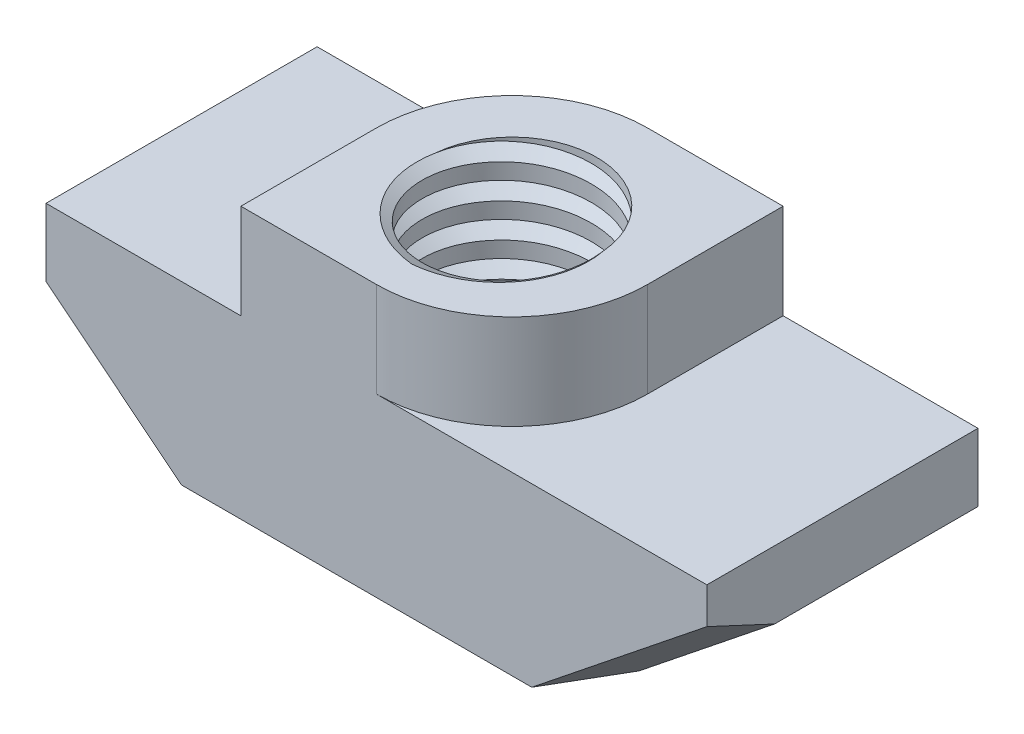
ISO-10303-21;
HEADER;
FILE_DESCRIPTION(('STEP AP214'),'2;1');
FILE_NAME('part.step','',(''),(''),'','','');
FILE_SCHEMA(('AUTOMOTIVE_DESIGN { 1 0 10303 214 1 1 1 1 }'));
ENDSEC;
DATA;
#1=APPLICATION_CONTEXT('core data for automotive mechanical design processes');
#2=APPLICATION_PROTOCOL_DEFINITION('international standard','automotive_design',2000,#1);
#3=PRODUCT_CONTEXT('',#1,'mechanical');
#4=PRODUCT('Part','Part','',(#3));
#5=PRODUCT_RELATED_PRODUCT_CATEGORY('part','',(#4));
#6=PRODUCT_DEFINITION_FORMATION('','',#4);
#7=PRODUCT_DEFINITION_CONTEXT('part definition',#1,'design');
#8=PRODUCT_DEFINITION('design','',#6,#7);
#9=PRODUCT_DEFINITION_SHAPE('','',#8);
#10=(LENGTH_UNIT() NAMED_UNIT(*) SI_UNIT(.MILLI.,.METRE.));
#11=(NAMED_UNIT(*) PLANE_ANGLE_UNIT() SI_UNIT($,.RADIAN.));
#12=(NAMED_UNIT(*) SI_UNIT($,.STERADIAN.) SOLID_ANGLE_UNIT());
#13=UNCERTAINTY_MEASURE_WITH_UNIT(LENGTH_MEASURE(1.E-05),#10,'distance_accuracy_value','');
#14=(GEOMETRIC_REPRESENTATION_CONTEXT(3) GLOBAL_UNCERTAINTY_ASSIGNED_CONTEXT((#13)) GLOBAL_UNIT_ASSIGNED_CONTEXT((#10,
#11,#12)) REPRESENTATION_CONTEXT('',''));
#15=CARTESIAN_POINT('',(0.,0.,0.));
#16=DIRECTION('',(0.,0.,1.));
#17=DIRECTION('',(1.,0.,0.));
#18=AXIS2_PLACEMENT_3D('',#15,#16,#17);
#19=CARTESIAN_POINT('',(-9.75,0.,4.));
#20=DIRECTION('',(0.,1.,0.));
#21=DIRECTION('',(-1.,0.,0.));
#22=AXIS2_PLACEMENT_3D('',#19,#20,#21);
#23=PLANE('',#22);
#24=DIRECTION('',(0.,0.,1.));
#25=VECTOR('',#24,1.);
#26=CARTESIAN_POINT('',(5.75,0.,-4.));
#27=LINE('',#26,#25);
#28=CARTESIAN_POINT('',(5.75,0.,-4.));
#29=VERTEX_POINT('',#28);
#30=CARTESIAN_POINT('',(5.75,0.,1.99999999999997));
#31=VERTEX_POINT('',#30);
#32=EDGE_CURVE('E356',#29,#31,#27,.T.);
#33=ORIENTED_EDGE('',*,*,#32,.T.);
#34=DIRECTION('',(0.50342182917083,0.,-0.864040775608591));
#35=VECTOR('',#34,1.);
#36=CARTESIAN_POINT('',(3.87623674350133,0.,5.21600646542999));
#37=LINE('',#36,#35);
#38=CARTESIAN_POINT('',(4.58472668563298,0.,4.));
#39=VERTEX_POINT('',#38);
#40=EDGE_CURVE('E297',#31,#39,#37,.F.);
#41=ORIENTED_EDGE('',*,*,#40,.T.);
#42=DIRECTION('',(1.,0.,0.));
#43=VECTOR('',#42,1.);
#44=CARTESIAN_POINT('',(-9.75,0.,4.));
#45=LINE('',#44,#43);
#46=CARTESIAN_POINT('',(-5.75,0.,4.));
#47=VERTEX_POINT('',#46);
#48=EDGE_CURVE('E362',#47,#39,#45,.T.);
#49=ORIENTED_EDGE('',*,*,#48,.F.);
#50=DIRECTION('',(0.,0.,1.));
#51=VECTOR('',#50,1.);
#52=CARTESIAN_POINT('',(-5.75,0.,-4.));
#53=LINE('',#52,#51);
#54=CARTESIAN_POINT('',(-5.75,0.,-1.99999999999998));
#55=VERTEX_POINT('',#54);
#56=EDGE_CURVE('E390',#55,#47,#53,.T.);
#57=ORIENTED_EDGE('',*,*,#56,.F.);
#58=DIRECTION('',(-0.50342182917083,0.,0.864040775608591));
#59=VECTOR('',#58,1.);
#60=CARTESIAN_POINT('',(-3.87623674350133,0.,-5.21600646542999));
#61=LINE('',#60,#59);
#62=CARTESIAN_POINT('',(-4.58472668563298,0.,-4.));
#63=VERTEX_POINT('',#62);
#64=EDGE_CURVE('E336',#55,#63,#61,.F.);
#65=ORIENTED_EDGE('',*,*,#64,.T.);
#66=DIRECTION('',(1.,0.,0.));
#67=VECTOR('',#66,1.);
#68=CARTESIAN_POINT('',(-9.75,0.,-4.));
#69=LINE('',#68,#67);
#70=EDGE_CURVE('E557',#63,#29,#69,.T.);
#71=ORIENTED_EDGE('',*,*,#70,.T.);
#72=EDGE_LOOP('',(#33,#41,#49,#57,#65,#71));
#73=FACE_BOUND('',#72,.T.);
#74=CARTESIAN_POINT('',(6.77779229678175E-09,0.,2.95672338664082));
#75=CARTESIAN_POINT('',(-0.0795968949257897,0.,2.94969654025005));
#76=CARTESIAN_POINT('',(-0.158894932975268,0.,2.93929690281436));
#77=CARTESIAN_POINT('',(-0.316328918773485,0.,2.91185932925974));
#78=CARTESIAN_POINT('',(-0.394464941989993,0.,2.89482182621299));
#79=CARTESIAN_POINT('',(-0.548931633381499,0.,2.85423835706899));
#80=CARTESIAN_POINT('',(-0.62526428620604,0.,2.8306999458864));
#81=CARTESIAN_POINT('',(-0.775674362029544,0.,2.77727236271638));
#82=CARTESIAN_POINT('',(-0.849751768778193,0.,2.7473831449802));
#83=CARTESIAN_POINT('',(-0.995110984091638,0.,2.68146809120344));
#84=CARTESIAN_POINT('',(-1.06639320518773,0.,2.64544316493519));
#85=CARTESIAN_POINT('',(-1.20566491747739,0.,2.56750930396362));
#86=CARTESIAN_POINT('',(-1.27365441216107,0.,2.52560037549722));
#87=CARTESIAN_POINT('',(-1.40587928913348,0.,2.43617846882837));
#88=CARTESIAN_POINT('',(-1.47011328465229,0.,2.38866343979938));
#89=CARTESIAN_POINT('',(-1.59435275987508,0.,2.28838141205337));
#90=CARTESIAN_POINT('',(-1.65435769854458,0.,2.23561374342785));
#91=CARTESIAN_POINT('',(-1.76971650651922,0.,2.1251638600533));
#92=CARTESIAN_POINT('',(-1.82506856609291,0.,2.06747975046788));
#93=CARTESIAN_POINT('',(-1.90432401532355,0.,1.97765669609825));
#94=CARTESIAN_POINT('',(-1.9301149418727,0.,1.94716456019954));
#95=CARTESIAN_POINT('',(-1.98029855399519,0.,1.88505028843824));
#96=CARTESIAN_POINT('',(-2.00469127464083,0.,1.85342818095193));
#97=CARTESIAN_POINT('',(-2.0756186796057,0.,1.75699334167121));
#98=CARTESIAN_POINT('',(-2.11996046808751,0.,1.69054684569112));
#99=CARTESIAN_POINT('',(-2.2024005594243,0.,1.55389598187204));
#100=CARTESIAN_POINT('',(-2.24049859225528,0.,1.48369145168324));
#101=CARTESIAN_POINT('',(-2.30839067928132,0.,1.34368459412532));
#102=CARTESIAN_POINT('',(-2.33850437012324,0.,1.27403720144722));
#103=CARTESIAN_POINT('',(-2.39257588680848,0.,1.1323933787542));
#104=CARTESIAN_POINT('',(-2.41653381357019,0.,1.06039698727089));
#105=CARTESIAN_POINT('',(-2.45813072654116,0.,0.914527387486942));
#106=CARTESIAN_POINT('',(-2.47576368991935,0.,0.840652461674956));
#107=CARTESIAN_POINT('',(-2.5045435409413,0.,0.691650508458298));
#108=CARTESIAN_POINT('',(-2.51569050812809,0.,0.616523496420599));
#109=CARTESIAN_POINT('',(-2.53119046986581,0.,0.467770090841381));
#110=CARTESIAN_POINT('',(-2.53573071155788,0.,0.394163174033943));
#111=CARTESIAN_POINT('',(-2.53857900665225,0.,0.246827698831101));
#112=CARTESIAN_POINT('',(-2.53688668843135,0.,0.173099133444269));
#113=CARTESIAN_POINT('',(-2.52733075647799,0.,0.0261146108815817));
#114=CARTESIAN_POINT('',(-2.51947402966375,0.,-0.0471417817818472));
#115=CARTESIAN_POINT('',(-2.49702201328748,0.,-0.192611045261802));
#116=CARTESIAN_POINT('',(-2.48242810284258,0.,-0.264824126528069));
#117=CARTESIAN_POINT('',(-2.44723819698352,0.,-0.40545615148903));
#118=CARTESIAN_POINT('',(-2.42683623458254,0.,-0.473923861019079));
#119=CARTESIAN_POINT('',(-2.38001120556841,0.,-0.608782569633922));
#120=CARTESIAN_POINT('',(-2.35358723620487,0.,-0.675173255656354));
#121=CARTESIAN_POINT('',(-2.29491072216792,0.,-0.805381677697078));
#122=CARTESIAN_POINT('',(-2.26265412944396,0.,-0.869197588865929));
#123=CARTESIAN_POINT('',(-2.19257740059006,0.,-0.993697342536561));
#124=CARTESIAN_POINT('',(-2.1547574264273,0.,-1.05438127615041));
#125=CARTESIAN_POINT('',(-2.0760622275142,0.,-1.16891872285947));
#126=CARTESIAN_POINT('',(-2.03546600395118,0.,-1.22296425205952));
#127=CARTESIAN_POINT('',(-1.94985495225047,0.,-1.32744940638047));
#128=CARTESIAN_POINT('',(-1.9048395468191,0.,-1.37788855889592));
#129=CARTESIAN_POINT('',(-1.81074396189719,0.,-1.4747407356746));
#130=CARTESIAN_POINT('',(-1.76166688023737,0.,-1.52115677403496));
#131=CARTESIAN_POINT('',(-1.65981483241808,0.,-1.60973164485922));
#132=CARTESIAN_POINT('',(-1.60704056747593,0.,-1.65189128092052));
#133=CARTESIAN_POINT('',(-1.49821971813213,0.,-1.73081668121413));
#134=CARTESIAN_POINT('',(-1.44220238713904,0.,-1.76762255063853));
#135=CARTESIAN_POINT('',(-1.32705646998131,0.,-1.83595093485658));
#136=CARTESIAN_POINT('',(-1.26792759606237,0.,-1.8674729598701));
#137=CARTESIAN_POINT('',(-1.08654120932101,0.,-1.95367319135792));
#138=CARTESIAN_POINT('',(-0.960190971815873,0.,-2.00005284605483));
#139=CARTESIAN_POINT('',(-0.71180017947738,0.,-2.06606255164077));
#140=CARTESIAN_POINT('',(-0.590241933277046,0.,-2.08755788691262));
#141=CARTESIAN_POINT('',(-0.345413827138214,0.,-2.10972831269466));
#142=CARTESIAN_POINT('',(-0.222148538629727,0.,-2.11045110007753));
#143=CARTESIAN_POINT('',(-0.066482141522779,0.,-2.09823790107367));
#144=CARTESIAN_POINT('',(-0.033185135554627,0.,-2.09485169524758));
#145=CARTESIAN_POINT('',(-4.79251163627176E-09,0.,-2.09069798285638));
#146=B_SPLINE_CURVE_WITH_KNOTS('',3,(#74,#75,#76,#77,#78,#79,#80,#81,#82,#83,#84,#85,#86,#87,
#88,#89,#90,#91,#92,#93,#94,#95,#96,#97,#98,#99,#100,#101,#102,#103,#104,#105,#106,#107,#108,
#109,#110,#111,#112,#113,#114,#115,#116,#117,#118,#119,#120,#121,#122,#123,#124,#125,#126,#127,
#128,#129,#130,#131,#132,#133,#134,#135,#136,#137,#138,#139,#140,#141,#142,#143,#144,#145),
.UNSPECIFIED.,.F.,.F.,(4,2,2,2,2,2,2,2,2,2,2,2,2,2,2,2,2,2,2,2,2,2,2,2,2,2,2,2,2,2,2,2,2,2,2,4),
(0.,0.239647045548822,0.479278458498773,0.718632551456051,0.957988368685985,1.19730872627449,
1.4366288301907,1.67603675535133,1.91547525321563,2.15500645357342,2.27478424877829,
2.39455903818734,2.63384798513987,2.873147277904,3.10049848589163,3.32784596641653,
3.55540936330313,3.78296996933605,4.00394625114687,4.22493570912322,4.44567862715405,
4.66637637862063,4.88042637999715,5.09450849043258,5.30873975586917,5.52296478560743,
5.72550991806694,5.9280815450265,6.13050007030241,6.33288030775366,6.533656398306,
6.73445108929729,7.13570127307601,7.50439044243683,7.8722329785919,7.97259954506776),.UNSPECIFIED.);
#147=CARTESIAN_POINT('',(6.77788311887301E-09,0.,2.95672338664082));
#148=VERTEX_POINT('',#147);
#149=CARTESIAN_POINT('',(-2.49006152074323,0.,-0.222696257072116));
#150=VERTEX_POINT('',#149);
#151=EDGE_CURVE('E162',#148,#150,#146,.T.);
#152=ORIENTED_EDGE('',*,*,#151,.F.);
#153=CARTESIAN_POINT('',(-4.7925113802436E-09,0.,-2.09069798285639));
#154=CARTESIAN_POINT('',(0.0609031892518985,0.,-2.09831212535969));
#155=CARTESIAN_POINT('',(0.122101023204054,0.,-2.10335326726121));
#156=CARTESIAN_POINT('',(0.244703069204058,0.,-2.10826762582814));
#157=CARTESIAN_POINT('',(0.306107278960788,0.,-2.10814089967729));
#158=CARTESIAN_POINT('',(0.489901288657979,0.,-2.09998312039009));
#159=CARTESIAN_POINT('',(0.612029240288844,0.,-2.08419391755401));
#160=CARTESIAN_POINT('',(0.851939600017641,0.,-2.03228877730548));
#161=CARTESIAN_POINT('',(0.969720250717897,0.,-1.99616471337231));
#162=CARTESIAN_POINT('',(1.14045541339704,0.,-1.92762804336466));
#163=CARTESIAN_POINT('',(1.19638273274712,0.,-1.90238772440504));
#164=CARTESIAN_POINT('',(1.30592341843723,0.,-1.84729377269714));
#165=CARTESIAN_POINT('',(1.35953710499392,0.,-1.81744078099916));
#166=CARTESIAN_POINT('',(1.4640284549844,0.,-1.75337110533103));
#167=CARTESIAN_POINT('',(1.51490833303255,0.,-1.71915803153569));
#168=CARTESIAN_POINT('',(1.61360732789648,0.,-1.64656855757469));
#169=CARTESIAN_POINT('',(1.66142595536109,0.,-1.60819149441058));
#170=CARTESIAN_POINT('',(1.75406914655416,0.,-1.52789202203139));
#171=CARTESIAN_POINT('',(1.7988905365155,0.,-1.48596595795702));
#172=CARTESIAN_POINT('',(1.88517411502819,0.,-1.39880723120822));
#173=CARTESIAN_POINT('',(1.92663643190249,0.,-1.35357469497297));
#174=CARTESIAN_POINT('',(2.05051968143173,0.,-1.20754512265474));
#175=CARTESIAN_POINT('',(2.12670916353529,0.,-1.10133909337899));
#176=CARTESIAN_POINT('',(2.26077087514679,0.,-0.878065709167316));
#177=CARTESIAN_POINT('',(2.31865859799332,0.,-0.761007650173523));
#178=CARTESIAN_POINT('',(2.39157008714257,0.,-0.577468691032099));
#179=CARTESIAN_POINT('',(2.41381273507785,0.,-0.513770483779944));
#180=CARTESIAN_POINT('',(2.4528678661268,0.,-0.384724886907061));
#181=CARTESIAN_POINT('',(2.46968091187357,0.,-0.319377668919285));
#182=CARTESIAN_POINT('',(2.4977799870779,0.,-0.187444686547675));
#183=CARTESIAN_POINT('',(2.50906155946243,0.,-0.120857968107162));
#184=CARTESIAN_POINT('',(2.52173673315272,0.,-0.0204581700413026));
#185=CARTESIAN_POINT('',(2.52525411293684,0.,0.0130995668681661));
#186=CARTESIAN_POINT('',(2.53099785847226,0.,0.0803310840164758));
#187=CARTESIAN_POINT('',(2.53322395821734,0.,0.114004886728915));
#188=CARTESIAN_POINT('',(2.53798895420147,0.,0.216068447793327));
#189=CARTESIAN_POINT('',(2.53849763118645,0.,0.284566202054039));
#190=CARTESIAN_POINT('',(2.53415072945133,0.,0.42138747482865));
#191=CARTESIAN_POINT('',(2.52929374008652,0.,0.489710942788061));
#192=CARTESIAN_POINT('',(2.50670449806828,0.,0.693737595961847));
#193=CARTESIAN_POINT('',(2.48096023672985,0.,0.828633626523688));
#194=CARTESIAN_POINT('',(2.40594608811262,0.,1.10268082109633));
#195=CARTESIAN_POINT('',(2.35505681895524,0.,1.24139251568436));
#196=CARTESIAN_POINT('',(2.26191187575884,0.,1.44145231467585));
#197=CARTESIAN_POINT('',(2.22804374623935,0.,1.50683037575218));
#198=CARTESIAN_POINT('',(2.15491587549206,0.,1.63452854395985));
#199=CARTESIAN_POINT('',(2.11565638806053,0.,1.6968487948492));
#200=CARTESIAN_POINT('',(2.05298577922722,0.,1.78764069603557));
#201=CARTESIAN_POINT('',(2.0314753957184,0.,1.81744435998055));
#202=CARTESIAN_POINT('',(1.98721124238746,0.,1.8761165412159));
#203=CARTESIAN_POINT('',(1.96445748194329,0.,1.90498506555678));
#204=CARTESIAN_POINT('',(1.91780020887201,0.,1.96176609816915));
#205=CARTESIAN_POINT('',(1.89389692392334,0.,1.98967879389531));
#206=CARTESIAN_POINT('',(1.84503855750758,0.,2.04456563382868));
#207=CARTESIAN_POINT('',(1.82008344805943,0.,2.07153975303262));
#208=CARTESIAN_POINT('',(1.74363143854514,0.,2.15101204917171));
#209=CARTESIAN_POINT('',(1.69057360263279,0.,2.20202885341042));
#210=CARTESIAN_POINT('',(1.58068275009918,0.,2.29976745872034));
#211=CARTESIAN_POINT('',(1.5238500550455,0.,2.34648962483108));
#212=CARTESIAN_POINT('',(1.34095613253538,0.,2.48525616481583));
#213=CARTESIAN_POINT('',(1.2087264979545,0.,2.56937486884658));
#214=CARTESIAN_POINT('',(0.932362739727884,0.,2.7146219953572));
#215=CARTESIAN_POINT('',(0.788237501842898,0.,2.77576739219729));
#216=CARTESIAN_POINT('',(0.536403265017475,0.,2.85889915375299));
#217=CARTESIAN_POINT('',(0.430714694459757,0.,2.88712884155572));
#218=CARTESIAN_POINT('',(0.216881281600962,0.,2.9312411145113));
#219=CARTESIAN_POINT('',(0.108738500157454,0.,2.94713369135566));
#220=CARTESIAN_POINT('',(6.77779161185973E-09,0.,2.95672338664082));
#221=B_SPLINE_CURVE_WITH_KNOTS('',3,(#153,#154,#155,#156,#157,#158,#159,#160,#161,#162,#163,
#164,#165,#166,#167,#168,#169,#170,#171,#172,#173,#174,#175,#176,#177,#178,#179,#180,#181,#182,
#183,#184,#185,#186,#187,#188,#189,#190,#191,#192,#193,#194,#195,#196,#197,#198,#199,#200,#201,
#202,#203,#204,#205,#206,#207,#208,#209,#210,#211,#212,#213,#214,#215,#216,#217,#218,#219,#220),
.UNSPECIFIED.,.F.,.F.,(4,2,2,2,2,2,2,2,2,2,2,2,2,2,2,2,2,2,2,2,2,2,2,2,2,2,2,2,2,2,2,2,2,4),(0.,
0.184023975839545,0.368045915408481,0.735621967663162,1.10334502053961,1.28724058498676,
1.47111061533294,1.6548293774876,1.83857743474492,2.022517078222,2.20644969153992,
2.59672209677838,2.98666322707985,3.18886909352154,3.39105400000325,3.59340155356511,
3.69460237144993,3.7958240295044,4.00108416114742,4.20639826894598,4.61662081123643,
5.05760527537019,5.27828519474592,5.4989547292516,5.60919484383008,5.71943412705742,
5.8296516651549,5.9398721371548,6.16043437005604,6.38097783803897,6.84882056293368,
7.3163169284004,7.64380729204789,7.97103214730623),.UNSPECIFIED.);
#222=CARTESIAN_POINT('',(2.49006152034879,0.,-0.222696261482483));
#223=VERTEX_POINT('',#222);
#224=EDGE_CURVE('E163',#223,#148,#221,.T.);
#225=ORIENTED_EDGE('',*,*,#224,.F.);
#226=CARTESIAN_POINT('',(0.,0.,0.));
#227=DIRECTION('',(0.,1.,0.));
#228=DIRECTION('',(0.,0.,1.));
#229=AXIS2_PLACEMENT_3D('',#226,#227,#228);
#230=CIRCLE('',#229,2.5);
#231=EDGE_CURVE('E235',#223,#150,#230,.T.);
#232=ORIENTED_EDGE('',*,*,#231,.T.);
#233=EDGE_LOOP('',(#152,#225,#232));
#234=FACE_BOUND('',#233,.T.);
#235=ADVANCED_FACE('F33',(#73,#234),#23,.F.);
#236=CARTESIAN_POINT('',(0.,8.,0.));
#237=DIRECTION('',(0.,1.,0.));
#238=DIRECTION('',(0.,0.,1.));
#239=AXIS2_PLACEMENT_3D('',#236,#237,#238);
#240=PLANE('',#239);
#241=CARTESIAN_POINT('',(0.,8.,0.));
#242=DIRECTION('',(0.,1.,0.));
#243=DIRECTION('',(0.,0.,1.));
#244=AXIS2_PLACEMENT_3D('',#241,#242,#243);
#245=CIRCLE('',#244,4.);
#246=CARTESIAN_POINT('',(0.,8.,-4.));
#247=VERTEX_POINT('',#246);
#248=CARTESIAN_POINT('',(-4.,8.,0.));
#249=VERTEX_POINT('',#248);
#250=EDGE_CURVE('E240',#247,#249,#245,.T.);
#251=ORIENTED_EDGE('',*,*,#250,.T.);
#252=DIRECTION('',(0.,0.,1.));
#253=VECTOR('',#252,1.);
#254=CARTESIAN_POINT('',(-4.,8.,0.));
#255=LINE('',#254,#253);
#256=CARTESIAN_POINT('',(-4.,8.,4.));
#257=VERTEX_POINT('',#256);
#258=EDGE_CURVE('E243',#249,#257,#255,.T.);
#259=ORIENTED_EDGE('',*,*,#258,.T.);
#260=DIRECTION('',(1.,0.,0.));
#261=VECTOR('',#260,1.);
#262=CARTESIAN_POINT('',(-4.,8.,4.));
#263=LINE('',#262,#261);
#264=CARTESIAN_POINT('',(0.,8.,4.));
#265=VERTEX_POINT('',#264);
#266=EDGE_CURVE('E245',#257,#265,#263,.T.);
#267=ORIENTED_EDGE('',*,*,#266,.T.);
#268=CARTESIAN_POINT('',(0.,8.,0.));
#269=DIRECTION('',(0.,1.,0.));
#270=DIRECTION('',(0.,0.,1.));
#271=AXIS2_PLACEMENT_3D('',#268,#269,#270);
#272=CIRCLE('',#271,4.);
#273=CARTESIAN_POINT('',(4.,8.,0.));
#274=VERTEX_POINT('',#273);
#275=EDGE_CURVE('E247',#265,#274,#272,.T.);
#276=ORIENTED_EDGE('',*,*,#275,.T.);
#277=DIRECTION('',(0.,0.,-1.));
#278=VECTOR('',#277,1.);
#279=CARTESIAN_POINT('',(4.,8.,-4.));
#280=LINE('',#279,#278);
#281=CARTESIAN_POINT('',(4.,8.,-4.));
#282=VERTEX_POINT('',#281);
#283=EDGE_CURVE('E249',#274,#282,#280,.T.);
#284=ORIENTED_EDGE('',*,*,#283,.T.);
#285=DIRECTION('',(-1.,0.,0.));
#286=VECTOR('',#285,1.);
#287=CARTESIAN_POINT('',(0.,8.,-4.));
#288=LINE('',#287,#286);
#289=EDGE_CURVE('E251',#282,#247,#288,.T.);
#290=ORIENTED_EDGE('',*,*,#289,.T.);
#291=EDGE_LOOP('',(#251,#259,#267,#276,#284,#290));
#292=FACE_BOUND('',#291,.T.);
#293=CARTESIAN_POINT('',(-4.79274441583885E-09,8.,-2.09069798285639));
#294=CARTESIAN_POINT('',(0.0609031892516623,8.,-2.0983121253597));
#295=CARTESIAN_POINT('',(0.122101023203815,8.,-2.10335326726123));
#296=CARTESIAN_POINT('',(0.244703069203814,8.,-2.10826762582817));
#297=CARTESIAN_POINT('',(0.306107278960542,8.,-2.10814089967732));
#298=CARTESIAN_POINT('',(0.489901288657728,8.,-2.09998312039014));
#299=CARTESIAN_POINT('',(0.612029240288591,8.,-2.08419391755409));
#300=CARTESIAN_POINT('',(0.85193960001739,8.,-2.03228877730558));
#301=CARTESIAN_POINT('',(0.96972025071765,8.00000000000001,-1.99616471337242));
#302=CARTESIAN_POINT('',(1.1404554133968,8.,-1.92762804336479));
#303=CARTESIAN_POINT('',(1.19638273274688,7.99999999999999,-1.90238772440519));
#304=CARTESIAN_POINT('',(1.305923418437,8.00000000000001,-1.8472937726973));
#305=CARTESIAN_POINT('',(1.3595371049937,8.00000000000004,-1.81744078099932));
#306=CARTESIAN_POINT('',(1.46402845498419,8.00000000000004,-1.7533711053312));
#307=CARTESIAN_POINT('',(1.51490833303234,8.00000000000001,-1.71915803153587));
#308=CARTESIAN_POINT('',(1.61360732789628,7.99999999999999,-1.64656855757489));
#309=CARTESIAN_POINT('',(1.66142595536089,7.99999999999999,-1.60819149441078));
#310=CARTESIAN_POINT('',(1.75406914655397,8.00000000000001,-1.5278920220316));
#311=CARTESIAN_POINT('',(1.79889053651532,8.00000000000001,-1.48596595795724));
#312=CARTESIAN_POINT('',(1.88517411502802,7.99999999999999,-1.39880723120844));
#313=CARTESIAN_POINT('',(1.92663643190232,7.99999999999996,-1.3535746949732));
#314=CARTESIAN_POINT('',(2.05051968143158,7.99999999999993,-1.20754512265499));
#315=CARTESIAN_POINT('',(2.12670916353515,7.99999999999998,-1.10133909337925));
#316=CARTESIAN_POINT('',(2.26077087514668,8.00000000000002,-0.878065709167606));
#317=CARTESIAN_POINT('',(2.31865859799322,8.,-0.761007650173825));
#318=CARTESIAN_POINT('',(2.39157008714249,8.,-0.577468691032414));
#319=CARTESIAN_POINT('',(2.41381273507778,8.,-0.513770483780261));
#320=CARTESIAN_POINT('',(2.45286786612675,8.,-0.384724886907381));
#321=CARTESIAN_POINT('',(2.46968091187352,8.,-0.319377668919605));
#322=CARTESIAN_POINT('',(2.49777998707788,8.,-0.187444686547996));
#323=CARTESIAN_POINT('',(2.50906155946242,8.,-0.120857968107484));
#324=CARTESIAN_POINT('',(2.52173673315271,8.,-0.0204581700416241));
#325=CARTESIAN_POINT('',(2.52525411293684,8.,0.0130995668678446));
#326=CARTESIAN_POINT('',(2.53099785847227,8.,0.0803310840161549));
#327=CARTESIAN_POINT('',(2.53322395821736,8.,0.114004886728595));
#328=CARTESIAN_POINT('',(2.5379889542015,8.00000000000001,0.216068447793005));
#329=CARTESIAN_POINT('',(2.53849763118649,8.,0.284566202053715));
#330=CARTESIAN_POINT('',(2.53415072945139,8.,0.421387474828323));
#331=CARTESIAN_POINT('',(2.52929374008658,8.,0.489710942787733));
#332=CARTESIAN_POINT('',(2.50670449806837,8.,0.693737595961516));
#333=CARTESIAN_POINT('',(2.48096023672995,8.,0.828633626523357));
#334=CARTESIAN_POINT('',(2.40594608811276,8.,1.10268082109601));
#335=CARTESIAN_POINT('',(2.3550568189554,8.,1.24139251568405));
#336=CARTESIAN_POINT('',(2.26191187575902,8.,1.44145231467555));
#337=CARTESIAN_POINT('',(2.22804374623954,8.,1.50683037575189));
#338=CARTESIAN_POINT('',(2.15491587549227,8.,1.63452854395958));
#339=CARTESIAN_POINT('',(2.11565638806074,8.,1.69684879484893));
#340=CARTESIAN_POINT('',(2.05298577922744,8.,1.78764069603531));
#341=CARTESIAN_POINT('',(2.03147539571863,8.,1.81744435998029));
#342=CARTESIAN_POINT('',(1.9872112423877,8.,1.87611654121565));
#343=CARTESIAN_POINT('',(1.96445748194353,8.,1.90498506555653));
#344=CARTESIAN_POINT('',(1.91780020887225,8.,1.96176609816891));
#345=CARTESIAN_POINT('',(1.89389692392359,8.,1.98967879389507));
#346=CARTESIAN_POINT('',(1.84503855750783,8.,2.04456563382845));
#347=CARTESIAN_POINT('',(1.82008344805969,8.,2.0715397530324));
#348=CARTESIAN_POINT('',(1.74363143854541,8.,2.1510120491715));
#349=CARTESIAN_POINT('',(1.69057360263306,8.,2.20202885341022));
#350=CARTESIAN_POINT('',(1.58068275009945,8.,2.29976745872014));
#351=CARTESIAN_POINT('',(1.52385005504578,8.,2.34648962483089));
#352=CARTESIAN_POINT('',(1.34095613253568,8.,2.48525616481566));
#353=CARTESIAN_POINT('',(1.20872649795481,8.,2.56937486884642));
#354=CARTESIAN_POINT('',(0.932362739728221,8.,2.71462199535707));
#355=CARTESIAN_POINT('',(0.788237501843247,8.,2.77576739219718));
#356=CARTESIAN_POINT('',(0.536403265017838,8.,2.85889915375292));
#357=CARTESIAN_POINT('',(0.430714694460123,8.,2.88712884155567));
#358=CARTESIAN_POINT('',(0.216881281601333,8.,2.93124111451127));
#359=CARTESIAN_POINT('',(0.108738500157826,8.,2.94713369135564));
#360=CARTESIAN_POINT('',(6.7781634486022E-09,8.,2.95672338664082));
#361=B_SPLINE_CURVE_WITH_KNOTS('',3,(#293,#294,#295,#296,#297,#298,#299,#300,#301,#302,#303,
#304,#305,#306,#307,#308,#309,#310,#311,#312,#313,#314,#315,#316,#317,#318,#319,#320,#321,#322,
#323,#324,#325,#326,#327,#328,#329,#330,#331,#332,#333,#334,#335,#336,#337,#338,#339,#340,#341,
#342,#343,#344,#345,#346,#347,#348,#349,#350,#351,#352,#353,#354,#355,#356,#357,#358,#359,#360),
.UNSPECIFIED.,.F.,.F.,(4,2,2,2,2,2,2,2,2,2,2,2,2,2,2,2,2,2,2,2,2,2,2,2,2,2,2,2,2,2,2,2,2,4),(0.,
0.184023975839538,0.368045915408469,0.735621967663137,1.10334502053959,1.28724058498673,
1.47111061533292,1.65482937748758,1.8385774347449,2.02251707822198,2.2064496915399,
2.59672209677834,2.9866632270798,3.18886909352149,3.39105400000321,3.59340155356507,
3.69460237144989,3.79582402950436,4.00108416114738,4.20639826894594,4.61662081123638,
5.05760527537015,5.27828519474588,5.49895472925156,5.60919484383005,5.71943412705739,
5.82965166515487,5.93987213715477,6.16043437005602,6.38097783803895,6.84882056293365,
7.31631692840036,7.64380729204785,7.9710321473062),.UNSPECIFIED.);
#362=CARTESIAN_POINT('',(2.49006152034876,8.,-0.222696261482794));
#363=VERTEX_POINT('',#362);
#364=CARTESIAN_POINT('',(6.77822437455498E-09,8.,2.95672338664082));
#365=VERTEX_POINT('',#364);
#366=EDGE_CURVE('E50',#363,#365,#361,.T.);
#367=ORIENTED_EDGE('',*,*,#366,.T.);
#368=CARTESIAN_POINT('',(6.77816538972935E-09,8.,2.95672338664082));
#369=CARTESIAN_POINT('',(-0.0795968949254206,8.,2.94969654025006));
#370=CARTESIAN_POINT('',(-0.158894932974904,8.,2.93929690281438));
#371=CARTESIAN_POINT('',(-0.31632891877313,8.,2.91185932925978));
#372=CARTESIAN_POINT('',(-0.394464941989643,8.,2.89482182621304));
#373=CARTESIAN_POINT('',(-0.54893163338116,8.,2.85423835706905));
#374=CARTESIAN_POINT('',(-0.625264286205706,8.,2.83069994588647));
#375=CARTESIAN_POINT('',(-0.775674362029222,8.,2.77727236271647));
#376=CARTESIAN_POINT('',(-0.849751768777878,8.,2.7473831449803));
#377=CARTESIAN_POINT('',(-0.995110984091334,8.,2.68146809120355));
#378=CARTESIAN_POINT('',(-1.06639320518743,8.,2.64544316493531));
#379=CARTESIAN_POINT('',(-1.2056649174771,8.,2.56750930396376));
#380=CARTESIAN_POINT('',(-1.27365441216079,8.,2.52560037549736));
#381=CARTESIAN_POINT('',(-1.40587928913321,8.,2.43617846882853));
#382=CARTESIAN_POINT('',(-1.47011328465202,8.,2.38866343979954));
#383=CARTESIAN_POINT('',(-1.59435275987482,8.,2.28838141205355));
#384=CARTESIAN_POINT('',(-1.65435769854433,8.,2.23561374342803));
#385=CARTESIAN_POINT('',(-1.76971650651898,8.,2.12516386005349));
#386=CARTESIAN_POINT('',(-1.82506856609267,8.,2.06747975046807));
#387=CARTESIAN_POINT('',(-1.90432401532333,8.,1.97765669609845));
#388=CARTESIAN_POINT('',(-1.93011494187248,8.,1.94716456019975));
#389=CARTESIAN_POINT('',(-1.98029855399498,8.,1.88505028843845));
#390=CARTESIAN_POINT('',(-2.00469127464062,8.,1.85342818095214));
#391=CARTESIAN_POINT('',(-2.0756186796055,8.,1.75699334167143));
#392=CARTESIAN_POINT('',(-2.11996046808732,8.,1.69054684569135));
#393=CARTESIAN_POINT('',(-2.20240055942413,8.,1.55389598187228));
#394=CARTESIAN_POINT('',(-2.24049859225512,8.,1.48369145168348));
#395=CARTESIAN_POINT('',(-2.30839067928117,8.,1.34368459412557));
#396=CARTESIAN_POINT('',(-2.3385043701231,8.,1.27403720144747));
#397=CARTESIAN_POINT('',(-2.39257588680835,8.,1.13239337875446));
#398=CARTESIAN_POINT('',(-2.41653381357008,8.,1.06039698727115));
#399=CARTESIAN_POINT('',(-2.45813072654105,8.,0.914527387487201));
#400=CARTESIAN_POINT('',(-2.47576368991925,8.,0.840652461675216));
#401=CARTESIAN_POINT('',(-2.50454354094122,8.,0.691650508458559));
#402=CARTESIAN_POINT('',(-2.51569050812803,8.,0.616523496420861));
#403=CARTESIAN_POINT('',(-2.53119046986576,8.,0.467770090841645));
#404=CARTESIAN_POINT('',(-2.53573071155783,8.,0.394163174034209));
#405=CARTESIAN_POINT('',(-2.53857900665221,8.,0.246827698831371));
#406=CARTESIAN_POINT('',(-2.53688668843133,8.,0.17309913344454));
#407=CARTESIAN_POINT('',(-2.52733075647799,8.,0.0261146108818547));
#408=CARTESIAN_POINT('',(-2.51947402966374,8.,-0.0471417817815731));
#409=CARTESIAN_POINT('',(-2.49702201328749,8.,-0.192611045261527));
#410=CARTESIAN_POINT('',(-2.4824281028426,8.,-0.264824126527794));
#411=CARTESIAN_POINT('',(-2.44723819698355,8.,-0.40545615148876));
#412=CARTESIAN_POINT('',(-2.42683623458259,8.,-0.473923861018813));
#413=CARTESIAN_POINT('',(-2.38001120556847,8.,-0.608782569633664));
#414=CARTESIAN_POINT('',(-2.35358723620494,8.,-0.6751732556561));
#415=CARTESIAN_POINT('',(-2.294910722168,8.,-0.805381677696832));
#416=CARTESIAN_POINT('',(-2.26265412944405,8.,-0.869197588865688));
#417=CARTESIAN_POINT('',(-2.19257740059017,8.,-0.99369734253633));
#418=CARTESIAN_POINT('',(-2.15475742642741,8.,-1.05438127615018));
#419=CARTESIAN_POINT('',(-2.07606222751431,8.,-1.16891872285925));
#420=CARTESIAN_POINT('',(-2.0354660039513,8.,-1.22296425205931));
#421=CARTESIAN_POINT('',(-1.9498549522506,8.,-1.32744940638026));
#422=CARTESIAN_POINT('',(-1.90483954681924,8.,-1.37788855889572));
#423=CARTESIAN_POINT('',(-1.81074396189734,8.,-1.47474073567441));
#424=CARTESIAN_POINT('',(-1.76166688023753,8.,-1.52115677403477));
#425=CARTESIAN_POINT('',(-1.65981483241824,8.,-1.60973164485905));
#426=CARTESIAN_POINT('',(-1.6070405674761,8.,-1.65189128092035));
#427=CARTESIAN_POINT('',(-1.49821971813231,8.,-1.73081668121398));
#428=CARTESIAN_POINT('',(-1.44220238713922,8.,-1.76762255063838));
#429=CARTESIAN_POINT('',(-1.32705646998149,8.,-1.83595093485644));
#430=CARTESIAN_POINT('',(-1.26792759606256,8.,-1.86747295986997));
#431=CARTESIAN_POINT('',(-1.0865412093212,8.,-1.95367319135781));
#432=CARTESIAN_POINT('',(-0.960190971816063,8.,-2.00005284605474));
#433=CARTESIAN_POINT('',(-0.711800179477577,8.,-2.0660625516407));
#434=CARTESIAN_POINT('',(-0.59024193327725,8.,-2.08755788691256));
#435=CARTESIAN_POINT('',(-0.345413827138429,8.,-2.10972831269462));
#436=CARTESIAN_POINT('',(-0.222148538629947,8.,-2.1104511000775));
#437=CARTESIAN_POINT('',(-0.0664821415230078,8.,-2.09823790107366));
#438=CARTESIAN_POINT('',(-0.0331851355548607,8.,-2.09485169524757));
#439=CARTESIAN_POINT('',(-4.792750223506E-09,8.,-2.09069798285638));
#440=B_SPLINE_CURVE_WITH_KNOTS('',3,(#368,#369,#370,#371,#372,#373,#374,#375,#376,#377,#378,
#379,#380,#381,#382,#383,#384,#385,#386,#387,#388,#389,#390,#391,#392,#393,#394,#395,#396,#397,
#398,#399,#400,#401,#402,#403,#404,#405,#406,#407,#408,#409,#410,#411,#412,#413,#414,#415,#416,
#417,#418,#419,#420,#421,#422,#423,#424,#425,#426,#427,#428,#429,#430,#431,#432,#433,#434,#435,
#436,#437,#438,#439),.UNSPECIFIED.,.F.,.F.,(4,2,2,2,2,2,2,2,2,2,2,2,2,2,2,2,2,2,2,2,2,2,2,2,2,2,
2,2,2,2,2,2,2,2,2,4),(0.,0.239647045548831,0.479278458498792,0.718632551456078,
0.957988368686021,1.19730872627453,1.43662883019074,1.67603675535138,1.91547525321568,
2.15500645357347,2.27478424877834,2.39455903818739,2.63384798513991,2.87314727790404,
3.10049848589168,3.32784596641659,3.55540936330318,3.78296996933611,4.00394625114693,
4.22493570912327,4.4456786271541,4.66637637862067,4.88042637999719,5.09450849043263,
5.30873975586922,5.52296478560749,5.72550991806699,5.92808154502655,6.13050007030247,
6.33288030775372,6.53365639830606,6.73445108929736,7.13570127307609,7.50439044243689,
7.87223297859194,7.97259954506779),.UNSPECIFIED.);
#441=CARTESIAN_POINT('',(-2.49006152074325,8.,-0.222696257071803));
#442=VERTEX_POINT('',#441);
#443=EDGE_CURVE('E154',#365,#442,#440,.T.);
#444=ORIENTED_EDGE('',*,*,#443,.T.);
#445=CARTESIAN_POINT('',(0.,8.,0.));
#446=DIRECTION('',(0.,1.,0.));
#447=DIRECTION('',(0.,0.,1.));
#448=AXIS2_PLACEMENT_3D('',#445,#446,#447);
#449=CIRCLE('',#448,2.5);
#450=EDGE_CURVE('E169',#363,#442,#449,.T.);
#451=ORIENTED_EDGE('',*,*,#450,.F.);
#452=EDGE_LOOP('',(#367,#444,#451));
#453=FACE_BOUND('',#452,.T.);
#454=ADVANCED_FACE('F168',(#292,#453),#240,.T.);
#455=CARTESIAN_POINT('',(0.,0.,0.));
#456=DIRECTION('',(0.,1.,0.));
#457=DIRECTION('',(0.,0.,1.));
#458=AXIS2_PLACEMENT_3D('',#455,#456,#457);
#459=CYLINDRICAL_SURFACE('',#458,2.5);
#460=CARTESIAN_POINT('',(-1.76776687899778,8.88868936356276,-1.76776702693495));
#461=CARTESIAN_POINT('',(-1.03553380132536,8.82618936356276,-2.50000004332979));
#462=CARTESIAN_POINT('',(1.04607373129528E-07,8.76368936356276,-2.5));
#463=CARTESIAN_POINT('',(1.03553401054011,8.70118936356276,-2.49999995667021));
#464=CARTESIAN_POINT('',(1.76776702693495,8.63868936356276,-1.76776687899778));
#465=CARTESIAN_POINT('',(2.50000004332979,8.57618936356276,-1.03553380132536));
#466=CARTESIAN_POINT('',(2.5,8.51368936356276,1.04607373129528E-07));
#467=CARTESIAN_POINT('',(2.49999995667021,8.45118936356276,1.03553401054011));
#468=CARTESIAN_POINT('',(1.76776687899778,8.38868936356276,1.76776702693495));
#469=CARTESIAN_POINT('',(1.03553380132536,8.32618936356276,2.50000004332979));
#470=CARTESIAN_POINT('',(-1.04607372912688E-07,8.26368936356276,2.5));
#471=CARTESIAN_POINT('',(-1.03553401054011,8.20118936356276,2.49999995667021));
#472=CARTESIAN_POINT('',(-1.76776702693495,8.13868936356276,1.76776687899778));
#473=CARTESIAN_POINT('',(-2.50000004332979,8.07618936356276,1.03553380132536));
#474=CARTESIAN_POINT('',(-2.5,8.01368936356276,-1.04607372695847E-07));
#475=CARTESIAN_POINT('',(-2.49999995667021,7.95118936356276,-1.03553401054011));
#476=CARTESIAN_POINT('',(-1.76776687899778,7.88868936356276,-1.76776702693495));
#477=CARTESIAN_POINT('',(-1.03553380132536,7.82618936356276,-2.50000004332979));
#478=CARTESIAN_POINT('',(1.04607373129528E-07,7.76368936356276,-2.5));
#479=CARTESIAN_POINT('',(1.03553401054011,7.70118936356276,-2.49999995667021));
#480=CARTESIAN_POINT('',(1.76776702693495,7.63868936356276,-1.76776687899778));
#481=CARTESIAN_POINT('',(2.50000004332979,7.57618936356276,-1.03553380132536));
#482=CARTESIAN_POINT('',(2.5,7.51368936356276,1.04607373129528E-07));
#483=CARTESIAN_POINT('',(2.49999995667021,7.45118936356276,1.03553401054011));
#484=CARTESIAN_POINT('',(1.76776687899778,7.38868936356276,1.76776702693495));
#485=CARTESIAN_POINT('',(1.03553380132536,7.32618936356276,2.50000004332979));
#486=CARTESIAN_POINT('',(-1.04607372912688E-07,7.26368936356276,2.5));
#487=CARTESIAN_POINT('',(-1.03553401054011,7.20118936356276,2.49999995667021));
#488=CARTESIAN_POINT('',(-1.76776702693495,7.13868936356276,1.76776687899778));
#489=CARTESIAN_POINT('',(-2.50000004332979,7.07618936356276,1.03553380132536));
#490=CARTESIAN_POINT('',(-2.5,7.01368936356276,-1.04607372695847E-07));
#491=CARTESIAN_POINT('',(-2.49999995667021,6.95118936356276,-1.03553401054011));
#492=CARTESIAN_POINT('',(-1.76776687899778,6.88868936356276,-1.76776702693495));
#493=CARTESIAN_POINT('',(-1.03553380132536,6.82618936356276,-2.50000004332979));
#494=CARTESIAN_POINT('',(1.04607373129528E-07,6.76368936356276,-2.5));
#495=CARTESIAN_POINT('',(1.03553401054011,6.70118936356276,-2.49999995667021));
#496=CARTESIAN_POINT('',(1.76776702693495,6.63868936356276,-1.76776687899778));
#497=CARTESIAN_POINT('',(2.50000004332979,6.57618936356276,-1.03553380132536));
#498=CARTESIAN_POINT('',(2.5,6.51368936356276,1.04607373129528E-07));
#499=CARTESIAN_POINT('',(2.49999995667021,6.45118936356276,1.03553401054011));
#500=CARTESIAN_POINT('',(1.76776687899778,6.38868936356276,1.76776702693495));
#501=CARTESIAN_POINT('',(1.03553380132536,6.32618936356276,2.50000004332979));
#502=CARTESIAN_POINT('',(-1.04607372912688E-07,6.26368936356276,2.5));
#503=CARTESIAN_POINT('',(-1.03553401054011,6.20118936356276,2.49999995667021));
#504=CARTESIAN_POINT('',(-1.76776702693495,6.13868936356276,1.76776687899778));
#505=CARTESIAN_POINT('',(-2.50000004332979,6.07618936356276,1.03553380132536));
#506=CARTESIAN_POINT('',(-2.5,6.01368936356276,-1.04607372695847E-07));
#507=CARTESIAN_POINT('',(-2.49999995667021,5.95118936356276,-1.03553401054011));
#508=CARTESIAN_POINT('',(-1.76776687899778,5.88868936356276,-1.76776702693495));
#509=CARTESIAN_POINT('',(-1.03553380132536,5.82618936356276,-2.50000004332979));
#510=CARTESIAN_POINT('',(1.04607373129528E-07,5.76368936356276,-2.5));
#511=CARTESIAN_POINT('',(1.03553401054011,5.70118936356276,-2.49999995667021));
#512=CARTESIAN_POINT('',(1.76776702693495,5.63868936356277,-1.76776687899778));
#513=CARTESIAN_POINT('',(2.50000004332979,5.57618936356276,-1.03553380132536));
#514=CARTESIAN_POINT('',(2.5,5.51368936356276,1.04607373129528E-07));
#515=CARTESIAN_POINT('',(2.49999995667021,5.45118936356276,1.03553401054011));
#516=CARTESIAN_POINT('',(1.76776687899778,5.38868936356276,1.76776702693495));
#517=CARTESIAN_POINT('',(1.03553380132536,5.32618936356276,2.50000004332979));
#518=CARTESIAN_POINT('',(-1.04607372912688E-07,5.26368936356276,2.5));
#519=CARTESIAN_POINT('',(-1.03553401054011,5.20118936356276,2.49999995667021));
#520=CARTESIAN_POINT('',(-1.76776702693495,5.13868936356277,1.76776687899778));
#521=CARTESIAN_POINT('',(-2.50000004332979,5.07618936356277,1.03553380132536));
#522=CARTESIAN_POINT('',(-2.5,5.01368936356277,-1.04607372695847E-07));
#523=CARTESIAN_POINT('',(-2.49999995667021,4.95118936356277,-1.03553401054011));
#524=CARTESIAN_POINT('',(-1.76776687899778,4.88868936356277,-1.76776702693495));
#525=CARTESIAN_POINT('',(-1.03553380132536,4.82618936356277,-2.50000004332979));
#526=CARTESIAN_POINT('',(1.04607373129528E-07,4.76368936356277,-2.5));
#527=CARTESIAN_POINT('',(1.03553401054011,4.70118936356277,-2.49999995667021));
#528=CARTESIAN_POINT('',(1.76776702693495,4.63868936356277,-1.76776687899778));
#529=CARTESIAN_POINT('',(2.50000004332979,4.57618936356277,-1.03553380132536));
#530=CARTESIAN_POINT('',(2.5,4.51368936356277,1.04607373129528E-07));
#531=CARTESIAN_POINT('',(2.49999995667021,4.45118936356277,1.03553401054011));
#532=CARTESIAN_POINT('',(1.76776687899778,4.38868936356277,1.76776702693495));
#533=CARTESIAN_POINT('',(1.03553380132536,4.32618936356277,2.50000004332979));
#534=CARTESIAN_POINT('',(-1.04607372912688E-07,4.26368936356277,2.5));
#535=CARTESIAN_POINT('',(-1.03553401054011,4.20118936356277,2.49999995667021));
#536=CARTESIAN_POINT('',(-1.76776702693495,4.13868936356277,1.76776687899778));
#537=CARTESIAN_POINT('',(-2.50000004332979,4.07618936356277,1.03553380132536));
#538=CARTESIAN_POINT('',(-2.5,4.01368936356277,-1.04607372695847E-07));
#539=CARTESIAN_POINT('',(-2.49999995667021,3.95118936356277,-1.03553401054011));
#540=CARTESIAN_POINT('',(-1.76776687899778,3.88868936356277,-1.76776702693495));
#541=CARTESIAN_POINT('',(-1.03553380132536,3.82618936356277,-2.50000004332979));
#542=CARTESIAN_POINT('',(1.04607373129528E-07,3.76368936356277,-2.5));
#543=CARTESIAN_POINT('',(1.03553401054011,3.70118936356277,-2.49999995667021));
#544=CARTESIAN_POINT('',(1.76776702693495,3.63868936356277,-1.76776687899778));
#545=CARTESIAN_POINT('',(2.50000004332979,3.57618936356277,-1.03553380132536));
#546=CARTESIAN_POINT('',(2.5,3.51368936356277,1.04607373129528E-07));
#547=CARTESIAN_POINT('',(2.49999995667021,3.45118936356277,1.03553401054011));
#548=CARTESIAN_POINT('',(1.76776687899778,3.38868936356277,1.76776702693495));
#549=CARTESIAN_POINT('',(1.03553380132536,3.32618936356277,2.50000004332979));
#550=CARTESIAN_POINT('',(-1.04607372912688E-07,3.26368936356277,2.5));
#551=CARTESIAN_POINT('',(-1.03553401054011,3.20118936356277,2.49999995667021));
#552=CARTESIAN_POINT('',(-1.76776702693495,3.13868936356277,1.76776687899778));
#553=CARTESIAN_POINT('',(-2.50000004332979,3.07618936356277,1.03553380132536));
#554=CARTESIAN_POINT('',(-2.5,3.01368936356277,-1.04607372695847E-07));
#555=CARTESIAN_POINT('',(-2.49999995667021,2.95118936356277,-1.03553401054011));
#556=CARTESIAN_POINT('',(-1.76776687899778,2.88868936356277,-1.76776702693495));
#557=CARTESIAN_POINT('',(-1.03553380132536,2.82618936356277,-2.50000004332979));
#558=CARTESIAN_POINT('',(1.04607373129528E-07,2.76368936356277,-2.5));
#559=CARTESIAN_POINT('',(1.03553401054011,2.70118936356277,-2.49999995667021));
#560=CARTESIAN_POINT('',(1.76776702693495,2.63868936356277,-1.76776687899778));
#561=CARTESIAN_POINT('',(2.50000004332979,2.57618936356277,-1.03553380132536));
#562=CARTESIAN_POINT('',(2.5,2.51368936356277,1.04607373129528E-07));
#563=CARTESIAN_POINT('',(2.49999995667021,2.45118936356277,1.03553401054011));
#564=CARTESIAN_POINT('',(1.76776687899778,2.38868936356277,1.76776702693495));
#565=CARTESIAN_POINT('',(1.03553380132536,2.32618936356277,2.50000004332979));
#566=CARTESIAN_POINT('',(-1.04607372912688E-07,2.26368936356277,2.5));
#567=CARTESIAN_POINT('',(-1.03553401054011,2.20118936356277,2.49999995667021));
#568=CARTESIAN_POINT('',(-1.76776702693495,2.13868936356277,1.76776687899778));
#569=CARTESIAN_POINT('',(-2.50000004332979,2.07618936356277,1.03553380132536));
#570=CARTESIAN_POINT('',(-2.5,2.01368936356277,-1.04607372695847E-07));
#571=CARTESIAN_POINT('',(-2.49999995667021,1.95118936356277,-1.03553401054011));
#572=CARTESIAN_POINT('',(-1.76776687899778,1.88868936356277,-1.76776702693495));
#573=CARTESIAN_POINT('',(-1.03553380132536,1.82618936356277,-2.50000004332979));
#574=CARTESIAN_POINT('',(1.04607373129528E-07,1.76368936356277,-2.5));
#575=CARTESIAN_POINT('',(1.03553401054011,1.70118936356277,-2.49999995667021));
#576=CARTESIAN_POINT('',(1.76776702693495,1.63868936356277,-1.76776687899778));
#577=CARTESIAN_POINT('',(2.50000004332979,1.57618936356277,-1.03553380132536));
#578=CARTESIAN_POINT('',(2.5,1.51368936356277,1.04607373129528E-07));
#579=CARTESIAN_POINT('',(2.49999995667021,1.45118936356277,1.03553401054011));
#580=CARTESIAN_POINT('',(1.76776687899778,1.38868936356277,1.76776702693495));
#581=CARTESIAN_POINT('',(1.03553380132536,1.32618936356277,2.50000004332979));
#582=CARTESIAN_POINT('',(-1.04607372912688E-07,1.26368936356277,2.5));
#583=CARTESIAN_POINT('',(-1.03553401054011,1.20118936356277,2.49999995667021));
#584=CARTESIAN_POINT('',(-1.76776702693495,1.13868936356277,1.76776687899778));
#585=CARTESIAN_POINT('',(-2.50000004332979,1.07618936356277,1.03553380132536));
#586=CARTESIAN_POINT('',(-2.5,1.01368936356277,-1.04607372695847E-07));
#587=CARTESIAN_POINT('',(-2.49999995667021,0.951189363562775,-1.03553401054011));
#588=CARTESIAN_POINT('',(-1.76776687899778,0.888689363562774,-1.76776702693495));
#589=CARTESIAN_POINT('',(-1.03553380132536,0.826189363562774,-2.50000004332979));
#590=CARTESIAN_POINT('',(1.04607373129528E-07,0.763689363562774,-2.5));
#591=CARTESIAN_POINT('',(1.03553401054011,0.701189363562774,-2.49999995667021));
#592=CARTESIAN_POINT('',(1.76776702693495,0.638689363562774,-1.76776687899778));
#593=CARTESIAN_POINT('',(2.50000004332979,0.576189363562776,-1.03553380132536));
#594=CARTESIAN_POINT('',(2.5,0.513689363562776,1.04607373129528E-07));
#595=CARTESIAN_POINT('',(2.49999995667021,0.451189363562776,1.03553401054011));
#596=CARTESIAN_POINT('',(1.76776687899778,0.388689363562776,1.76776702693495));
#597=CARTESIAN_POINT('',(1.03553380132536,0.326189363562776,2.50000004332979));
#598=CARTESIAN_POINT('',(-1.04607372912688E-07,0.263689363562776,2.5));
#599=CARTESIAN_POINT('',(-1.03553401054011,0.201189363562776,2.49999995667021));
#600=CARTESIAN_POINT('',(-1.76776702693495,0.138689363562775,1.76776687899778));
#601=CARTESIAN_POINT('',(-2.50000004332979,0.0761893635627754,1.03553380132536));
#602=CARTESIAN_POINT('',(-2.5,0.0136893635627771,-1.04607372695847E-07));
#603=CARTESIAN_POINT('',(-2.49999995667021,-0.048810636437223,-1.03553401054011));
#604=CARTESIAN_POINT('',(-1.76776687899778,-0.111310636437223,-1.76776702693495));
#605=CARTESIAN_POINT('',(-1.03553380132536,-0.173810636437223,-2.50000004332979));
#606=CARTESIAN_POINT('',(1.04607373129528E-07,-0.236310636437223,-2.5));
#607=CARTESIAN_POINT('',(1.03553401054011,-0.298810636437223,-2.49999995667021));
#608=CARTESIAN_POINT('',(1.76776702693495,-0.361310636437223,-1.76776687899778));
#609=CARTESIAN_POINT('',(2.50000004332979,-0.423810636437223,-1.03553380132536));
#610=CARTESIAN_POINT('',(2.5,-0.486310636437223,1.04607373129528E-07));
#611=CARTESIAN_POINT('',(2.49999995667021,-0.548810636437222,1.03553401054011));
#612=CARTESIAN_POINT('',(1.76776687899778,-0.611310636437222,1.76776702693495));
#613=CARTESIAN_POINT('',(1.03553380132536,-0.673810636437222,2.50000004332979));
#614=CARTESIAN_POINT('',(-1.04607372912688E-07,-0.736310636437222,2.5));
#615=CARTESIAN_POINT('',(-1.03553401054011,-0.798810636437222,2.49999995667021));
#616=CARTESIAN_POINT('',(-1.76776702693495,-0.861310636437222,1.76776687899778));
#617=CARTESIAN_POINT('',(-2.50000004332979,-0.923810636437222,1.03553380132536));
#618=CARTESIAN_POINT('',(-2.5,-0.986310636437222,-1.04607372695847E-07));
#619=CARTESIAN_POINT('',(-2.49999995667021,-1.04881063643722,-1.03553401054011));
#620=CARTESIAN_POINT('',(-1.76776687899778,-1.11131063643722,-1.76776702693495));
#621=CARTESIAN_POINT('',(-1.03553380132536,-1.17381063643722,-2.50000004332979));
#622=CARTESIAN_POINT('',(1.04607373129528E-07,-1.23631063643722,-2.5));
#623=CARTESIAN_POINT('',(1.03553401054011,-1.29881063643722,-2.49999995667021));
#624=CARTESIAN_POINT('',(1.76776702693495,-1.36131063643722,-1.76776687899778));
#625=CARTESIAN_POINT('',(2.50000004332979,-1.42381063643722,-1.03553380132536));
#626=CARTESIAN_POINT('',(2.5,-1.48631063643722,1.04607373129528E-07));
#627=CARTESIAN_POINT('',(2.49999995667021,-1.54881063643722,1.03553401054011));
#628=CARTESIAN_POINT('',(1.76776687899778,-1.61131063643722,1.76776702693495));
#629=CARTESIAN_POINT('',(1.03553380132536,-1.67381063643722,2.50000004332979));
#630=CARTESIAN_POINT('',(-1.04607372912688E-07,-1.73631063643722,2.5));
#631=CARTESIAN_POINT('',(-1.03553401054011,-1.79881063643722,2.49999995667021));
#632=CARTESIAN_POINT('',(-1.76776702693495,-1.86131063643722,1.76776687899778));
#633=CARTESIAN_POINT('',(-2.50000004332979,-1.92381063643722,1.03553380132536));
#634=CARTESIAN_POINT('',(-2.5,-1.98631063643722,-1.04607372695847E-07));
#635=CARTESIAN_POINT('',(-2.49999995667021,-2.04881063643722,-1.03553401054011));
#636=CARTESIAN_POINT('',(-1.76776687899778,-2.11131063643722,-1.76776702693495));
#637=(BOUNDED_CURVE() B_SPLINE_CURVE(2,(#460,#461,#462,#463,#464,#465,#466,#467,#468,#469,#470,
#471,#472,#473,#474,#475,#476,#477,#478,#479,#480,#481,#482,#483,#484,#485,#486,#487,#488,#489,
#490,#491,#492,#493,#494,#495,#496,#497,#498,#499,#500,#501,#502,#503,#504,#505,#506,#507,#508,
#509,#510,#511,#512,#513,#514,#515,#516,#517,#518,#519,#520,#521,#522,#523,#524,#525,#526,#527,
#528,#529,#530,#531,#532,#533,#534,#535,#536,#537,#538,#539,#540,#541,#542,#543,#544,#545,#546,
#547,#548,#549,#550,#551,#552,#553,#554,#555,#556,#557,#558,#559,#560,#561,#562,#563,#564,#565,
#566,#567,#568,#569,#570,#571,#572,#573,#574,#575,#576,#577,#578,#579,#580,#581,#582,#583,#584,
#585,#586,#587,#588,#589,#590,#591,#592,#593,#594,#595,#596,#597,#598,#599,#600,#601,#602,#603,
#604,#605,#606,#607,#608,#609,#610,#611,#612,#613,#614,#615,#616,#617,#618,#619,#620,#621,#622,
#623,#624,#625,#626,#627,#628,#629,#630,#631,#632,#633,#634,#635,#636),.UNSPECIFIED.,.F.,
.F.) B_SPLINE_CURVE_WITH_KNOTS((3,2,2,2,2,2,2,2,2,2,2,2,2,2,2,2,2,2,2,2,2,2,2,2,2,2,2,2,2,2,2,2,
2,2,2,2,2,2,2,2,2,2,2,2,2,2,2,2,2,2,2,2,2,2,2,2,2,2,2,2,2,2,2,2,2,2,2,2,2,2,2,2,2,2,2,2,2,2,2,2,
2,2,2,2,2,2,2,2,3),(0.,0.0113636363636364,0.0227272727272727,0.0340909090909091,
0.0454545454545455,0.0568181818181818,0.0681818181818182,0.0795454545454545,0.0909090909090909,
0.102272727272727,0.113636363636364,0.125,0.136363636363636,0.147727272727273,0.159090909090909,
0.170454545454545,0.181818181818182,0.193181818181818,0.204545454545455,0.215909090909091,
0.227272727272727,0.238636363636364,0.25,0.261363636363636,0.272727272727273,0.284090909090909,
0.295454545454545,0.306818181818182,0.318181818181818,0.329545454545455,0.340909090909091,
0.352272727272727,0.363636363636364,0.375,0.386363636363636,0.397727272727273,0.409090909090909,
0.420454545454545,0.431818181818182,0.443181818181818,0.454545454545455,0.465909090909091,
0.477272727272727,0.488636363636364,0.5,0.511363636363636,0.522727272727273,0.534090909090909,
0.545454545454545,0.556818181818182,0.568181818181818,0.579545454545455,0.590909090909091,
0.602272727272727,0.613636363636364,0.625,0.636363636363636,0.647727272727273,0.659090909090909,
0.670454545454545,0.681818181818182,0.693181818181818,0.704545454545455,0.715909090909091,
0.727272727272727,0.738636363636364,0.75,0.761363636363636,0.772727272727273,0.784090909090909,
0.795454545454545,0.806818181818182,0.818181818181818,0.829545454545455,0.840909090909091,
0.852272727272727,0.863636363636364,0.875,0.886363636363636,0.897727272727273,0.909090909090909,
0.920454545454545,0.931818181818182,0.943181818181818,0.954545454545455,0.965909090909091,
0.977272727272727,0.988636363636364,1.),
.UNSPECIFIED.) CURVE() GEOMETRIC_REPRESENTATION_ITEM() RATIONAL_B_SPLINE_CURVE((1.,
0.923879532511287,1.,0.923879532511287,1.,0.923879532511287,1.,0.923879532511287,1.,
0.923879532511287,1.,0.923879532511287,1.,0.923879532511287,1.,0.923879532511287,1.,
0.923879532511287,1.,0.923879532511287,1.,0.923879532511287,1.,0.923879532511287,1.,
0.923879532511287,1.,0.923879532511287,1.,0.923879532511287,1.,0.923879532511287,1.,
0.923879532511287,1.,0.923879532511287,1.,0.923879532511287,1.,0.923879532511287,1.,
0.923879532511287,1.,0.923879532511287,1.,0.923879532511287,1.,0.923879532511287,1.,
0.923879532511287,1.,0.923879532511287,1.,0.923879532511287,1.,0.923879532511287,1.,
0.923879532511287,1.,0.923879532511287,1.,0.923879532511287,1.,0.923879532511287,1.,
0.923879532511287,1.,0.923879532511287,1.,0.923879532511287,1.,0.923879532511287,1.,
0.923879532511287,1.,0.923879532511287,1.,0.923879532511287,1.,0.923879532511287,1.,
0.923879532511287,1.,0.923879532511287,1.,0.923879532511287,1.,0.923879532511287,1.,
0.923879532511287,1.,0.923879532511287,1.,0.923879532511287,1.,0.923879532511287,1.,
0.923879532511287,1.,0.923879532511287,1.,0.923879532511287,1.,0.923879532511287,1.,
0.923879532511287,1.,0.923879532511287,1.,0.923879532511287,1.,0.923879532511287,1.,
0.923879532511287,1.,0.923879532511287,1.,0.923879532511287,1.,0.923879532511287,1.,
0.923879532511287,1.,0.923879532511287,1.,0.923879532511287,1.,0.923879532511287,1.,
0.923879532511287,1.,0.923879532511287,1.,0.923879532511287,1.,0.923879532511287,1.,
0.923879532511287,1.,0.923879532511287,1.,0.923879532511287,1.,0.923879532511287,1.,
0.923879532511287,1.,0.923879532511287,1.,0.923879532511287,1.,0.923879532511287,1.,
0.923879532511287,1.,0.923879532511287,1.,0.923879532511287,1.,0.923879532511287,1.,
0.923879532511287,1.,0.923879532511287,1.,0.923879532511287,1.,0.923879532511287,1.,
0.923879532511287,1.,0.923879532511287,1.,0.923879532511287,1.,0.923879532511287,1.)) REPRESENTATION_ITEM(''));
#638=EDGE_CURVE('E11',#150,#442,#637,.F.);
#639=ORIENTED_EDGE('',*,*,#638,.F.);
#640=ORIENTED_EDGE('',*,*,#231,.F.);
#641=CARTESIAN_POINT('',(-1.76776687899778,8.36131062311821,-1.76776702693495));
#642=CARTESIAN_POINT('',(-1.03553380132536,8.29881062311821,-2.50000004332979));
#643=CARTESIAN_POINT('',(1.04607373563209E-07,8.23631062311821,-2.5));
#644=CARTESIAN_POINT('',(1.03553401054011,8.17381062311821,-2.49999995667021));
#645=CARTESIAN_POINT('',(1.76776702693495,8.11131062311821,-1.76776687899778));
#646=CARTESIAN_POINT('',(2.50000004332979,8.04881062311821,-1.03553380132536));
#647=CARTESIAN_POINT('',(2.5,7.98631062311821,1.04607373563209E-07));
#648=CARTESIAN_POINT('',(2.49999995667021,7.92381062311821,1.03553401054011));
#649=CARTESIAN_POINT('',(1.76776687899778,7.86131062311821,1.76776702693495));
#650=CARTESIAN_POINT('',(1.03553380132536,7.79881062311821,2.50000004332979));
#651=CARTESIAN_POINT('',(-1.04607373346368E-07,7.73631062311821,2.5));
#652=CARTESIAN_POINT('',(-1.03553401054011,7.67381062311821,2.49999995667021));
#653=CARTESIAN_POINT('',(-1.76776702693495,7.61131062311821,1.76776687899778));
#654=CARTESIAN_POINT('',(-2.50000004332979,7.54881062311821,1.03553380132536));
#655=CARTESIAN_POINT('',(-2.5,7.48631062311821,-1.04607373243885E-07));
#656=CARTESIAN_POINT('',(-2.49999995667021,7.42381062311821,-1.03553401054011));
#657=CARTESIAN_POINT('',(-1.76776687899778,7.36131062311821,-1.76776702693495));
#658=CARTESIAN_POINT('',(-1.03553380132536,7.29881062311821,-2.50000004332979));
#659=CARTESIAN_POINT('',(1.04607373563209E-07,7.23631062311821,-2.5));
#660=CARTESIAN_POINT('',(1.03553401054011,7.17381062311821,-2.49999995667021));
#661=CARTESIAN_POINT('',(1.76776702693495,7.11131062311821,-1.76776687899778));
#662=CARTESIAN_POINT('',(2.50000004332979,7.04881062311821,-1.03553380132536));
#663=CARTESIAN_POINT('',(2.5,6.98631062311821,1.04607373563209E-07));
#664=CARTESIAN_POINT('',(2.49999995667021,6.92381062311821,1.03553401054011));
#665=CARTESIAN_POINT('',(1.76776687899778,6.86131062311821,1.76776702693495));
#666=CARTESIAN_POINT('',(1.03553380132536,6.79881062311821,2.50000004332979));
#667=CARTESIAN_POINT('',(-1.04607373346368E-07,6.73631062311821,2.5));
#668=CARTESIAN_POINT('',(-1.03553401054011,6.67381062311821,2.49999995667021));
#669=CARTESIAN_POINT('',(-1.76776702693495,6.61131062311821,1.76776687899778));
#670=CARTESIAN_POINT('',(-2.50000004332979,6.54881062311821,1.03553380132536));
#671=CARTESIAN_POINT('',(-2.5,6.48631062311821,-1.04607373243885E-07));
#672=CARTESIAN_POINT('',(-2.49999995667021,6.42381062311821,-1.03553401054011));
#673=CARTESIAN_POINT('',(-1.76776687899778,6.36131062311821,-1.76776702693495));
#674=CARTESIAN_POINT('',(-1.03553380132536,6.29881062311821,-2.50000004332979));
#675=CARTESIAN_POINT('',(1.04607373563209E-07,6.23631062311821,-2.5));
#676=CARTESIAN_POINT('',(1.03553401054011,6.17381062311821,-2.49999995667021));
#677=CARTESIAN_POINT('',(1.76776702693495,6.11131062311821,-1.76776687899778));
#678=CARTESIAN_POINT('',(2.50000004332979,6.04881062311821,-1.03553380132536));
#679=CARTESIAN_POINT('',(2.5,5.98631062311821,1.04607373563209E-07));
#680=CARTESIAN_POINT('',(2.49999995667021,5.92381062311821,1.03553401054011));
#681=CARTESIAN_POINT('',(1.76776687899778,5.86131062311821,1.76776702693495));
#682=CARTESIAN_POINT('',(1.03553380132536,5.79881062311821,2.50000004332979));
#683=CARTESIAN_POINT('',(-1.04607373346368E-07,5.73631062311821,2.5));
#684=CARTESIAN_POINT('',(-1.03553401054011,5.67381062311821,2.49999995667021));
#685=CARTESIAN_POINT('',(-1.76776702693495,5.61131062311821,1.76776687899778));
#686=CARTESIAN_POINT('',(-2.50000004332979,5.54881062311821,1.03553380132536));
#687=CARTESIAN_POINT('',(-2.5,5.48631062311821,-1.04607373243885E-07));
#688=CARTESIAN_POINT('',(-2.49999995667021,5.42381062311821,-1.03553401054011));
#689=CARTESIAN_POINT('',(-1.76776687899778,5.36131062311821,-1.76776702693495));
#690=CARTESIAN_POINT('',(-1.03553380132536,5.29881062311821,-2.50000004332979));
#691=CARTESIAN_POINT('',(1.04607373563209E-07,5.23631062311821,-2.5));
#692=CARTESIAN_POINT('',(1.03553401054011,5.17381062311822,-2.49999995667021));
#693=CARTESIAN_POINT('',(1.76776702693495,5.11131062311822,-1.76776687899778));
#694=CARTESIAN_POINT('',(2.50000004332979,5.04881062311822,-1.03553380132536));
#695=CARTESIAN_POINT('',(2.5,4.98631062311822,1.04607373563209E-07));
#696=CARTESIAN_POINT('',(2.49999995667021,4.92381062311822,1.03553401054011));
#697=CARTESIAN_POINT('',(1.76776687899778,4.86131062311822,1.76776702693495));
#698=CARTESIAN_POINT('',(1.03553380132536,4.79881062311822,2.50000004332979));
#699=CARTESIAN_POINT('',(-1.04607373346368E-07,4.73631062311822,2.5));
#700=CARTESIAN_POINT('',(-1.03553401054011,4.67381062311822,2.49999995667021));
#701=CARTESIAN_POINT('',(-1.76776702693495,4.61131062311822,1.76776687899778));
#702=CARTESIAN_POINT('',(-2.50000004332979,4.54881062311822,1.03553380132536));
#703=CARTESIAN_POINT('',(-2.5,4.48631062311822,-1.04607373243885E-07));
#704=CARTESIAN_POINT('',(-2.49999995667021,4.42381062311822,-1.03553401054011));
#705=CARTESIAN_POINT('',(-1.76776687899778,4.36131062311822,-1.76776702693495));
#706=CARTESIAN_POINT('',(-1.03553380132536,4.29881062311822,-2.50000004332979));
#707=CARTESIAN_POINT('',(1.04607373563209E-07,4.23631062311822,-2.5));
#708=CARTESIAN_POINT('',(1.03553401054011,4.17381062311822,-2.49999995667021));
#709=CARTESIAN_POINT('',(1.76776702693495,4.11131062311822,-1.76776687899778));
#710=CARTESIAN_POINT('',(2.50000004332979,4.04881062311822,-1.03553380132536));
#711=CARTESIAN_POINT('',(2.5,3.98631062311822,1.04607373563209E-07));
#712=CARTESIAN_POINT('',(2.49999995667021,3.92381062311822,1.03553401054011));
#713=CARTESIAN_POINT('',(1.76776687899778,3.86131062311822,1.76776702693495));
#714=CARTESIAN_POINT('',(1.03553380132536,3.79881062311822,2.50000004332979));
#715=CARTESIAN_POINT('',(-1.04607373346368E-07,3.73631062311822,2.5));
#716=CARTESIAN_POINT('',(-1.03553401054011,3.67381062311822,2.49999995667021));
#717=CARTESIAN_POINT('',(-1.76776702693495,3.61131062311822,1.76776687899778));
#718=CARTESIAN_POINT('',(-2.50000004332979,3.54881062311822,1.03553380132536));
#719=CARTESIAN_POINT('',(-2.5,3.48631062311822,-1.04607373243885E-07));
#720=CARTESIAN_POINT('',(-2.49999995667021,3.42381062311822,-1.03553401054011));
#721=CARTESIAN_POINT('',(-1.76776687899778,3.36131062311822,-1.76776702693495));
#722=CARTESIAN_POINT('',(-1.03553380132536,3.29881062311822,-2.50000004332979));
#723=CARTESIAN_POINT('',(1.04607373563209E-07,3.23631062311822,-2.5));
#724=CARTESIAN_POINT('',(1.03553401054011,3.17381062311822,-2.49999995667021));
#725=CARTESIAN_POINT('',(1.76776702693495,3.11131062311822,-1.76776687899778));
#726=CARTESIAN_POINT('',(2.50000004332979,3.04881062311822,-1.03553380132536));
#727=CARTESIAN_POINT('',(2.5,2.98631062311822,1.04607373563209E-07));
#728=CARTESIAN_POINT('',(2.49999995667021,2.92381062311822,1.03553401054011));
#729=CARTESIAN_POINT('',(1.76776687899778,2.86131062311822,1.76776702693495));
#730=CARTESIAN_POINT('',(1.03553380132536,2.79881062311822,2.50000004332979));
#731=CARTESIAN_POINT('',(-1.04607373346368E-07,2.73631062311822,2.5));
#732=CARTESIAN_POINT('',(-1.03553401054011,2.67381062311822,2.49999995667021));
#733=CARTESIAN_POINT('',(-1.76776702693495,2.61131062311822,1.76776687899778));
#734=CARTESIAN_POINT('',(-2.50000004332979,2.54881062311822,1.03553380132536));
#735=CARTESIAN_POINT('',(-2.5,2.48631062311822,-1.04607373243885E-07));
#736=CARTESIAN_POINT('',(-2.49999995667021,2.42381062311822,-1.03553401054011));
#737=CARTESIAN_POINT('',(-1.76776687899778,2.36131062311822,-1.76776702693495));
#738=CARTESIAN_POINT('',(-1.03553380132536,2.29881062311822,-2.50000004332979));
#739=CARTESIAN_POINT('',(1.04607373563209E-07,2.23631062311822,-2.5));
#740=CARTESIAN_POINT('',(1.03553401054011,2.17381062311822,-2.49999995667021));
#741=CARTESIAN_POINT('',(1.76776702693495,2.11131062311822,-1.76776687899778));
#742=CARTESIAN_POINT('',(2.50000004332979,2.04881062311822,-1.03553380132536));
#743=CARTESIAN_POINT('',(2.5,1.98631062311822,1.04607373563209E-07));
#744=CARTESIAN_POINT('',(2.49999995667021,1.92381062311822,1.03553401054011));
#745=CARTESIAN_POINT('',(1.76776687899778,1.86131062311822,1.76776702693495));
#746=CARTESIAN_POINT('',(1.03553380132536,1.79881062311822,2.50000004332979));
#747=CARTESIAN_POINT('',(-1.04607373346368E-07,1.73631062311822,2.5));
#748=CARTESIAN_POINT('',(-1.03553401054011,1.67381062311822,2.49999995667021));
#749=CARTESIAN_POINT('',(-1.76776702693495,1.61131062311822,1.76776687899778));
#750=CARTESIAN_POINT('',(-2.50000004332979,1.54881062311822,1.03553380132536));
#751=CARTESIAN_POINT('',(-2.5,1.48631062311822,-1.04607373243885E-07));
#752=CARTESIAN_POINT('',(-2.49999995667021,1.42381062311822,-1.03553401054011));
#753=CARTESIAN_POINT('',(-1.76776687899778,1.36131062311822,-1.76776702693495));
#754=CARTESIAN_POINT('',(-1.03553380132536,1.29881062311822,-2.50000004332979));
#755=CARTESIAN_POINT('',(1.04607373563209E-07,1.23631062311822,-2.5));
#756=CARTESIAN_POINT('',(1.03553401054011,1.17381062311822,-2.49999995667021));
#757=CARTESIAN_POINT('',(1.76776702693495,1.11131062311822,-1.76776687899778));
#758=CARTESIAN_POINT('',(2.50000004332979,1.04881062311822,-1.03553380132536));
#759=CARTESIAN_POINT('',(2.5,0.986310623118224,1.04607373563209E-07));
#760=CARTESIAN_POINT('',(2.49999995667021,0.923810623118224,1.03553401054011));
#761=CARTESIAN_POINT('',(1.76776687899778,0.861310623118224,1.76776702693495));
#762=CARTESIAN_POINT('',(1.03553380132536,0.798810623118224,2.50000004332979));
#763=CARTESIAN_POINT('',(-1.04607373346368E-07,0.736310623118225,2.5));
#764=CARTESIAN_POINT('',(-1.03553401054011,0.673810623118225,2.49999995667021));
#765=CARTESIAN_POINT('',(-1.76776702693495,0.611310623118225,1.76776687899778));
#766=CARTESIAN_POINT('',(-2.50000004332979,0.548810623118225,1.03553380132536));
#767=CARTESIAN_POINT('',(-2.5,0.486310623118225,-1.04607373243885E-07));
#768=CARTESIAN_POINT('',(-2.49999995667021,0.423810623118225,-1.03553401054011));
#769=CARTESIAN_POINT('',(-1.76776687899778,0.361310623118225,-1.76776702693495));
#770=CARTESIAN_POINT('',(-1.03553380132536,0.298810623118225,-2.50000004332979));
#771=CARTESIAN_POINT('',(1.04607373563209E-07,0.236310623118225,-2.5));
#772=CARTESIAN_POINT('',(1.03553401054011,0.173810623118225,-2.49999995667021));
#773=CARTESIAN_POINT('',(1.76776702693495,0.111310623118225,-1.76776687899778));
#774=CARTESIAN_POINT('',(2.50000004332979,0.0488106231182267,-1.03553380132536));
#775=CARTESIAN_POINT('',(2.5,-0.0136893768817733,1.04607373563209E-07));
#776=CARTESIAN_POINT('',(2.49999995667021,-0.0761893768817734,1.03553401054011));
#777=CARTESIAN_POINT('',(1.76776687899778,-0.138689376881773,1.76776702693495));
#778=CARTESIAN_POINT('',(1.03553380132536,-0.201189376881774,2.50000004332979));
#779=CARTESIAN_POINT('',(-1.04607373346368E-07,-0.263689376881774,2.5));
#780=CARTESIAN_POINT('',(-1.03553401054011,-0.326189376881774,2.49999995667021));
#781=CARTESIAN_POINT('',(-1.76776702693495,-0.388689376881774,1.76776687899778));
#782=CARTESIAN_POINT('',(-2.50000004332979,-0.451189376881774,1.03553380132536));
#783=CARTESIAN_POINT('',(-2.5,-0.513689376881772,-1.04607373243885E-07));
#784=CARTESIAN_POINT('',(-2.49999995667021,-0.576189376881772,-1.03553401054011));
#785=CARTESIAN_POINT('',(-1.76776687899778,-0.638689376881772,-1.76776702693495));
#786=CARTESIAN_POINT('',(-1.03553380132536,-0.701189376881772,-2.50000004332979));
#787=CARTESIAN_POINT('',(1.04607373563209E-07,-0.763689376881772,-2.5));
#788=CARTESIAN_POINT('',(1.03553401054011,-0.826189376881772,-2.49999995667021));
#789=CARTESIAN_POINT('',(1.76776702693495,-0.888689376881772,-1.76776687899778));
#790=CARTESIAN_POINT('',(2.50000004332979,-0.951189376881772,-1.03553380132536));
#791=CARTESIAN_POINT('',(2.5,-1.01368937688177,1.04607373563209E-07));
#792=CARTESIAN_POINT('',(2.49999995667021,-1.07618937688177,1.03553401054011));
#793=CARTESIAN_POINT('',(1.76776687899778,-1.13868937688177,1.76776702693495));
#794=CARTESIAN_POINT('',(1.03553380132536,-1.20118937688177,2.50000004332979));
#795=CARTESIAN_POINT('',(-1.04607373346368E-07,-1.26368937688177,2.5));
#796=CARTESIAN_POINT('',(-1.03553401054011,-1.32618937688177,2.49999995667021));
#797=CARTESIAN_POINT('',(-1.76776702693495,-1.38868937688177,1.76776687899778));
#798=CARTESIAN_POINT('',(-2.50000004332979,-1.45118937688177,1.03553380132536));
#799=CARTESIAN_POINT('',(-2.5,-1.51368937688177,-1.04607373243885E-07));
#800=CARTESIAN_POINT('',(-2.49999995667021,-1.57618937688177,-1.03553401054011));
#801=CARTESIAN_POINT('',(-1.76776687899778,-1.63868937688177,-1.76776702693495));
#802=CARTESIAN_POINT('',(-1.03553380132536,-1.70118937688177,-2.50000004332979));
#803=CARTESIAN_POINT('',(1.04607373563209E-07,-1.76368937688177,-2.5));
#804=CARTESIAN_POINT('',(1.03553401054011,-1.82618937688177,-2.49999995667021));
#805=CARTESIAN_POINT('',(1.76776702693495,-1.88868937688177,-1.76776687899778));
#806=CARTESIAN_POINT('',(2.50000004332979,-1.95118937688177,-1.03553380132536));
#807=CARTESIAN_POINT('',(2.5,-2.01368937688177,1.04607373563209E-07));
#808=CARTESIAN_POINT('',(2.49999995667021,-2.07618937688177,1.03553401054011));
#809=CARTESIAN_POINT('',(1.76776687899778,-2.13868937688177,1.76776702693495));
#810=CARTESIAN_POINT('',(1.03553380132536,-2.20118937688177,2.50000004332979));
#811=CARTESIAN_POINT('',(-1.04607373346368E-07,-2.26368937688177,2.5));
#812=CARTESIAN_POINT('',(-1.03553401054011,-2.32618937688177,2.49999995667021));
#813=CARTESIAN_POINT('',(-1.76776702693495,-2.38868937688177,1.76776687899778));
#814=CARTESIAN_POINT('',(-2.50000004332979,-2.45118937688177,1.03553380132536));
#815=CARTESIAN_POINT('',(-2.5,-2.51368937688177,-1.04607373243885E-07));
#816=CARTESIAN_POINT('',(-2.49999995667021,-2.57618937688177,-1.03553401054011));
#817=CARTESIAN_POINT('',(-1.76776687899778,-2.63868937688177,-1.76776702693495));
#818=(BOUNDED_CURVE() B_SPLINE_CURVE(2,(#641,#642,#643,#644,#645,#646,#647,#648,#649,#650,#651,
#652,#653,#654,#655,#656,#657,#658,#659,#660,#661,#662,#663,#664,#665,#666,#667,#668,#669,#670,
#671,#672,#673,#674,#675,#676,#677,#678,#679,#680,#681,#682,#683,#684,#685,#686,#687,#688,#689,
#690,#691,#692,#693,#694,#695,#696,#697,#698,#699,#700,#701,#702,#703,#704,#705,#706,#707,#708,
#709,#710,#711,#712,#713,#714,#715,#716,#717,#718,#719,#720,#721,#722,#723,#724,#725,#726,#727,
#728,#729,#730,#731,#732,#733,#734,#735,#736,#737,#738,#739,#740,#741,#742,#743,#744,#745,#746,
#747,#748,#749,#750,#751,#752,#753,#754,#755,#756,#757,#758,#759,#760,#761,#762,#763,#764,#765,
#766,#767,#768,#769,#770,#771,#772,#773,#774,#775,#776,#777,#778,#779,#780,#781,#782,#783,#784,
#785,#786,#787,#788,#789,#790,#791,#792,#793,#794,#795,#796,#797,#798,#799,#800,#801,#802,#803,
#804,#805,#806,#807,#808,#809,#810,#811,#812,#813,#814,#815,#816,#817),.UNSPECIFIED.,.F.,
.F.) B_SPLINE_CURVE_WITH_KNOTS((3,2,2,2,2,2,2,2,2,2,2,2,2,2,2,2,2,2,2,2,2,2,2,2,2,2,2,2,2,2,2,2,
2,2,2,2,2,2,2,2,2,2,2,2,2,2,2,2,2,2,2,2,2,2,2,2,2,2,2,2,2,2,2,2,2,2,2,2,2,2,2,2,2,2,2,2,2,2,2,2,
2,2,2,2,2,2,2,2,3),(0.,0.0113636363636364,0.0227272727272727,0.0340909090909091,
0.0454545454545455,0.0568181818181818,0.0681818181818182,0.0795454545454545,0.0909090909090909,
0.102272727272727,0.113636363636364,0.125,0.136363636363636,0.147727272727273,0.159090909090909,
0.170454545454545,0.181818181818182,0.193181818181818,0.204545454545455,0.215909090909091,
0.227272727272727,0.238636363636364,0.25,0.261363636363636,0.272727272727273,0.284090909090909,
0.295454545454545,0.306818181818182,0.318181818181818,0.329545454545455,0.340909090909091,
0.352272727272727,0.363636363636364,0.375,0.386363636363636,0.397727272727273,0.409090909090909,
0.420454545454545,0.431818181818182,0.443181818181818,0.454545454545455,0.465909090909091,
0.477272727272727,0.488636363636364,0.5,0.511363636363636,0.522727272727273,0.534090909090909,
0.545454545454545,0.556818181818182,0.568181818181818,0.579545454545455,0.590909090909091,
0.602272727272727,0.613636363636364,0.625,0.636363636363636,0.647727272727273,0.659090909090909,
0.670454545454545,0.681818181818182,0.693181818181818,0.704545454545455,0.715909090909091,
0.727272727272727,0.738636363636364,0.75,0.761363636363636,0.772727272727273,0.784090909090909,
0.795454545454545,0.806818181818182,0.818181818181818,0.829545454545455,0.840909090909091,
0.852272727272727,0.863636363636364,0.875,0.886363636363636,0.897727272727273,0.909090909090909,
0.920454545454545,0.931818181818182,0.943181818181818,0.954545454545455,0.965909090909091,
0.977272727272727,0.988636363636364,1.),
.UNSPECIFIED.) CURVE() GEOMETRIC_REPRESENTATION_ITEM() RATIONAL_B_SPLINE_CURVE((1.,
0.923879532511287,1.,0.923879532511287,1.,0.923879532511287,1.,0.923879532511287,1.,
0.923879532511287,1.,0.923879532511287,1.,0.923879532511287,1.,0.923879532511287,1.,
0.923879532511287,1.,0.923879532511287,1.,0.923879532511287,1.,0.923879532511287,1.,
0.923879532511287,1.,0.923879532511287,1.,0.923879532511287,1.,0.923879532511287,1.,
0.923879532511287,1.,0.923879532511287,1.,0.923879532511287,1.,0.923879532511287,1.,
0.923879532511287,1.,0.923879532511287,1.,0.923879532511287,1.,0.923879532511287,1.,
0.923879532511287,1.,0.923879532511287,1.,0.923879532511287,1.,0.923879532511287,1.,
0.923879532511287,1.,0.923879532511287,1.,0.923879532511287,1.,0.923879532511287,1.,
0.923879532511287,1.,0.923879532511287,1.,0.923879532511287,1.,0.923879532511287,1.,
0.923879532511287,1.,0.923879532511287,1.,0.923879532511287,1.,0.923879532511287,1.,
0.923879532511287,1.,0.923879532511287,1.,0.923879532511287,1.,0.923879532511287,1.,
0.923879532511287,1.,0.923879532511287,1.,0.923879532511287,1.,0.923879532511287,1.,
0.923879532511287,1.,0.923879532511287,1.,0.923879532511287,1.,0.923879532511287,1.,
0.923879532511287,1.,0.923879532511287,1.,0.923879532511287,1.,0.923879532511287,1.,
0.923879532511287,1.,0.923879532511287,1.,0.923879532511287,1.,0.923879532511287,1.,
0.923879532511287,1.,0.923879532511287,1.,0.923879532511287,1.,0.923879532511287,1.,
0.923879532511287,1.,0.923879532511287,1.,0.923879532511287,1.,0.923879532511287,1.,
0.923879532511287,1.,0.923879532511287,1.,0.923879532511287,1.,0.923879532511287,1.,
0.923879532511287,1.,0.923879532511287,1.,0.923879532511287,1.,0.923879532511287,1.,
0.923879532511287,1.,0.923879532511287,1.,0.923879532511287,1.,0.923879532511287,1.,
0.923879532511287,1.,0.923879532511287,1.,0.923879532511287,1.,0.923879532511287,1.,
0.923879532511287,1.,0.923879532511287,1.,0.923879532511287,1.,0.923879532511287,1.)) REPRESENTATION_ITEM(''));
#819=EDGE_CURVE('E43',#363,#223,#818,.T.);
#820=ORIENTED_EDGE('',*,*,#819,.F.);
#821=ORIENTED_EDGE('',*,*,#450,.T.);
#822=EDGE_LOOP('',(#639,#640,#820,#821));
#823=FACE_BOUND('',#822,.T.);
#824=ADVANCED_FACE('F194',(#823),#459,.F.);
#825=CARTESIAN_POINT('',(-9.75,5.2,4.));
#826=DIRECTION('',(0.,-1.,0.));
#827=DIRECTION('',(0.,0.,-1.));
#828=AXIS2_PLACEMENT_3D('',#825,#826,#827);
#829=PLANE('',#828);
#830=DIRECTION('',(0.,0.,-1.));
#831=VECTOR('',#830,1.);
#832=CARTESIAN_POINT('',(4.,5.2,-4.));
#833=LINE('',#832,#831);
#834=CARTESIAN_POINT('',(4.,5.2,0.));
#835=VERTEX_POINT('',#834);
#836=CARTESIAN_POINT('',(4.,5.2,-4.));
#837=VERTEX_POINT('',#836);
#838=EDGE_CURVE('E58',#835,#837,#833,.T.);
#839=ORIENTED_EDGE('',*,*,#838,.F.);
#840=CARTESIAN_POINT('',(0.,5.2,0.));
#841=DIRECTION('',(0.,1.,0.));
#842=DIRECTION('',(0.,0.,1.));
#843=AXIS2_PLACEMENT_3D('',#840,#841,#842);
#844=CIRCLE('',#843,4.);
#845=CARTESIAN_POINT('',(0.,5.2,4.));
#846=VERTEX_POINT('',#845);
#847=EDGE_CURVE('E263',#846,#835,#844,.T.);
#848=ORIENTED_EDGE('',*,*,#847,.F.);
#849=DIRECTION('',(-1.,0.,0.));
#850=VECTOR('',#849,1.);
#851=CARTESIAN_POINT('',(-9.75,5.2,4.));
#852=LINE('',#851,#850);
#853=CARTESIAN_POINT('',(9.75,5.2,4.));
#854=VERTEX_POINT('',#853);
#855=EDGE_CURVE('E326',#854,#846,#852,.T.);
#856=ORIENTED_EDGE('',*,*,#855,.F.);
#857=DIRECTION('',(0.,0.,-1.));
#858=VECTOR('',#857,1.);
#859=CARTESIAN_POINT('',(9.75,5.2,4.));
#860=LINE('',#859,#858);
#861=CARTESIAN_POINT('',(9.75,5.2,-4.));
#862=VERTEX_POINT('',#861);
#863=EDGE_CURVE('E325',#854,#862,#860,.T.);
#864=ORIENTED_EDGE('',*,*,#863,.T.);
#865=DIRECTION('',(-1.,0.,0.));
#866=VECTOR('',#865,1.);
#867=CARTESIAN_POINT('',(-9.75,5.2,-4.));
#868=LINE('',#867,#866);
#869=EDGE_CURVE('E311',#862,#837,#868,.T.);
#870=ORIENTED_EDGE('',*,*,#869,.T.);
#871=EDGE_LOOP('',(#839,#848,#856,#864,#870));
#872=FACE_BOUND('',#871,.T.);
#873=ADVANCED_FACE('F203',(#872),#829,.F.);
#874=CARTESIAN_POINT('',(0.,5.2,0.));
#875=DIRECTION('',(0.,1.,0.));
#876=DIRECTION('',(0.,0.,1.));
#877=AXIS2_PLACEMENT_3D('',#874,#875,#876);
#878=CIRCLE('',#877,4.);
#879=CARTESIAN_POINT('',(0.,5.2,-4.));
#880=VERTEX_POINT('',#879);
#881=CARTESIAN_POINT('',(-4.,5.2,0.));
#882=VERTEX_POINT('',#881);
#883=EDGE_CURVE('E238',#880,#882,#878,.T.);
#884=ORIENTED_EDGE('',*,*,#883,.F.);
#885=CARTESIAN_POINT('',(-9.75,5.2,-4.));
#886=VERTEX_POINT('',#885);
#887=EDGE_CURVE('E315',#880,#886,#868,.T.);
#888=ORIENTED_EDGE('',*,*,#887,.T.);
#889=DIRECTION('',(0.,0.,-1.));
#890=VECTOR('',#889,1.);
#891=CARTESIAN_POINT('',(-9.75,5.2,4.));
#892=LINE('',#891,#890);
#893=CARTESIAN_POINT('',(-9.75,5.2,4.));
#894=VERTEX_POINT('',#893);
#895=EDGE_CURVE('E321',#894,#886,#892,.T.);
#896=ORIENTED_EDGE('',*,*,#895,.F.);
#897=CARTESIAN_POINT('',(-4.,5.2,4.));
#898=VERTEX_POINT('',#897);
#899=EDGE_CURVE('E264',#898,#894,#852,.T.);
#900=ORIENTED_EDGE('',*,*,#899,.F.);
#901=DIRECTION('',(0.,0.,1.));
#902=VECTOR('',#901,1.);
#903=CARTESIAN_POINT('',(-4.,5.2,0.));
#904=LINE('',#903,#902);
#905=EDGE_CURVE('E259',#882,#898,#904,.T.);
#906=ORIENTED_EDGE('',*,*,#905,.F.);
#907=EDGE_LOOP('',(#884,#888,#896,#900,#906));
#908=FACE_BOUND('',#907,.T.);
#909=ADVANCED_FACE('F210',(#908),#829,.F.);
#910=CARTESIAN_POINT('',(9.75,5.2,4.));
#911=DIRECTION('',(-1.,0.,0.));
#912=DIRECTION('',(0.,0.,1.));
#913=AXIS2_PLACEMENT_3D('',#910,#911,#912);
#914=PLANE('',#913);
#915=DIRECTION('',(0.,1.,0.));
#916=VECTOR('',#915,1.);
#917=CARTESIAN_POINT('',(9.75,5.2,4.));
#918=LINE('',#917,#916);
#919=CARTESIAN_POINT('',(9.75,4.13221865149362,4.));
#920=VERTEX_POINT('',#919);
#921=EDGE_CURVE('E347',#920,#854,#918,.T.);
#922=ORIENTED_EDGE('',*,*,#921,.F.);
#923=DIRECTION('',(0.,0.422470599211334,0.906376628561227));
#924=VECTOR('',#923,1.);
#925=CARTESIAN_POINT('',(9.75,2.99552934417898,1.56132468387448));
#926=LINE('',#925,#924);
#927=CARTESIAN_POINT('',(9.75,3.2,1.99999999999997));
#928=VERTEX_POINT('',#927);
#929=EDGE_CURVE('E307',#920,#928,#926,.F.);
#930=ORIENTED_EDGE('',*,*,#929,.T.);
#931=DIRECTION('',(0.,0.,1.));
#932=VECTOR('',#931,1.);
#933=CARTESIAN_POINT('',(9.75,3.2,-4.));
#934=LINE('',#933,#932);
#935=CARTESIAN_POINT('',(9.75,3.2,-4.));
#936=VERTEX_POINT('',#935);
#937=EDGE_CURVE('E344',#936,#928,#934,.T.);
#938=ORIENTED_EDGE('',*,*,#937,.F.);
#939=DIRECTION('',(0.,1.,0.));
#940=VECTOR('',#939,1.);
#941=CARTESIAN_POINT('',(9.75,5.2,-4.));
#942=LINE('',#941,#940);
#943=EDGE_CURVE('E319',#936,#862,#942,.T.);
#944=ORIENTED_EDGE('',*,*,#943,.T.);
#945=ORIENTED_EDGE('',*,*,#863,.F.);
#946=EDGE_LOOP('',(#922,#930,#938,#944,#945));
#947=FACE_BOUND('',#946,.T.);
#948=ADVANCED_FACE('F224',(#947),#914,.F.);
#949=CARTESIAN_POINT('',(0.,0.,4.));
#950=DIRECTION('',(0.,0.,1.));
#951=DIRECTION('',(1.,0.,0.));
#952=AXIS2_PLACEMENT_3D('',#949,#950,#951);
#953=PLANE('',#952);
#954=ORIENTED_EDGE('',*,*,#48,.T.);
#955=DIRECTION('',(0.78086880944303,0.624695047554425,0.));
#956=VECTOR('',#955,1.);
#957=CARTESIAN_POINT('',(1.78916163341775,-2.23645204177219,4.));
#958=LINE('',#957,#956);
#959=EDGE_CURVE('E338',#39,#920,#958,.T.);
#960=ORIENTED_EDGE('',*,*,#959,.T.);
#961=ORIENTED_EDGE('',*,*,#921,.T.);
#962=ORIENTED_EDGE('',*,*,#855,.T.);
#963=DIRECTION('',(0.,-1.,0.));
#964=VECTOR('',#963,1.);
#965=CARTESIAN_POINT('',(0.,8.,4.));
#966=LINE('',#965,#964);
#967=EDGE_CURVE('E271',#265,#846,#966,.T.);
#968=ORIENTED_EDGE('',*,*,#967,.F.);
#969=ORIENTED_EDGE('',*,*,#266,.F.);
#970=DIRECTION('',(0.,-1.,0.));
#971=VECTOR('',#970,1.);
#972=CARTESIAN_POINT('',(-4.,8.,4.));
#973=LINE('',#972,#971);
#974=EDGE_CURVE('E267',#257,#898,#973,.T.);
#975=ORIENTED_EDGE('',*,*,#974,.T.);
#976=ORIENTED_EDGE('',*,*,#899,.T.);
#977=DIRECTION('',(0.,-1.,0.));
#978=VECTOR('',#977,1.);
#979=CARTESIAN_POINT('',(-9.75,5.2,4.));
#980=LINE('',#979,#978);
#981=CARTESIAN_POINT('',(-9.75,3.2,4.));
#982=VERTEX_POINT('',#981);
#983=EDGE_CURVE('E314',#894,#982,#980,.T.);
#984=ORIENTED_EDGE('',*,*,#983,.T.);
#985=DIRECTION('',(-0.78086880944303,0.624695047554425,0.));
#986=VECTOR('',#985,1.);
#987=CARTESIAN_POINT('',(-9.75,3.2,4.));
#988=LINE('',#987,#986);
#989=EDGE_CURVE('E365',#47,#982,#988,.T.);
#990=ORIENTED_EDGE('',*,*,#989,.F.);
#991=EDGE_LOOP('',(#954,#960,#961,#962,#968,#969,#975,#976,#984,#990));
#992=FACE_BOUND('',#991,.T.);
#993=ADVANCED_FACE('F359',(#992),#953,.T.);
#994=CARTESIAN_POINT('',(0.,0.,-4.));
#995=DIRECTION('',(0.,0.,1.));
#996=DIRECTION('',(1.,0.,0.));
#997=AXIS2_PLACEMENT_3D('',#994,#995,#996);
#998=PLANE('',#997);
#999=ORIENTED_EDGE('',*,*,#70,.F.);
#1000=DIRECTION('',(-0.78086880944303,0.624695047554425,0.));
#1001=VECTOR('',#1000,1.);
#1002=CARTESIAN_POINT('',(-1.78916163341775,-2.23645204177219,-4.));
#1003=LINE('',#1002,#1001);
#1004=CARTESIAN_POINT('',(-9.75,4.13221865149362,-4.));
#1005=VERTEX_POINT('',#1004);
#1006=EDGE_CURVE('E329',#63,#1005,#1003,.T.);
#1007=ORIENTED_EDGE('',*,*,#1006,.T.);
#1008=DIRECTION('',(0.,-1.,0.));
#1009=VECTOR('',#1008,1.);
#1010=CARTESIAN_POINT('',(-9.75,5.2,-4.));
#1011=LINE('',#1010,#1009);
#1012=EDGE_CURVE('E373',#886,#1005,#1011,.T.);
#1013=ORIENTED_EDGE('',*,*,#1012,.F.);
#1014=ORIENTED_EDGE('',*,*,#887,.F.);
#1015=DIRECTION('',(0.,-1.,0.));
#1016=VECTOR('',#1015,1.);
#1017=CARTESIAN_POINT('',(0.,8.,-4.));
#1018=LINE('',#1017,#1016);
#1019=EDGE_CURVE('E253',#247,#880,#1018,.T.);
#1020=ORIENTED_EDGE('',*,*,#1019,.F.);
#1021=ORIENTED_EDGE('',*,*,#289,.F.);
#1022=DIRECTION('',(0.,-1.,0.));
#1023=VECTOR('',#1022,1.);
#1024=CARTESIAN_POINT('',(4.,8.,-4.));
#1025=LINE('',#1024,#1023);
#1026=EDGE_CURVE('E280',#282,#837,#1025,.T.);
#1027=ORIENTED_EDGE('',*,*,#1026,.T.);
#1028=ORIENTED_EDGE('',*,*,#869,.F.);
#1029=ORIENTED_EDGE('',*,*,#943,.F.);
#1030=DIRECTION('',(0.78086880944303,0.624695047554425,0.));
#1031=VECTOR('',#1030,1.);
#1032=CARTESIAN_POINT('',(9.75,3.2,-4.));
#1033=LINE('',#1032,#1031);
#1034=EDGE_CURVE('E355',#29,#936,#1033,.T.);
#1035=ORIENTED_EDGE('',*,*,#1034,.F.);
#1036=EDGE_LOOP('',(#999,#1007,#1013,#1014,#1020,#1021,#1027,#1028,#1029,#1035));
#1037=FACE_BOUND('',#1036,.T.);
#1038=ADVANCED_FACE('F410',(#1037),#998,.F.);
#1039=CARTESIAN_POINT('',(-9.75,5.2,4.));
#1040=DIRECTION('',(1.,0.,0.));
#1041=DIRECTION('',(0.,0.,-1.));
#1042=AXIS2_PLACEMENT_3D('',#1039,#1040,#1041);
#1043=PLANE('',#1042);
#1044=ORIENTED_EDGE('',*,*,#1012,.T.);
#1045=DIRECTION('',(0.,0.422470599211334,-0.906376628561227));
#1046=VECTOR('',#1045,1.);
#1047=CARTESIAN_POINT('',(-9.75,2.99552934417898,-1.56132468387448));
#1048=LINE('',#1047,#1046);
#1049=CARTESIAN_POINT('',(-9.75,3.2,-1.99999999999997));
#1050=VERTEX_POINT('',#1049);
#1051=EDGE_CURVE('E332',#1005,#1050,#1048,.F.);
#1052=ORIENTED_EDGE('',*,*,#1051,.T.);
#1053=DIRECTION('',(0.,0.,1.));
#1054=VECTOR('',#1053,1.);
#1055=CARTESIAN_POINT('',(-9.75,3.2,-4.));
#1056=LINE('',#1055,#1054);
#1057=EDGE_CURVE('E387',#1050,#982,#1056,.T.);
#1058=ORIENTED_EDGE('',*,*,#1057,.T.);
#1059=ORIENTED_EDGE('',*,*,#983,.F.);
#1060=ORIENTED_EDGE('',*,*,#895,.T.);
#1061=EDGE_LOOP('',(#1044,#1052,#1058,#1059,#1060));
#1062=FACE_BOUND('',#1061,.T.);
#1063=ADVANCED_FACE('F225',(#1062),#1043,.F.);
#1064=CARTESIAN_POINT('',(-9.75,3.2,-4.));
#1065=DIRECTION('',(0.624695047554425,0.78086880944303,0.));
#1066=DIRECTION('',(-0.78086880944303,0.624695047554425,0.));
#1067=AXIS2_PLACEMENT_3D('',#1064,#1065,#1066);
#1068=PLANE('',#1067);
#1069=ORIENTED_EDGE('',*,*,#1057,.F.);
#1070=DIRECTION('',(0.78086880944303,-0.624695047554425,0.));
#1071=VECTOR('',#1070,1.);
#1072=CARTESIAN_POINT('',(-9.75,3.2,-1.99999999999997));
#1073=LINE('',#1072,#1071);
#1074=EDGE_CURVE('E334',#1050,#55,#1073,.T.);
#1075=ORIENTED_EDGE('',*,*,#1074,.T.);
#1076=ORIENTED_EDGE('',*,*,#56,.T.);
#1077=ORIENTED_EDGE('',*,*,#989,.T.);
#1078=EDGE_LOOP('',(#1069,#1075,#1076,#1077));
#1079=FACE_BOUND('',#1078,.T.);
#1080=ADVANCED_FACE('F392',(#1079),#1068,.F.);
#1081=CARTESIAN_POINT('',(9.75,3.2,-4.));
#1082=DIRECTION('',(0.624695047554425,-0.78086880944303,0.));
#1083=DIRECTION('',(0.78086880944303,0.624695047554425,0.));
#1084=AXIS2_PLACEMENT_3D('',#1081,#1082,#1083);
#1085=PLANE('',#1084);
#1086=ORIENTED_EDGE('',*,*,#937,.T.);
#1087=DIRECTION('',(-0.78086880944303,-0.624695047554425,0.));
#1088=VECTOR('',#1087,1.);
#1089=CARTESIAN_POINT('',(9.75,3.2,1.99999999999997));
#1090=LINE('',#1089,#1088);
#1091=EDGE_CURVE('E302',#928,#31,#1090,.T.);
#1092=ORIENTED_EDGE('',*,*,#1091,.T.);
#1093=ORIENTED_EDGE('',*,*,#32,.F.);
#1094=ORIENTED_EDGE('',*,*,#1034,.T.);
#1095=EDGE_LOOP('',(#1086,#1092,#1093,#1094));
#1096=FACE_BOUND('',#1095,.T.);
#1097=ADVANCED_FACE('F352',(#1096),#1085,.T.);
#1098=CARTESIAN_POINT('',(-1.78916163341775,-2.23645204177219,-4.));
#1099=DIRECTION('',(0.587021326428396,0.733776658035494,0.342020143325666));
#1100=DIRECTION('',(-0.78086880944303,0.624695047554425,0.));
#1101=AXIS2_PLACEMENT_3D('',#1098,#1099,#1100);
#1102=PLANE('',#1101);
#1103=ORIENTED_EDGE('',*,*,#64,.F.);
#1104=ORIENTED_EDGE('',*,*,#1074,.F.);
#1105=ORIENTED_EDGE('',*,*,#1051,.F.);
#1106=ORIENTED_EDGE('',*,*,#1006,.F.);
#1107=EDGE_LOOP('',(#1103,#1104,#1105,#1106));
#1108=FACE_BOUND('',#1107,.T.);
#1109=ADVANCED_FACE('F426',(#1108),#1102,.F.);
#1110=CARTESIAN_POINT('',(1.78916163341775,-2.23645204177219,4.));
#1111=DIRECTION('',(-0.587021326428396,0.733776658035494,-0.342020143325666));
#1112=DIRECTION('',(0.78086880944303,0.624695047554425,0.));
#1113=AXIS2_PLACEMENT_3D('',#1110,#1111,#1112);
#1114=PLANE('',#1113);
#1115=ORIENTED_EDGE('',*,*,#40,.F.);
#1116=ORIENTED_EDGE('',*,*,#1091,.F.);
#1117=ORIENTED_EDGE('',*,*,#929,.F.);
#1118=ORIENTED_EDGE('',*,*,#959,.F.);
#1119=EDGE_LOOP('',(#1115,#1116,#1117,#1118));
#1120=FACE_BOUND('',#1119,.T.);
#1121=ADVANCED_FACE('F35',(#1120),#1114,.F.);
#1122=CARTESIAN_POINT('',(0.,8.,0.));
#1123=DIRECTION('',(0.,-1.,0.));
#1124=DIRECTION('',(0.,0.,-1.));
#1125=AXIS2_PLACEMENT_3D('',#1122,#1123,#1124);
#1126=CYLINDRICAL_SURFACE('',#1125,4.);
#1127=ORIENTED_EDGE('',*,*,#883,.T.);
#1128=DIRECTION('',(0.,-1.,0.));
#1129=VECTOR('',#1128,1.);
#1130=CARTESIAN_POINT('',(-4.,8.,0.));
#1131=LINE('',#1130,#1129);
#1132=EDGE_CURVE('E270',#249,#882,#1131,.T.);
#1133=ORIENTED_EDGE('',*,*,#1132,.F.);
#1134=ORIENTED_EDGE('',*,*,#250,.F.);
#1135=ORIENTED_EDGE('',*,*,#1019,.T.);
#1136=EDGE_LOOP('',(#1127,#1133,#1134,#1135));
#1137=FACE_BOUND('',#1136,.T.);
#1138=ADVANCED_FACE('F418',(#1137),#1126,.T.);
#1139=CARTESIAN_POINT('',(-4.,8.,0.));
#1140=DIRECTION('',(1.,0.,0.));
#1141=DIRECTION('',(0.,0.,-1.));
#1142=AXIS2_PLACEMENT_3D('',#1139,#1140,#1141);
#1143=PLANE('',#1142);
#1144=ORIENTED_EDGE('',*,*,#905,.T.);
#1145=ORIENTED_EDGE('',*,*,#974,.F.);
#1146=ORIENTED_EDGE('',*,*,#258,.F.);
#1147=ORIENTED_EDGE('',*,*,#1132,.T.);
#1148=EDGE_LOOP('',(#1144,#1145,#1146,#1147));
#1149=FACE_BOUND('',#1148,.T.);
#1150=ADVANCED_FACE('F416',(#1149),#1143,.F.);
#1151=CARTESIAN_POINT('',(0.,8.,0.));
#1152=DIRECTION('',(0.,-1.,0.));
#1153=DIRECTION('',(0.,0.,-1.));
#1154=AXIS2_PLACEMENT_3D('',#1151,#1152,#1153);
#1155=CYLINDRICAL_SURFACE('',#1154,4.);
#1156=ORIENTED_EDGE('',*,*,#847,.T.);
#1157=DIRECTION('',(0.,-1.,0.));
#1158=VECTOR('',#1157,1.);
#1159=CARTESIAN_POINT('',(4.,8.,0.));
#1160=LINE('',#1159,#1158);
#1161=EDGE_CURVE('E286',#274,#835,#1160,.T.);
#1162=ORIENTED_EDGE('',*,*,#1161,.F.);
#1163=ORIENTED_EDGE('',*,*,#275,.F.);
#1164=ORIENTED_EDGE('',*,*,#967,.T.);
#1165=EDGE_LOOP('',(#1156,#1162,#1163,#1164));
#1166=FACE_BOUND('',#1165,.T.);
#1167=ADVANCED_FACE('F406',(#1166),#1155,.T.);
#1168=CARTESIAN_POINT('',(4.,8.,-4.));
#1169=DIRECTION('',(-1.,0.,0.));
#1170=DIRECTION('',(0.,0.,1.));
#1171=AXIS2_PLACEMENT_3D('',#1168,#1169,#1170);
#1172=PLANE('',#1171);
#1173=ORIENTED_EDGE('',*,*,#838,.T.);
#1174=ORIENTED_EDGE('',*,*,#1026,.F.);
#1175=ORIENTED_EDGE('',*,*,#283,.F.);
#1176=ORIENTED_EDGE('',*,*,#1161,.T.);
#1177=EDGE_LOOP('',(#1173,#1174,#1175,#1176));
#1178=FACE_BOUND('',#1177,.T.);
#1179=ADVANCED_FACE('F402',(#1178),#1172,.F.);
#1180=CARTESIAN_POINT('',(-1.4783466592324,9.12499999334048,-1.47834678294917));
#1181=CARTESIAN_POINT('',(-0.865995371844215,9.06249999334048,-2.09069801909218));
#1182=CARTESIAN_POINT('',(8.74809695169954E-08,8.99999999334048,-2.09069798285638));
#1183=CARTESIAN_POINT('',(0.865995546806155,8.93749999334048,-2.09069794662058));
#1184=CARTESIAN_POINT('',(1.47834678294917,8.87499999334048,-1.4783466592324));
#1185=CARTESIAN_POINT('',(2.09069801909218,8.81249999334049,-0.865995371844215));
#1186=CARTESIAN_POINT('',(2.09069798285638,8.74999999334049,8.74809695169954E-08));
#1187=CARTESIAN_POINT('',(2.09069794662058,8.68749999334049,0.865995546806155));
#1188=CARTESIAN_POINT('',(1.4783466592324,8.62499999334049,1.47834678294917));
#1189=CARTESIAN_POINT('',(0.865995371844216,8.56249999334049,2.09069801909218));
#1190=CARTESIAN_POINT('',(-8.74809693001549E-08,8.49999999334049,2.09069798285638));
#1191=CARTESIAN_POINT('',(-0.865995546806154,8.43749999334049,2.09069794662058));
#1192=CARTESIAN_POINT('',(-1.47834678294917,8.37499999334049,1.4783466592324));
#1193=CARTESIAN_POINT('',(-2.09069801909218,8.31249999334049,0.865995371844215));
#1194=CARTESIAN_POINT('',(-2.09069798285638,8.24999999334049,-8.74809690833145E-08));
#1195=CARTESIAN_POINT('',(-2.09069794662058,8.18749999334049,-0.865995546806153));
#1196=CARTESIAN_POINT('',(-1.4783466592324,8.12499999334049,-1.47834678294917));
#1197=CARTESIAN_POINT('',(-0.865995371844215,8.06249999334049,-2.09069801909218));
#1198=CARTESIAN_POINT('',(8.74809695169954E-08,7.99999999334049,-2.09069798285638));
#1199=CARTESIAN_POINT('',(0.865995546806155,7.93749999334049,-2.09069794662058));
#1200=CARTESIAN_POINT('',(1.47834678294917,7.87499999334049,-1.4783466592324));
#1201=CARTESIAN_POINT('',(2.09069801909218,7.81249999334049,-0.865995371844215));
#1202=CARTESIAN_POINT('',(2.09069798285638,7.74999999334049,8.74809695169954E-08));
#1203=CARTESIAN_POINT('',(2.09069794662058,7.68749999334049,0.865995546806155));
#1204=CARTESIAN_POINT('',(1.4783466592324,7.62499999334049,1.47834678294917));
#1205=CARTESIAN_POINT('',(0.865995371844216,7.56249999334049,2.09069801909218));
#1206=CARTESIAN_POINT('',(-8.74809693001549E-08,7.49999999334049,2.09069798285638));
#1207=CARTESIAN_POINT('',(-0.865995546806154,7.43749999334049,2.09069794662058));
#1208=CARTESIAN_POINT('',(-1.47834678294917,7.37499999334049,1.4783466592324));
#1209=CARTESIAN_POINT('',(-2.09069801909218,7.31249999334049,0.865995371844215));
#1210=CARTESIAN_POINT('',(-2.09069798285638,7.24999999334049,-8.74809690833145E-08));
#1211=CARTESIAN_POINT('',(-2.09069794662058,7.18749999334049,-0.865995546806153));
#1212=CARTESIAN_POINT('',(-1.4783466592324,7.12499999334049,-1.47834678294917));
#1213=CARTESIAN_POINT('',(-0.865995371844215,7.06249999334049,-2.09069801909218));
#1214=CARTESIAN_POINT('',(8.74809695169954E-08,6.99999999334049,-2.09069798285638));
#1215=CARTESIAN_POINT('',(0.865995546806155,6.93749999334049,-2.09069794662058));
#1216=CARTESIAN_POINT('',(1.47834678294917,6.87499999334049,-1.4783466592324));
#1217=CARTESIAN_POINT('',(2.09069801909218,6.81249999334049,-0.865995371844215));
#1218=CARTESIAN_POINT('',(2.09069798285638,6.74999999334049,8.74809695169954E-08));
#1219=CARTESIAN_POINT('',(2.09069794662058,6.68749999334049,0.865995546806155));
#1220=CARTESIAN_POINT('',(1.4783466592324,6.62499999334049,1.47834678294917));
#1221=CARTESIAN_POINT('',(0.865995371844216,6.56249999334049,2.09069801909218));
#1222=CARTESIAN_POINT('',(-8.74809693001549E-08,6.49999999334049,2.09069798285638));
#1223=CARTESIAN_POINT('',(-0.865995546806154,6.43749999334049,2.09069794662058));
#1224=CARTESIAN_POINT('',(-1.47834678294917,6.37499999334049,1.4783466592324));
#1225=CARTESIAN_POINT('',(-2.09069801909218,6.31249999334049,0.865995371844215));
#1226=CARTESIAN_POINT('',(-2.09069798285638,6.24999999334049,-8.74809690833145E-08));
#1227=CARTESIAN_POINT('',(-2.09069794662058,6.18749999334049,-0.865995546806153));
#1228=CARTESIAN_POINT('',(-1.4783466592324,6.12499999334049,-1.47834678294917));
#1229=CARTESIAN_POINT('',(-0.865995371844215,6.06249999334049,-2.09069801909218));
#1230=CARTESIAN_POINT('',(8.74809695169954E-08,5.99999999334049,-2.09069798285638));
#1231=CARTESIAN_POINT('',(0.865995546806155,5.93749999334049,-2.09069794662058));
#1232=CARTESIAN_POINT('',(1.47834678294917,5.87499999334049,-1.4783466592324));
#1233=CARTESIAN_POINT('',(2.09069801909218,5.81249999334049,-0.865995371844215));
#1234=CARTESIAN_POINT('',(2.09069798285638,5.74999999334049,8.74809695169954E-08));
#1235=CARTESIAN_POINT('',(2.09069794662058,5.68749999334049,0.865995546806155));
#1236=CARTESIAN_POINT('',(1.4783466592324,5.62499999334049,1.47834678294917));
#1237=CARTESIAN_POINT('',(0.865995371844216,5.56249999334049,2.09069801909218));
#1238=CARTESIAN_POINT('',(-8.74809693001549E-08,5.49999999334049,2.09069798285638));
#1239=CARTESIAN_POINT('',(-0.865995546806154,5.43749999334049,2.09069794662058));
#1240=CARTESIAN_POINT('',(-1.47834678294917,5.37499999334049,1.4783466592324));
#1241=CARTESIAN_POINT('',(-2.09069801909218,5.31249999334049,0.865995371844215));
#1242=CARTESIAN_POINT('',(-2.09069798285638,5.24999999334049,-8.74809690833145E-08));
#1243=CARTESIAN_POINT('',(-2.09069794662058,5.18749999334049,-0.865995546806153));
#1244=CARTESIAN_POINT('',(-1.4783466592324,5.12499999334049,-1.47834678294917));
#1245=CARTESIAN_POINT('',(-0.865995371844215,5.06249999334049,-2.09069801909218));
#1246=CARTESIAN_POINT('',(8.74809695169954E-08,4.99999999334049,-2.09069798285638));
#1247=CARTESIAN_POINT('',(0.865995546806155,4.93749999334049,-2.09069794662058));
#1248=CARTESIAN_POINT('',(1.47834678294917,4.87499999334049,-1.4783466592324));
#1249=CARTESIAN_POINT('',(2.09069801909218,4.81249999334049,-0.865995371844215));
#1250=CARTESIAN_POINT('',(2.09069798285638,4.74999999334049,8.74809695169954E-08));
#1251=CARTESIAN_POINT('',(2.09069794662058,4.68749999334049,0.865995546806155));
#1252=CARTESIAN_POINT('',(1.4783466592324,4.62499999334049,1.47834678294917));
#1253=CARTESIAN_POINT('',(0.865995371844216,4.56249999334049,2.09069801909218));
#1254=CARTESIAN_POINT('',(-8.74809693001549E-08,4.49999999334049,2.09069798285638));
#1255=CARTESIAN_POINT('',(-0.865995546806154,4.43749999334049,2.09069794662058));
#1256=CARTESIAN_POINT('',(-1.47834678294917,4.3749999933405,1.4783466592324));
#1257=CARTESIAN_POINT('',(-2.09069801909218,4.3124999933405,0.865995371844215));
#1258=CARTESIAN_POINT('',(-2.09069798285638,4.2499999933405,-8.74809690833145E-08));
#1259=CARTESIAN_POINT('',(-2.09069794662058,4.1874999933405,-0.865995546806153));
#1260=CARTESIAN_POINT('',(-1.4783466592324,4.1249999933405,-1.47834678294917));
#1261=CARTESIAN_POINT('',(-0.865995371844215,4.0624999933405,-2.09069801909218));
#1262=CARTESIAN_POINT('',(8.74809695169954E-08,3.9999999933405,-2.09069798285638));
#1263=CARTESIAN_POINT('',(0.865995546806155,3.9374999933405,-2.09069794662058));
#1264=CARTESIAN_POINT('',(1.47834678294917,3.8749999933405,-1.4783466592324));
#1265=CARTESIAN_POINT('',(2.09069801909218,3.8124999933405,-0.865995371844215));
#1266=CARTESIAN_POINT('',(2.09069798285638,3.7499999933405,8.74809695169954E-08));
#1267=CARTESIAN_POINT('',(2.09069794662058,3.6874999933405,0.865995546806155));
#1268=CARTESIAN_POINT('',(1.4783466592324,3.6249999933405,1.47834678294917));
#1269=CARTESIAN_POINT('',(0.865995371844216,3.5624999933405,2.09069801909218));
#1270=CARTESIAN_POINT('',(-8.74809693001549E-08,3.4999999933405,2.09069798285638));
#1271=CARTESIAN_POINT('',(-0.865995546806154,3.4374999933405,2.09069794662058));
#1272=CARTESIAN_POINT('',(-1.47834678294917,3.3749999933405,1.4783466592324));
#1273=CARTESIAN_POINT('',(-2.09069801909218,3.3124999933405,0.865995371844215));
#1274=CARTESIAN_POINT('',(-2.09069798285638,3.2499999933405,-8.74809690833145E-08));
#1275=CARTESIAN_POINT('',(-2.09069794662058,3.1874999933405,-0.865995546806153));
#1276=CARTESIAN_POINT('',(-1.4783466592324,3.1249999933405,-1.47834678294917));
#1277=CARTESIAN_POINT('',(-0.865995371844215,3.0624999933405,-2.09069801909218));
#1278=CARTESIAN_POINT('',(8.74809695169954E-08,2.9999999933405,-2.09069798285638));
#1279=CARTESIAN_POINT('',(0.865995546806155,2.9374999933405,-2.09069794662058));
#1280=CARTESIAN_POINT('',(1.47834678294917,2.8749999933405,-1.4783466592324));
#1281=CARTESIAN_POINT('',(2.09069801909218,2.8124999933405,-0.865995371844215));
#1282=CARTESIAN_POINT('',(2.09069798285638,2.7499999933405,8.74809695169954E-08));
#1283=CARTESIAN_POINT('',(2.09069794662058,2.6874999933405,0.865995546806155));
#1284=CARTESIAN_POINT('',(1.4783466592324,2.6249999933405,1.47834678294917));
#1285=CARTESIAN_POINT('',(0.865995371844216,2.5624999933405,2.09069801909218));
#1286=CARTESIAN_POINT('',(-8.74809693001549E-08,2.4999999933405,2.09069798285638));
#1287=CARTESIAN_POINT('',(-0.865995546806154,2.4374999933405,2.09069794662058));
#1288=CARTESIAN_POINT('',(-1.47834678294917,2.3749999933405,1.4783466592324));
#1289=CARTESIAN_POINT('',(-2.09069801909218,2.3124999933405,0.865995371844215));
#1290=CARTESIAN_POINT('',(-2.09069798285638,2.2499999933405,-8.74809690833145E-08));
#1291=CARTESIAN_POINT('',(-2.09069794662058,2.1874999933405,-0.865995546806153));
#1292=CARTESIAN_POINT('',(-1.4783466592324,2.1249999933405,-1.47834678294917));
#1293=CARTESIAN_POINT('',(-0.865995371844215,2.0624999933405,-2.09069801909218));
#1294=CARTESIAN_POINT('',(8.74809695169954E-08,1.9999999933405,-2.09069798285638));
#1295=CARTESIAN_POINT('',(0.865995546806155,1.9374999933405,-2.09069794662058));
#1296=CARTESIAN_POINT('',(1.47834678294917,1.8749999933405,-1.4783466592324));
#1297=CARTESIAN_POINT('',(2.09069801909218,1.8124999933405,-0.865995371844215));
#1298=CARTESIAN_POINT('',(2.09069798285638,1.7499999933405,8.74809695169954E-08));
#1299=CARTESIAN_POINT('',(2.09069794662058,1.6874999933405,0.865995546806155));
#1300=CARTESIAN_POINT('',(1.4783466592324,1.6249999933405,1.47834678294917));
#1301=CARTESIAN_POINT('',(0.865995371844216,1.5624999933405,2.09069801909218));
#1302=CARTESIAN_POINT('',(-8.74809693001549E-08,1.4999999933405,2.09069798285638));
#1303=CARTESIAN_POINT('',(-0.865995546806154,1.4374999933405,2.09069794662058));
#1304=CARTESIAN_POINT('',(-1.47834678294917,1.3749999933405,1.4783466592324));
#1305=CARTESIAN_POINT('',(-2.09069801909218,1.3124999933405,0.865995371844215));
#1306=CARTESIAN_POINT('',(-2.09069798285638,1.2499999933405,-8.74809690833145E-08));
#1307=CARTESIAN_POINT('',(-2.09069794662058,1.1874999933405,-0.865995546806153));
#1308=CARTESIAN_POINT('',(-1.4783466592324,1.1249999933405,-1.47834678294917));
#1309=CARTESIAN_POINT('',(-0.865995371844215,1.0624999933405,-2.09069801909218));
#1310=CARTESIAN_POINT('',(8.74809695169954E-08,0.999999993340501,-2.09069798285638));
#1311=CARTESIAN_POINT('',(0.865995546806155,0.937499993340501,-2.09069794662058));
#1312=CARTESIAN_POINT('',(1.47834678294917,0.874999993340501,-1.4783466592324));
#1313=CARTESIAN_POINT('',(2.09069801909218,0.812499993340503,-0.865995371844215));
#1314=CARTESIAN_POINT('',(2.09069798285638,0.749999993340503,8.74809695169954E-08));
#1315=CARTESIAN_POINT('',(2.09069794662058,0.687499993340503,0.865995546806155));
#1316=CARTESIAN_POINT('',(1.4783466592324,0.624999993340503,1.47834678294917));
#1317=CARTESIAN_POINT('',(0.865995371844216,0.562499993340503,2.09069801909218));
#1318=CARTESIAN_POINT('',(-8.74809693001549E-08,0.499999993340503,2.09069798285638));
#1319=CARTESIAN_POINT('',(-0.865995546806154,0.437499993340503,2.09069794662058));
#1320=CARTESIAN_POINT('',(-1.47834678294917,0.374999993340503,1.4783466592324));
#1321=CARTESIAN_POINT('',(-2.09069801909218,0.312499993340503,0.865995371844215));
#1322=CARTESIAN_POINT('',(-2.09069798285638,0.249999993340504,-8.74809690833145E-08));
#1323=CARTESIAN_POINT('',(-2.09069794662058,0.187499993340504,-0.865995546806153));
#1324=CARTESIAN_POINT('',(-1.4783466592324,0.124999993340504,-1.47834678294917));
#1325=CARTESIAN_POINT('',(-0.865995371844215,0.0624999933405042,-2.09069801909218));
#1326=CARTESIAN_POINT('',(8.74809695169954E-08,-6.65949587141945E-09,-2.09069798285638));
#1327=CARTESIAN_POINT('',(0.865995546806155,-0.0625000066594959,-2.09069794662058));
#1328=CARTESIAN_POINT('',(1.47834678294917,-0.125000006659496,-1.4783466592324));
#1329=CARTESIAN_POINT('',(2.09069801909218,-0.187500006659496,-0.865995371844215));
#1330=CARTESIAN_POINT('',(2.09069798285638,-0.250000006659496,8.74809695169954E-08));
#1331=CARTESIAN_POINT('',(2.09069794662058,-0.312500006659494,0.865995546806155));
#1332=CARTESIAN_POINT('',(1.4783466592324,-0.375000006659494,1.47834678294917));
#1333=CARTESIAN_POINT('',(0.865995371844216,-0.437500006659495,2.09069801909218));
#1334=CARTESIAN_POINT('',(-8.74809693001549E-08,-0.500000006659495,2.09069798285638));
#1335=CARTESIAN_POINT('',(-0.865995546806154,-0.562500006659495,2.09069794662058));
#1336=CARTESIAN_POINT('',(-1.47834678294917,-0.625000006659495,1.4783466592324));
#1337=CARTESIAN_POINT('',(-2.09069801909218,-0.687500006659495,0.865995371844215));
#1338=CARTESIAN_POINT('',(-2.09069798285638,-0.750000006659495,-8.74809690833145E-08));
#1339=CARTESIAN_POINT('',(-2.09069794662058,-0.812500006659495,-0.865995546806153));
#1340=CARTESIAN_POINT('',(-1.4783466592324,-0.875000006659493,-1.47834678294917));
#1341=CARTESIAN_POINT('',(-0.865995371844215,-0.937500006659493,-2.09069801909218));
#1342=CARTESIAN_POINT('',(8.74809695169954E-08,-1.00000000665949,-2.09069798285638));
#1343=CARTESIAN_POINT('',(0.865995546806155,-1.06250000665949,-2.09069794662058));
#1344=CARTESIAN_POINT('',(1.47834678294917,-1.12500000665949,-1.4783466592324));
#1345=CARTESIAN_POINT('',(2.09069801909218,-1.18750000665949,-0.865995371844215));
#1346=CARTESIAN_POINT('',(2.09069798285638,-1.25000000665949,8.74809695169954E-08));
#1347=CARTESIAN_POINT('',(2.09069794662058,-1.31250000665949,0.865995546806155));
#1348=CARTESIAN_POINT('',(1.4783466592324,-1.37500000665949,1.47834678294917));
#1349=CARTESIAN_POINT('',(0.865995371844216,-1.43750000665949,2.09069801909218));
#1350=CARTESIAN_POINT('',(-8.74809693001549E-08,-1.50000000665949,2.09069798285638));
#1351=CARTESIAN_POINT('',(-0.865995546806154,-1.56250000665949,2.09069794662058));
#1352=CARTESIAN_POINT('',(-1.47834678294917,-1.62500000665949,1.4783466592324));
#1353=CARTESIAN_POINT('',(-2.09069801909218,-1.68750000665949,0.865995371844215));
#1354=CARTESIAN_POINT('',(-2.09069798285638,-1.75000000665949,-8.74809690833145E-08));
#1355=CARTESIAN_POINT('',(-2.09069794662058,-1.81250000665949,-0.865995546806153));
#1356=CARTESIAN_POINT('',(-1.4783466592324,-1.87500000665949,-1.47834678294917));
#1357=CARTESIAN_POINT('',(-2.09071906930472,8.62499999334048,-2.09071924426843));
#1358=CARTESIAN_POINT('',(-1.22471480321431,8.56249999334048,-2.9567234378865));
#1359=CARTESIAN_POINT('',(1.23718026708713E-07,8.49999999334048,-2.95672338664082));
#1360=CARTESIAN_POINT('',(1.22471505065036,8.43749999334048,-2.95672333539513));
#1361=CARTESIAN_POINT('',(2.09071924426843,8.37499999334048,-2.09071906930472));
#1362=CARTESIAN_POINT('',(2.9567234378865,8.31249999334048,-1.22471480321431));
#1363=CARTESIAN_POINT('',(2.95672338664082,8.24999999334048,1.23718026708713E-07));
#1364=CARTESIAN_POINT('',(2.95672333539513,8.18749999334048,1.22471505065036));
#1365=CARTESIAN_POINT('',(2.09071906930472,8.12499999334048,2.09071924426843));
#1366=CARTESIAN_POINT('',(1.22471480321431,8.06249999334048,2.9567234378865));
#1367=CARTESIAN_POINT('',(-1.23718026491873E-07,7.99999999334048,2.95672338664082));
#1368=CARTESIAN_POINT('',(-1.22471505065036,7.93749999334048,2.95672333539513));
#1369=CARTESIAN_POINT('',(-2.09071924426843,7.87499999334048,2.09071906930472));
#1370=CARTESIAN_POINT('',(-2.9567234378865,7.81249999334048,1.22471480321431));
#1371=CARTESIAN_POINT('',(-2.95672338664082,7.74999999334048,-1.23718026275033E-07));
#1372=CARTESIAN_POINT('',(-2.95672333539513,7.68749999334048,-1.22471505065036));
#1373=CARTESIAN_POINT('',(-2.09071906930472,7.62499999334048,-2.09071924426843));
#1374=CARTESIAN_POINT('',(-1.22471480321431,7.56249999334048,-2.9567234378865));
#1375=CARTESIAN_POINT('',(1.23718026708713E-07,7.49999999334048,-2.95672338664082));
#1376=CARTESIAN_POINT('',(1.22471505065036,7.43749999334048,-2.95672333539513));
#1377=CARTESIAN_POINT('',(2.09071924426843,7.37499999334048,-2.09071906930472));
#1378=CARTESIAN_POINT('',(2.9567234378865,7.31249999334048,-1.22471480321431));
#1379=CARTESIAN_POINT('',(2.95672338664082,7.24999999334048,1.23718026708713E-07));
#1380=CARTESIAN_POINT('',(2.95672333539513,7.18749999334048,1.22471505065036));
#1381=CARTESIAN_POINT('',(2.09071906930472,7.12499999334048,2.09071924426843));
#1382=CARTESIAN_POINT('',(1.22471480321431,7.06249999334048,2.9567234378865));
#1383=CARTESIAN_POINT('',(-1.23718026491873E-07,6.99999999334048,2.95672338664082));
#1384=CARTESIAN_POINT('',(-1.22471505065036,6.93749999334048,2.95672333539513));
#1385=CARTESIAN_POINT('',(-2.09071924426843,6.87499999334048,2.09071906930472));
#1386=CARTESIAN_POINT('',(-2.9567234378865,6.81249999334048,1.22471480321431));
#1387=CARTESIAN_POINT('',(-2.95672338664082,6.74999999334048,-1.23718026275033E-07));
#1388=CARTESIAN_POINT('',(-2.95672333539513,6.68749999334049,-1.22471505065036));
#1389=CARTESIAN_POINT('',(-2.09071906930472,6.62499999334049,-2.09071924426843));
#1390=CARTESIAN_POINT('',(-1.22471480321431,6.56249999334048,-2.9567234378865));
#1391=CARTESIAN_POINT('',(1.23718026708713E-07,6.49999999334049,-2.95672338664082));
#1392=CARTESIAN_POINT('',(1.22471505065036,6.43749999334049,-2.95672333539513));
#1393=CARTESIAN_POINT('',(2.09071924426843,6.37499999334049,-2.09071906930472));
#1394=CARTESIAN_POINT('',(2.9567234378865,6.31249999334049,-1.22471480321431));
#1395=CARTESIAN_POINT('',(2.95672338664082,6.24999999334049,1.23718026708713E-07));
#1396=CARTESIAN_POINT('',(2.95672333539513,6.18749999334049,1.22471505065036));
#1397=CARTESIAN_POINT('',(2.09071906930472,6.12499999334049,2.09071924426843));
#1398=CARTESIAN_POINT('',(1.22471480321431,6.06249999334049,2.9567234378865));
#1399=CARTESIAN_POINT('',(-1.23718026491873E-07,5.99999999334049,2.95672338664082));
#1400=CARTESIAN_POINT('',(-1.22471505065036,5.93749999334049,2.95672333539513));
#1401=CARTESIAN_POINT('',(-2.09071924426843,5.87499999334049,2.09071906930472));
#1402=CARTESIAN_POINT('',(-2.9567234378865,5.81249999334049,1.22471480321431));
#1403=CARTESIAN_POINT('',(-2.95672338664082,5.74999999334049,-1.23718026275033E-07));
#1404=CARTESIAN_POINT('',(-2.95672333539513,5.68749999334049,-1.22471505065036));
#1405=CARTESIAN_POINT('',(-2.09071906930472,5.62499999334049,-2.09071924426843));
#1406=CARTESIAN_POINT('',(-1.22471480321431,5.56249999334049,-2.9567234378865));
#1407=CARTESIAN_POINT('',(1.23718026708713E-07,5.49999999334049,-2.95672338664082));
#1408=CARTESIAN_POINT('',(1.22471505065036,5.43749999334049,-2.95672333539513));
#1409=CARTESIAN_POINT('',(2.09071924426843,5.37499999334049,-2.09071906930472));
#1410=CARTESIAN_POINT('',(2.9567234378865,5.31249999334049,-1.22471480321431));
#1411=CARTESIAN_POINT('',(2.95672338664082,5.24999999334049,1.23718026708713E-07));
#1412=CARTESIAN_POINT('',(2.95672333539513,5.18749999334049,1.22471505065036));
#1413=CARTESIAN_POINT('',(2.09071906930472,5.12499999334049,2.09071924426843));
#1414=CARTESIAN_POINT('',(1.22471480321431,5.06249999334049,2.9567234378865));
#1415=CARTESIAN_POINT('',(-1.23718026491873E-07,4.99999999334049,2.95672338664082));
#1416=CARTESIAN_POINT('',(-1.22471505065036,4.93749999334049,2.95672333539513));
#1417=CARTESIAN_POINT('',(-2.09071924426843,4.87499999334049,2.09071906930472));
#1418=CARTESIAN_POINT('',(-2.9567234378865,4.81249999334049,1.22471480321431));
#1419=CARTESIAN_POINT('',(-2.95672338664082,4.74999999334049,-1.23718026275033E-07));
#1420=CARTESIAN_POINT('',(-2.95672333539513,4.68749999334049,-1.22471505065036));
#1421=CARTESIAN_POINT('',(-2.09071906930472,4.62499999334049,-2.09071924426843));
#1422=CARTESIAN_POINT('',(-1.22471480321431,4.56249999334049,-2.9567234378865));
#1423=CARTESIAN_POINT('',(1.23718026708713E-07,4.49999999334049,-2.95672338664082));
#1424=CARTESIAN_POINT('',(1.22471505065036,4.43749999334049,-2.95672333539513));
#1425=CARTESIAN_POINT('',(2.09071924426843,4.37499999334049,-2.09071906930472));
#1426=CARTESIAN_POINT('',(2.9567234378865,4.31249999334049,-1.22471480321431));
#1427=CARTESIAN_POINT('',(2.95672338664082,4.24999999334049,1.23718026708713E-07));
#1428=CARTESIAN_POINT('',(2.95672333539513,4.18749999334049,1.22471505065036));
#1429=CARTESIAN_POINT('',(2.09071906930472,4.12499999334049,2.09071924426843));
#1430=CARTESIAN_POINT('',(1.22471480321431,4.06249999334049,2.9567234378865));
#1431=CARTESIAN_POINT('',(-1.23718026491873E-07,3.99999999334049,2.95672338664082));
#1432=CARTESIAN_POINT('',(-1.22471505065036,3.93749999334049,2.95672333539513));
#1433=CARTESIAN_POINT('',(-2.09071924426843,3.87499999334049,2.09071906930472));
#1434=CARTESIAN_POINT('',(-2.9567234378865,3.81249999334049,1.22471480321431));
#1435=CARTESIAN_POINT('',(-2.95672338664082,3.74999999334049,-1.23718026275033E-07));
#1436=CARTESIAN_POINT('',(-2.95672333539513,3.68749999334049,-1.22471505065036));
#1437=CARTESIAN_POINT('',(-2.09071906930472,3.62499999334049,-2.09071924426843));
#1438=CARTESIAN_POINT('',(-1.22471480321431,3.56249999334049,-2.9567234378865));
#1439=CARTESIAN_POINT('',(1.23718026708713E-07,3.49999999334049,-2.95672338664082));
#1440=CARTESIAN_POINT('',(1.22471505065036,3.43749999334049,-2.95672333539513));
#1441=CARTESIAN_POINT('',(2.09071924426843,3.37499999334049,-2.09071906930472));
#1442=CARTESIAN_POINT('',(2.9567234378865,3.31249999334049,-1.22471480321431));
#1443=CARTESIAN_POINT('',(2.95672338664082,3.24999999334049,1.23718026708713E-07));
#1444=CARTESIAN_POINT('',(2.95672333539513,3.18749999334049,1.22471505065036));
#1445=CARTESIAN_POINT('',(2.09071906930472,3.12499999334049,2.09071924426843));
#1446=CARTESIAN_POINT('',(1.22471480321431,3.06249999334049,2.9567234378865));
#1447=CARTESIAN_POINT('',(-1.23718026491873E-07,2.99999999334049,2.95672338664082));
#1448=CARTESIAN_POINT('',(-1.22471505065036,2.93749999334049,2.95672333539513));
#1449=CARTESIAN_POINT('',(-2.09071924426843,2.87499999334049,2.09071906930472));
#1450=CARTESIAN_POINT('',(-2.9567234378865,2.81249999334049,1.22471480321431));
#1451=CARTESIAN_POINT('',(-2.95672338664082,2.74999999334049,-1.23718026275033E-07));
#1452=CARTESIAN_POINT('',(-2.95672333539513,2.68749999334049,-1.22471505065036));
#1453=CARTESIAN_POINT('',(-2.09071906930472,2.62499999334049,-2.09071924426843));
#1454=CARTESIAN_POINT('',(-1.22471480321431,2.56249999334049,-2.9567234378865));
#1455=CARTESIAN_POINT('',(1.23718026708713E-07,2.49999999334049,-2.95672338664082));
#1456=CARTESIAN_POINT('',(1.22471505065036,2.43749999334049,-2.95672333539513));
#1457=CARTESIAN_POINT('',(2.09071924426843,2.37499999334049,-2.09071906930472));
#1458=CARTESIAN_POINT('',(2.9567234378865,2.31249999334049,-1.22471480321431));
#1459=CARTESIAN_POINT('',(2.95672338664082,2.24999999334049,1.23718026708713E-07));
#1460=CARTESIAN_POINT('',(2.95672333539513,2.18749999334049,1.22471505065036));
#1461=CARTESIAN_POINT('',(2.09071906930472,2.12499999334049,2.09071924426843));
#1462=CARTESIAN_POINT('',(1.22471480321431,2.06249999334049,2.9567234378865));
#1463=CARTESIAN_POINT('',(-1.23718026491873E-07,1.99999999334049,2.95672338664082));
#1464=CARTESIAN_POINT('',(-1.22471505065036,1.93749999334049,2.95672333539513));
#1465=CARTESIAN_POINT('',(-2.09071924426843,1.8749999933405,2.09071906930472));
#1466=CARTESIAN_POINT('',(-2.9567234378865,1.8124999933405,1.22471480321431));
#1467=CARTESIAN_POINT('',(-2.95672338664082,1.7499999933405,-1.23718026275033E-07));
#1468=CARTESIAN_POINT('',(-2.95672333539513,1.6874999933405,-1.22471505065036));
#1469=CARTESIAN_POINT('',(-2.09071906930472,1.6249999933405,-2.09071924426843));
#1470=CARTESIAN_POINT('',(-1.22471480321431,1.5624999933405,-2.9567234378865));
#1471=CARTESIAN_POINT('',(1.23718026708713E-07,1.4999999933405,-2.95672338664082));
#1472=CARTESIAN_POINT('',(1.22471505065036,1.4374999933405,-2.95672333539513));
#1473=CARTESIAN_POINT('',(2.09071924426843,1.3749999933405,-2.09071906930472));
#1474=CARTESIAN_POINT('',(2.9567234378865,1.3124999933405,-1.22471480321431));
#1475=CARTESIAN_POINT('',(2.95672338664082,1.2499999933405,1.23718026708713E-07));
#1476=CARTESIAN_POINT('',(2.95672333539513,1.1874999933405,1.22471505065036));
#1477=CARTESIAN_POINT('',(2.09071906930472,1.1249999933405,2.09071924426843));
#1478=CARTESIAN_POINT('',(1.22471480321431,1.0624999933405,2.9567234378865));
#1479=CARTESIAN_POINT('',(-1.23718026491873E-07,0.999999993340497,2.95672338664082));
#1480=CARTESIAN_POINT('',(-1.22471505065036,0.937499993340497,2.95672333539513));
#1481=CARTESIAN_POINT('',(-2.09071924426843,0.874999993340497,2.09071906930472));
#1482=CARTESIAN_POINT('',(-2.9567234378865,0.812499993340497,1.22471480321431));
#1483=CARTESIAN_POINT('',(-2.95672338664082,0.749999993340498,-1.23718026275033E-07));
#1484=CARTESIAN_POINT('',(-2.95672333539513,0.687499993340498,-1.22471505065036));
#1485=CARTESIAN_POINT('',(-2.09071906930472,0.624999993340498,-2.09071924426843));
#1486=CARTESIAN_POINT('',(-1.22471480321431,0.562499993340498,-2.9567234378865));
#1487=CARTESIAN_POINT('',(1.23718026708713E-07,0.499999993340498,-2.95672338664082));
#1488=CARTESIAN_POINT('',(1.22471505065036,0.437499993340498,-2.95672333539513));
#1489=CARTESIAN_POINT('',(2.09071924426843,0.374999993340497,-2.09071906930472));
#1490=CARTESIAN_POINT('',(2.9567234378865,0.312499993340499,-1.22471480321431));
#1491=CARTESIAN_POINT('',(2.95672338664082,0.249999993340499,1.23718026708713E-07));
#1492=CARTESIAN_POINT('',(2.95672333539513,0.187499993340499,1.22471505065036));
#1493=CARTESIAN_POINT('',(2.09071906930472,0.124999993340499,2.09071924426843));
#1494=CARTESIAN_POINT('',(1.22471480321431,0.062499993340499,2.9567234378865));
#1495=CARTESIAN_POINT('',(-1.23718026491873E-07,-6.65950107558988E-09,2.95672338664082));
#1496=CARTESIAN_POINT('',(-1.22471505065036,-0.0625000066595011,2.95672333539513));
#1497=CARTESIAN_POINT('',(-2.09071924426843,-0.125000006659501,2.09071906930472));
#1498=CARTESIAN_POINT('',(-2.9567234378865,-0.187500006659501,1.22471480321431));
#1499=CARTESIAN_POINT('',(-2.95672338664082,-0.2500000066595,-1.23718026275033E-07));
#1500=CARTESIAN_POINT('',(-2.95672333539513,-0.3125000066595,-1.22471505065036));
#1501=CARTESIAN_POINT('',(-2.09071906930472,-0.3750000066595,-2.09071924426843));
#1502=CARTESIAN_POINT('',(-1.22471480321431,-0.4375000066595,-2.9567234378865));
#1503=CARTESIAN_POINT('',(1.23718026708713E-07,-0.5000000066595,-2.95672338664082));
#1504=CARTESIAN_POINT('',(1.22471505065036,-0.5625000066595,-2.95672333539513));
#1505=CARTESIAN_POINT('',(2.09071924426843,-0.6250000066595,-2.09071906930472));
#1506=CARTESIAN_POINT('',(2.9567234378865,-0.6875000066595,-1.22471480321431));
#1507=CARTESIAN_POINT('',(2.95672338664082,-0.7500000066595,1.23718026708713E-07));
#1508=CARTESIAN_POINT('',(2.95672333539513,-0.812500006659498,1.22471505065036));
#1509=CARTESIAN_POINT('',(2.09071906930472,-0.875000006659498,2.09071924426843));
#1510=CARTESIAN_POINT('',(1.22471480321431,-0.937500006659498,2.9567234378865));
#1511=CARTESIAN_POINT('',(-1.23718026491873E-07,-1.0000000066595,2.95672338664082));
#1512=CARTESIAN_POINT('',(-1.22471505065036,-1.0625000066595,2.95672333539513));
#1513=CARTESIAN_POINT('',(-2.09071924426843,-1.1250000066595,2.09071906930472));
#1514=CARTESIAN_POINT('',(-2.9567234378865,-1.1875000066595,1.22471480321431));
#1515=CARTESIAN_POINT('',(-2.95672338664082,-1.2500000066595,-1.23718026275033E-07));
#1516=CARTESIAN_POINT('',(-2.95672333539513,-1.3125000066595,-1.22471505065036));
#1517=CARTESIAN_POINT('',(-2.09071906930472,-1.3750000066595,-2.09071924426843));
#1518=CARTESIAN_POINT('',(-1.22471480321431,-1.4375000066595,-2.9567234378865));
#1519=CARTESIAN_POINT('',(1.23718026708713E-07,-1.5000000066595,-2.95672338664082));
#1520=CARTESIAN_POINT('',(1.22471505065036,-1.5625000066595,-2.95672333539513));
#1521=CARTESIAN_POINT('',(2.09071924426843,-1.6250000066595,-2.09071906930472));
#1522=CARTESIAN_POINT('',(2.9567234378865,-1.6875000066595,-1.22471480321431));
#1523=CARTESIAN_POINT('',(2.95672338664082,-1.7500000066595,1.23718026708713E-07));
#1524=CARTESIAN_POINT('',(2.95672333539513,-1.8125000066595,1.22471505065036));
#1525=CARTESIAN_POINT('',(2.09071906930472,-1.8750000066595,2.09071924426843));
#1526=CARTESIAN_POINT('',(1.22471480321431,-1.9375000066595,2.9567234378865));
#1527=CARTESIAN_POINT('',(-1.23718026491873E-07,-2.0000000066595,2.95672338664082));
#1528=CARTESIAN_POINT('',(-1.22471505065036,-2.0625000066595,2.95672333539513));
#1529=CARTESIAN_POINT('',(-2.09071924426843,-2.1250000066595,2.09071906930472));
#1530=CARTESIAN_POINT('',(-2.9567234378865,-2.1875000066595,1.22471480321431));
#1531=CARTESIAN_POINT('',(-2.95672338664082,-2.2500000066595,-1.23718026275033E-07));
#1532=CARTESIAN_POINT('',(-2.95672333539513,-2.3125000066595,-1.22471505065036));
#1533=CARTESIAN_POINT('',(-2.09071906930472,-2.3750000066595,-2.09071924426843));
#1534=(BOUNDED_SURFACE() B_SPLINE_SURFACE(1,2,((#1180,#1181,#1182,#1183,#1184,#1185,#1186,#1187,
#1188,#1189,#1190,#1191,#1192,#1193,#1194,#1195,#1196,#1197,#1198,#1199,#1200,#1201,#1202,#1203,
#1204,#1205,#1206,#1207,#1208,#1209,#1210,#1211,#1212,#1213,#1214,#1215,#1216,#1217,#1218,#1219,
#1220,#1221,#1222,#1223,#1224,#1225,#1226,#1227,#1228,#1229,#1230,#1231,#1232,#1233,#1234,#1235,
#1236,#1237,#1238,#1239,#1240,#1241,#1242,#1243,#1244,#1245,#1246,#1247,#1248,#1249,#1250,#1251,
#1252,#1253,#1254,#1255,#1256,#1257,#1258,#1259,#1260,#1261,#1262,#1263,#1264,#1265,#1266,#1267,
#1268,#1269,#1270,#1271,#1272,#1273,#1274,#1275,#1276,#1277,#1278,#1279,#1280,#1281,#1282,#1283,
#1284,#1285,#1286,#1287,#1288,#1289,#1290,#1291,#1292,#1293,#1294,#1295,#1296,#1297,#1298,#1299,
#1300,#1301,#1302,#1303,#1304,#1305,#1306,#1307,#1308,#1309,#1310,#1311,#1312,#1313,#1314,#1315,
#1316,#1317,#1318,#1319,#1320,#1321,#1322,#1323,#1324,#1325,#1326,#1327,#1328,#1329,#1330,#1331,
#1332,#1333,#1334,#1335,#1336,#1337,#1338,#1339,#1340,#1341,#1342,#1343,#1344,#1345,#1346,#1347,
#1348,#1349,#1350,#1351,#1352,#1353,#1354,#1355,#1356),(#1357,#1358,#1359,#1360,#1361,#1362,
#1363,#1364,#1365,#1366,#1367,#1368,#1369,#1370,#1371,#1372,#1373,#1374,#1375,#1376,#1377,#1378,
#1379,#1380,#1381,#1382,#1383,#1384,#1385,#1386,#1387,#1388,#1389,#1390,#1391,#1392,#1393,#1394,
#1395,#1396,#1397,#1398,#1399,#1400,#1401,#1402,#1403,#1404,#1405,#1406,#1407,#1408,#1409,#1410,
#1411,#1412,#1413,#1414,#1415,#1416,#1417,#1418,#1419,#1420,#1421,#1422,#1423,#1424,#1425,#1426,
#1427,#1428,#1429,#1430,#1431,#1432,#1433,#1434,#1435,#1436,#1437,#1438,#1439,#1440,#1441,#1442,
#1443,#1444,#1445,#1446,#1447,#1448,#1449,#1450,#1451,#1452,#1453,#1454,#1455,#1456,#1457,#1458,
#1459,#1460,#1461,#1462,#1463,#1464,#1465,#1466,#1467,#1468,#1469,#1470,#1471,#1472,#1473,#1474,
#1475,#1476,#1477,#1478,#1479,#1480,#1481,#1482,#1483,#1484,#1485,#1486,#1487,#1488,#1489,#1490,
#1491,#1492,#1493,#1494,#1495,#1496,#1497,#1498,#1499,#1500,#1501,#1502,#1503,#1504,#1505,#1506,
#1507,#1508,#1509,#1510,#1511,#1512,#1513,#1514,#1515,#1516,#1517,#1518,#1519,#1520,#1521,#1522,
#1523,#1524,#1525,#1526,#1527,#1528,#1529,#1530,#1531,#1532,#1533)),.UNSPECIFIED.,.F.,.F.,
.F.) B_SPLINE_SURFACE_WITH_KNOTS((2,2),(3,2,2,2,2,2,2,2,2,2,2,2,2,2,2,2,2,2,2,2,2,2,2,2,2,2,2,2,
2,2,2,2,2,2,2,2,2,2,2,2,2,2,2,2,2,2,2,2,2,2,2,2,2,2,2,2,2,2,2,2,2,2,2,2,2,2,2,2,2,2,2,2,2,2,2,2,
2,2,2,2,2,2,2,2,2,2,2,2,3),(0.,1.),(0.,0.0113636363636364,0.0227272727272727,0.0340909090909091,
0.0454545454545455,0.0568181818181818,0.0681818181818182,0.0795454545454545,0.0909090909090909,
0.102272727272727,0.113636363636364,0.125,0.136363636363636,0.147727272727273,0.159090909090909,
0.170454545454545,0.181818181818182,0.193181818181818,0.204545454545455,0.215909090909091,
0.227272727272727,0.238636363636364,0.25,0.261363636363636,0.272727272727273,0.284090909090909,
0.295454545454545,0.306818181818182,0.318181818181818,0.329545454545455,0.340909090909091,
0.352272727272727,0.363636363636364,0.375,0.386363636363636,0.397727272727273,0.409090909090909,
0.420454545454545,0.431818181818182,0.443181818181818,0.454545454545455,0.465909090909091,
0.477272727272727,0.488636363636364,0.5,0.511363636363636,0.522727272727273,0.534090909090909,
0.545454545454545,0.556818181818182,0.568181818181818,0.579545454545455,0.590909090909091,
0.602272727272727,0.613636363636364,0.625,0.636363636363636,0.647727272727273,0.659090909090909,
0.670454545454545,0.681818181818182,0.693181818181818,0.704545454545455,0.715909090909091,
0.727272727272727,0.738636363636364,0.75,0.761363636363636,0.772727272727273,0.784090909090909,
0.795454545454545,0.806818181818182,0.818181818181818,0.829545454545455,0.840909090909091,
0.852272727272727,0.863636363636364,0.875,0.886363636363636,0.897727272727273,0.909090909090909,
0.920454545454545,0.931818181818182,0.943181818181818,0.954545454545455,0.965909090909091,
0.977272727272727,0.988636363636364,1.),
.UNSPECIFIED.) GEOMETRIC_REPRESENTATION_ITEM() RATIONAL_B_SPLINE_SURFACE(((1.,0.923879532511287,
1.,0.923879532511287,1.,0.923879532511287,1.,0.923879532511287,1.,0.923879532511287,1.,
0.923879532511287,1.,0.923879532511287,1.,0.923879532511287,1.,0.923879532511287,1.,
0.923879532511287,1.,0.923879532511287,1.,0.923879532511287,1.,0.923879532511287,1.,
0.923879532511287,1.,0.923879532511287,1.,0.923879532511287,1.,0.923879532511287,1.,
0.923879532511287,1.,0.923879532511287,1.,0.923879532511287,1.,0.923879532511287,1.,
0.923879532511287,1.,0.923879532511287,1.,0.923879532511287,1.,0.923879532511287,1.,
0.923879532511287,1.,0.923879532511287,1.,0.923879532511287,1.,0.923879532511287,1.,
0.923879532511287,1.,0.923879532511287,1.,0.923879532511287,1.,0.923879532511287,1.,
0.923879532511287,1.,0.923879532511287,1.,0.923879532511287,1.,0.923879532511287,1.,
0.923879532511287,1.,0.923879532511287,1.,0.923879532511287,1.,0.923879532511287,1.,
0.923879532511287,1.,0.923879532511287,1.,0.923879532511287,1.,0.923879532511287,1.,
0.923879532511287,1.,0.923879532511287,1.,0.923879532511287,1.,0.923879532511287,1.,
0.923879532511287,1.,0.923879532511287,1.,0.923879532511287,1.,0.923879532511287,1.,
0.923879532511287,1.,0.923879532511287,1.,0.923879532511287,1.,0.923879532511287,1.,
0.923879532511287,1.,0.923879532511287,1.,0.923879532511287,1.,0.923879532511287,1.,
0.923879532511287,1.,0.923879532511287,1.,0.923879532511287,1.,0.923879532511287,1.,
0.923879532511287,1.,0.923879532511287,1.,0.923879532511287,1.,0.923879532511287,1.,
0.923879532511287,1.,0.923879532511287,1.,0.923879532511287,1.,0.923879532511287,1.,
0.923879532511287,1.,0.923879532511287,1.,0.923879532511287,1.,0.923879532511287,1.,
0.923879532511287,1.,0.923879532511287,1.,0.923879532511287,1.,0.923879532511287,1.,
0.923879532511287,1.,0.923879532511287,1.,0.923879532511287,1.,0.923879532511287,1.,
0.923879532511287,1.,0.923879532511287,1.,0.923879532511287,1.),(1.,0.923879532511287,1.,
0.923879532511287,1.,0.923879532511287,1.,0.923879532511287,1.,0.923879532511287,1.,
0.923879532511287,1.,0.923879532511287,1.,0.923879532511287,1.,0.923879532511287,1.,
0.923879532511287,1.,0.923879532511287,1.,0.923879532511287,1.,0.923879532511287,1.,
0.923879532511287,1.,0.923879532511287,1.,0.923879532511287,1.,0.923879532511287,1.,
0.923879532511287,1.,0.923879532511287,1.,0.923879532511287,1.,0.923879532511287,1.,
0.923879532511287,1.,0.923879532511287,1.,0.923879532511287,1.,0.923879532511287,1.,
0.923879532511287,1.,0.923879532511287,1.,0.923879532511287,1.,0.923879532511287,1.,
0.923879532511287,1.,0.923879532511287,1.,0.923879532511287,1.,0.923879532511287,1.,
0.923879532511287,1.,0.923879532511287,1.,0.923879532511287,1.,0.923879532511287,1.,
0.923879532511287,1.,0.923879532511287,1.,0.923879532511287,1.,0.923879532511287,1.,
0.923879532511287,1.,0.923879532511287,1.,0.923879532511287,1.,0.923879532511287,1.,
0.923879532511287,1.,0.923879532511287,1.,0.923879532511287,1.,0.923879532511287,1.,
0.923879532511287,1.,0.923879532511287,1.,0.923879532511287,1.,0.923879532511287,1.,
0.923879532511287,1.,0.923879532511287,1.,0.923879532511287,1.,0.923879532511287,1.,
0.923879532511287,1.,0.923879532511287,1.,0.923879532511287,1.,0.923879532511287,1.,
0.923879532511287,1.,0.923879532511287,1.,0.923879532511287,1.,0.923879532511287,1.,
0.923879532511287,1.,0.923879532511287,1.,0.923879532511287,1.,0.923879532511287,1.,
0.923879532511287,1.,0.923879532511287,1.,0.923879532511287,1.,0.923879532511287,1.,
0.923879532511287,1.,0.923879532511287,1.,0.923879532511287,1.,0.923879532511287,1.,
0.923879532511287,1.,0.923879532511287,1.,0.923879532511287,1.,0.923879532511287,1.,
0.923879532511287,1.,0.923879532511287,1.,0.923879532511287,1.,0.923879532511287,1.,
0.923879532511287,1.,0.923879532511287,1.,0.923879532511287,1.))) REPRESENTATION_ITEM('') SURFACE());
#1535=CARTESIAN_POINT('',(-2.09071906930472,8.62499999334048,-2.09071924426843));
#1536=CARTESIAN_POINT('',(-1.22471480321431,8.56249999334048,-2.9567234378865));
#1537=CARTESIAN_POINT('',(1.23718027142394E-07,8.49999999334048,-2.95672338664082));
#1538=CARTESIAN_POINT('',(1.22471505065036,8.43749999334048,-2.95672333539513));
#1539=CARTESIAN_POINT('',(2.09071924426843,8.37499999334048,-2.09071906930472));
#1540=CARTESIAN_POINT('',(2.9567234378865,8.31249999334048,-1.22471480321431));
#1541=CARTESIAN_POINT('',(2.95672338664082,8.24999999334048,1.23718027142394E-07));
#1542=CARTESIAN_POINT('',(2.95672333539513,8.18749999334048,1.22471505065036));
#1543=CARTESIAN_POINT('',(2.09071906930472,8.12499999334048,2.09071924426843));
#1544=CARTESIAN_POINT('',(1.22471480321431,8.06249999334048,2.9567234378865));
#1545=CARTESIAN_POINT('',(-1.23718026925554E-07,7.99999999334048,2.95672338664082));
#1546=CARTESIAN_POINT('',(-1.22471505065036,7.93749999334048,2.95672333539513));
#1547=CARTESIAN_POINT('',(-2.09071924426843,7.87499999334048,2.09071906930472));
#1548=CARTESIAN_POINT('',(-2.9567234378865,7.81249999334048,1.22471480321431));
#1549=CARTESIAN_POINT('',(-2.95672338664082,7.74999999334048,-1.23718026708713E-07));
#1550=CARTESIAN_POINT('',(-2.95672333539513,7.68749999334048,-1.22471505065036));
#1551=CARTESIAN_POINT('',(-2.09071906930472,7.62499999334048,-2.09071924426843));
#1552=CARTESIAN_POINT('',(-1.22471480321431,7.56249999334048,-2.9567234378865));
#1553=CARTESIAN_POINT('',(1.23718026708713E-07,7.49999999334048,-2.95672338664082));
#1554=CARTESIAN_POINT('',(1.22471505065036,7.43749999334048,-2.95672333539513));
#1555=CARTESIAN_POINT('',(2.09071924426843,7.37499999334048,-2.09071906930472));
#1556=CARTESIAN_POINT('',(2.9567234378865,7.31249999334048,-1.22471480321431));
#1557=CARTESIAN_POINT('',(2.95672338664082,7.24999999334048,1.23718024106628E-07));
#1558=CARTESIAN_POINT('',(2.95672333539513,7.18749999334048,1.22471505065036));
#1559=CARTESIAN_POINT('',(2.09071906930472,7.12499999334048,2.09071924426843));
#1560=CARTESIAN_POINT('',(1.22471480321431,7.06249999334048,2.9567234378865));
#1561=CARTESIAN_POINT('',(-1.23718029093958E-07,6.99999999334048,2.95672338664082));
#1562=CARTESIAN_POINT('',(-1.22471505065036,6.93749999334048,2.95672333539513));
#1563=CARTESIAN_POINT('',(-2.09071924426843,6.87499999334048,2.09071906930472));
#1564=CARTESIAN_POINT('',(-2.9567234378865,6.81249999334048,1.22471480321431));
#1565=CARTESIAN_POINT('',(-2.95672338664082,6.74999999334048,-1.23718023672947E-07));
#1566=CARTESIAN_POINT('',(-2.95672333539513,6.68749999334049,-1.22471505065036));
#1567=CARTESIAN_POINT('',(-2.09071906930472,6.62499999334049,-2.09071924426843));
#1568=CARTESIAN_POINT('',(-1.22471480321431,6.56249999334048,-2.9567234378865));
#1569=CARTESIAN_POINT('',(1.23718028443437E-07,6.49999999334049,-2.95672338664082));
#1570=CARTESIAN_POINT('',(1.22471505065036,6.43749999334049,-2.95672333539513));
#1571=CARTESIAN_POINT('',(2.09071924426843,6.37499999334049,-2.09071906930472));
#1572=CARTESIAN_POINT('',(2.9567234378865,6.31249999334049,-1.22471480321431));
#1573=CARTESIAN_POINT('',(2.95672338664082,6.24999999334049,1.23718023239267E-07));
#1574=CARTESIAN_POINT('',(2.95672333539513,6.18749999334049,1.22471505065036));
#1575=CARTESIAN_POINT('',(2.09071906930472,6.12499999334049,2.09071924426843));
#1576=CARTESIAN_POINT('',(1.22471480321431,6.06249999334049,2.9567234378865));
#1577=CARTESIAN_POINT('',(-1.23718028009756E-07,5.99999999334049,2.95672338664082));
#1578=CARTESIAN_POINT('',(-1.22471505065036,5.93749999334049,2.95672333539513));
#1579=CARTESIAN_POINT('',(-2.09071924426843,5.87499999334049,2.09071906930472));
#1580=CARTESIAN_POINT('',(-2.9567234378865,5.81249999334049,1.22471480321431));
#1581=CARTESIAN_POINT('',(-2.95672338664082,5.74999999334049,-1.23718022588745E-07));
#1582=CARTESIAN_POINT('',(-2.95672333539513,5.68749999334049,-1.22471505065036));
#1583=CARTESIAN_POINT('',(-2.09071906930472,5.62499999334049,-2.09071924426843));
#1584=CARTESIAN_POINT('',(-1.22471480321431,5.56249999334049,-2.9567234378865));
#1585=CARTESIAN_POINT('',(1.23718027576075E-07,5.49999999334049,-2.95672338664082));
#1586=CARTESIAN_POINT('',(1.22471505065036,5.43749999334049,-2.95672333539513));
#1587=CARTESIAN_POINT('',(2.09071924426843,5.37499999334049,-2.09071906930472));
#1588=CARTESIAN_POINT('',(2.9567234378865,5.31249999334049,-1.22471480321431));
#1589=CARTESIAN_POINT('',(2.95672338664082,5.24999999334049,1.23718022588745E-07));
#1590=CARTESIAN_POINT('',(2.95672333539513,5.18749999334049,1.22471505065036));
#1591=CARTESIAN_POINT('',(2.09071906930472,5.12499999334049,2.09071924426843));
#1592=CARTESIAN_POINT('',(1.22471480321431,5.06249999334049,2.9567234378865));
#1593=CARTESIAN_POINT('',(-1.23718027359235E-07,4.99999999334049,2.95672338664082));
#1594=CARTESIAN_POINT('',(-1.22471505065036,4.93749999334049,2.95672333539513));
#1595=CARTESIAN_POINT('',(-2.09071924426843,4.87499999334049,2.09071906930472));
#1596=CARTESIAN_POINT('',(-2.9567234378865,4.81249999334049,1.22471480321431));
#1597=CARTESIAN_POINT('',(-2.95672338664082,4.74999999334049,-1.23718022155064E-07));
#1598=CARTESIAN_POINT('',(-2.95672333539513,4.68749999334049,-1.22471505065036));
#1599=CARTESIAN_POINT('',(-2.09071906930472,4.62499999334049,-2.09071924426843));
#1600=CARTESIAN_POINT('',(-1.22471480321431,4.56249999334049,-2.9567234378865));
#1601=CARTESIAN_POINT('',(1.23718027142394E-07,4.49999999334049,-2.95672338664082));
#1602=CARTESIAN_POINT('',(1.22471505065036,4.43749999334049,-2.95672333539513));
#1603=CARTESIAN_POINT('',(2.09071924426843,4.37499999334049,-2.09071906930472));
#1604=CARTESIAN_POINT('',(2.9567234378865,4.31249999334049,-1.22471480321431));
#1605=CARTESIAN_POINT('',(2.95672338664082,4.24999999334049,1.23718021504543E-07));
#1606=CARTESIAN_POINT('',(2.95672333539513,4.18749999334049,1.22471505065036));
#1607=CARTESIAN_POINT('',(2.09071906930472,4.12499999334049,2.09071924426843));
#1608=CARTESIAN_POINT('',(1.22471480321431,4.06249999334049,2.9567234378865));
#1609=CARTESIAN_POINT('',(-1.23718026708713E-07,3.99999999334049,2.95672338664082));
#1610=CARTESIAN_POINT('',(-1.22471505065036,3.93749999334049,2.95672333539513));
#1611=CARTESIAN_POINT('',(-2.09071924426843,3.87499999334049,2.09071906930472));
#1612=CARTESIAN_POINT('',(-2.9567234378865,3.81249999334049,1.22471480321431));
#1613=CARTESIAN_POINT('',(-2.95672338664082,3.74999999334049,-1.23718021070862E-07));
#1614=CARTESIAN_POINT('',(-2.95672333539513,3.68749999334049,-1.22471505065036));
#1615=CARTESIAN_POINT('',(-2.09071906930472,3.62499999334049,-2.09071924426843));
#1616=CARTESIAN_POINT('',(-1.22471480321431,3.56249999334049,-2.9567234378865));
#1617=CARTESIAN_POINT('',(1.23718015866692E-07,3.49999999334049,-2.95672338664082));
#1618=CARTESIAN_POINT('',(1.22471505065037,3.43749999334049,-2.95672333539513));
#1619=CARTESIAN_POINT('',(2.09071924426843,3.37499999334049,-2.09071906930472));
#1620=CARTESIAN_POINT('',(2.9567234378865,3.31249999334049,-1.22471480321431));
#1621=CARTESIAN_POINT('',(2.95672338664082,3.24999999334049,1.23718020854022E-07));
#1622=CARTESIAN_POINT('',(2.95672333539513,3.18749999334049,1.22471505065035));
#1623=CARTESIAN_POINT('',(2.09071906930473,3.12499999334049,2.09071924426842));
#1624=CARTESIAN_POINT('',(1.2247148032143,3.06249999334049,2.9567234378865));
#1625=CARTESIAN_POINT('',(-1.23718025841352E-07,2.99999999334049,2.95672338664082));
#1626=CARTESIAN_POINT('',(-1.22471505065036,2.93749999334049,2.95672333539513));
#1627=CARTESIAN_POINT('',(-2.09071924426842,2.87499999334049,2.09071906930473));
#1628=CARTESIAN_POINT('',(-2.95672343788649,2.81249999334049,1.22471480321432));
#1629=CARTESIAN_POINT('',(-2.95672338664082,2.74999999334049,-1.23718031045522E-07));
#1630=CARTESIAN_POINT('',(-2.95672333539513,2.68749999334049,-1.22471505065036));
#1631=CARTESIAN_POINT('',(-2.09071906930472,2.62499999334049,-2.09071924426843));
#1632=CARTESIAN_POINT('',(-1.22471480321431,2.56249999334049,-2.9567234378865));
#1633=CARTESIAN_POINT('',(1.2371801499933E-07,2.49999999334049,-2.95672338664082));
#1634=CARTESIAN_POINT('',(1.22471505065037,2.43749999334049,-2.95672333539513));
#1635=CARTESIAN_POINT('',(2.09071924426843,2.37499999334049,-2.09071906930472));
#1636=CARTESIAN_POINT('',(2.9567234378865,2.31249999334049,-1.22471480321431));
#1637=CARTESIAN_POINT('',(2.95672338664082,2.24999999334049,1.237180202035E-07));
#1638=CARTESIAN_POINT('',(2.95672333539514,2.18749999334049,1.22471505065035));
#1639=CARTESIAN_POINT('',(2.09071906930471,2.12499999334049,2.09071924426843));
#1640=CARTESIAN_POINT('',(1.2247148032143,2.06249999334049,2.9567234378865));
#1641=CARTESIAN_POINT('',(-1.23718025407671E-07,1.99999999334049,2.95672338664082));
#1642=CARTESIAN_POINT('',(-1.22471505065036,1.93749999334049,2.95672333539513));
#1643=CARTESIAN_POINT('',(-2.09071924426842,1.8749999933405,2.09071906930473));
#1644=CARTESIAN_POINT('',(-2.95672343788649,1.8124999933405,1.22471480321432));
#1645=CARTESIAN_POINT('',(-2.95672338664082,1.7499999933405,-1.23718030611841E-07));
#1646=CARTESIAN_POINT('',(-2.95672333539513,1.6874999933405,-1.22471505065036));
#1647=CARTESIAN_POINT('',(-2.09071906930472,1.6249999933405,-2.09071924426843));
#1648=CARTESIAN_POINT('',(-1.22471480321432,1.5624999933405,-2.9567234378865));
#1649=CARTESIAN_POINT('',(1.23718014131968E-07,1.4999999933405,-2.95672338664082));
#1650=CARTESIAN_POINT('',(1.22471505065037,1.4374999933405,-2.95672333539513));
#1651=CARTESIAN_POINT('',(2.09071924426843,1.3749999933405,-2.09071906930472));
#1652=CARTESIAN_POINT('',(2.9567234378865,1.3124999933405,-1.22471480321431));
#1653=CARTESIAN_POINT('',(2.95672338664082,1.2499999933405,1.23718019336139E-07));
#1654=CARTESIAN_POINT('',(2.95672333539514,1.1874999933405,1.22471505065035));
#1655=CARTESIAN_POINT('',(2.09071906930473,1.1249999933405,2.09071924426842));
#1656=CARTESIAN_POINT('',(1.22471480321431,1.0624999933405,2.9567234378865));
#1657=CARTESIAN_POINT('',(-1.23718024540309E-07,0.999999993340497,2.95672338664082));
#1658=CARTESIAN_POINT('',(-1.22471505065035,0.937499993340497,2.95672333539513));
#1659=CARTESIAN_POINT('',(-2.09071924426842,0.874999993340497,2.09071906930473));
#1660=CARTESIAN_POINT('',(-2.95672343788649,0.812499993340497,1.22471480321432));
#1661=CARTESIAN_POINT('',(-2.95672338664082,0.749999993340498,-1.2371802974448E-07));
#1662=CARTESIAN_POINT('',(-2.95672333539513,0.687499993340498,-1.22471505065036));
#1663=CARTESIAN_POINT('',(-2.09071906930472,0.624999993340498,-2.09071924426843));
#1664=CARTESIAN_POINT('',(-1.22471480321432,0.562499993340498,-2.9567234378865));
#1665=CARTESIAN_POINT('',(1.23718013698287E-07,0.499999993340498,-2.95672338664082));
#1666=CARTESIAN_POINT('',(1.22471505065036,0.437499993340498,-2.95672333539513));
#1667=CARTESIAN_POINT('',(2.09071924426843,0.374999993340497,-2.09071906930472));
#1668=CARTESIAN_POINT('',(2.9567234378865,0.312499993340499,-1.22471480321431));
#1669=CARTESIAN_POINT('',(2.95672338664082,0.249999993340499,1.23718018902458E-07));
#1670=CARTESIAN_POINT('',(2.95672333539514,0.187499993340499,1.22471505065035));
#1671=CARTESIAN_POINT('',(2.09071906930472,0.124999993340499,2.09071924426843));
#1672=CARTESIAN_POINT('',(1.22471480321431,0.062499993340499,2.9567234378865));
#1673=CARTESIAN_POINT('',(-1.23718024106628E-07,-6.65950107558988E-09,2.95672338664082));
#1674=CARTESIAN_POINT('',(-1.22471505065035,-0.0625000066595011,2.95672333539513));
#1675=CARTESIAN_POINT('',(-2.09071924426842,-0.125000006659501,2.09071906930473));
#1676=CARTESIAN_POINT('',(-2.95672343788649,-0.187500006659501,1.22471480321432));
#1677=CARTESIAN_POINT('',(-2.95672338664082,-0.2500000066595,-1.23718029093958E-07));
#1678=CARTESIAN_POINT('',(-2.95672333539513,-0.3125000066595,-1.22471505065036));
#1679=CARTESIAN_POINT('',(-2.09071906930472,-0.3750000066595,-2.09071924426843));
#1680=CARTESIAN_POINT('',(-1.22471480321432,-0.4375000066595,-2.9567234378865));
#1681=CARTESIAN_POINT('',(1.23718012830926E-07,-0.5000000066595,-2.95672338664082));
#1682=CARTESIAN_POINT('',(1.22471505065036,-0.5625000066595,-2.95672333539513));
#1683=CARTESIAN_POINT('',(2.09071924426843,-0.6250000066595,-2.09071906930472));
#1684=CARTESIAN_POINT('',(2.9567234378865,-0.6875000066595,-1.22471480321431));
#1685=CARTESIAN_POINT('',(2.95672338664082,-0.7500000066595,1.23718018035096E-07));
#1686=CARTESIAN_POINT('',(2.95672333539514,-0.812500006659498,1.22471505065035));
#1687=CARTESIAN_POINT('',(2.09071906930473,-0.875000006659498,2.09071924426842));
#1688=CARTESIAN_POINT('',(1.22471480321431,-0.937500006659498,2.9567234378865));
#1689=CARTESIAN_POINT('',(-1.23718023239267E-07,-1.0000000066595,2.95672338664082));
#1690=CARTESIAN_POINT('',(-1.22471505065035,-1.0625000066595,2.95672333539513));
#1691=CARTESIAN_POINT('',(-2.09071924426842,-1.1250000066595,2.09071906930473));
#1692=CARTESIAN_POINT('',(-2.95672343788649,-1.1875000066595,1.22471480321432));
#1693=CARTESIAN_POINT('',(-2.95672338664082,-1.2500000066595,-1.23718028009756E-07));
#1694=CARTESIAN_POINT('',(-2.95672333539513,-1.3125000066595,-1.22471505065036));
#1695=CARTESIAN_POINT('',(-2.09071906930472,-1.3750000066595,-2.09071924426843));
#1696=CARTESIAN_POINT('',(-1.22471480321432,-1.4375000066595,-2.9567234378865));
#1697=CARTESIAN_POINT('',(1.23718012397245E-07,-1.5000000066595,-2.95672338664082));
#1698=CARTESIAN_POINT('',(1.22471505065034,-1.5625000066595,-2.95672333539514));
#1699=CARTESIAN_POINT('',(2.09071924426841,-1.6250000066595,-2.09071906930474));
#1700=CARTESIAN_POINT('',(2.95672343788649,-1.6875000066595,-1.22471480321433));
#1701=CARTESIAN_POINT('',(2.95672338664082,-1.7500000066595,1.23718038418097E-07));
#1702=CARTESIAN_POINT('',(2.95672333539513,-1.8125000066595,1.22471505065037));
#1703=CARTESIAN_POINT('',(2.09071906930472,-1.8750000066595,2.09071924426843));
#1704=CARTESIAN_POINT('',(1.22471480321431,-1.9375000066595,2.9567234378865));
#1705=CARTESIAN_POINT('',(-1.23718022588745E-07,-2.0000000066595,2.95672338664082));
#1706=CARTESIAN_POINT('',(-1.22471505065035,-2.0625000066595,2.95672333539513));
#1707=CARTESIAN_POINT('',(-2.09071924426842,-2.1250000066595,2.09071906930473));
#1708=CARTESIAN_POINT('',(-2.95672343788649,-2.1875000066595,1.22471480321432));
#1709=CARTESIAN_POINT('',(-2.95672338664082,-2.2500000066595,-1.23718006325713E-07));
#1710=CARTESIAN_POINT('',(-2.95672333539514,-2.3125000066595,-1.22471505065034));
#1711=CARTESIAN_POINT('',(-2.09071906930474,-2.3750000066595,-2.09071924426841));
#1712=(BOUNDED_CURVE() B_SPLINE_CURVE(2,(#1535,#1536,#1537,#1538,#1539,#1540,#1541,#1542,#1543,
#1544,#1545,#1546,#1547,#1548,#1549,#1550,#1551,#1552,#1553,#1554,#1555,#1556,#1557,#1558,#1559,
#1560,#1561,#1562,#1563,#1564,#1565,#1566,#1567,#1568,#1569,#1570,#1571,#1572,#1573,#1574,#1575,
#1576,#1577,#1578,#1579,#1580,#1581,#1582,#1583,#1584,#1585,#1586,#1587,#1588,#1589,#1590,#1591,
#1592,#1593,#1594,#1595,#1596,#1597,#1598,#1599,#1600,#1601,#1602,#1603,#1604,#1605,#1606,#1607,
#1608,#1609,#1610,#1611,#1612,#1613,#1614,#1615,#1616,#1617,#1618,#1619,#1620,#1621,#1622,#1623,
#1624,#1625,#1626,#1627,#1628,#1629,#1630,#1631,#1632,#1633,#1634,#1635,#1636,#1637,#1638,#1639,
#1640,#1641,#1642,#1643,#1644,#1645,#1646,#1647,#1648,#1649,#1650,#1651,#1652,#1653,#1654,#1655,
#1656,#1657,#1658,#1659,#1660,#1661,#1662,#1663,#1664,#1665,#1666,#1667,#1668,#1669,#1670,#1671,
#1672,#1673,#1674,#1675,#1676,#1677,#1678,#1679,#1680,#1681,#1682,#1683,#1684,#1685,#1686,#1687,
#1688,#1689,#1690,#1691,#1692,#1693,#1694,#1695,#1696,#1697,#1698,#1699,#1700,#1701,#1702,#1703,
#1704,#1705,#1706,#1707,#1708,#1709,#1710,#1711),.UNSPECIFIED.,.F.,
.F.) B_SPLINE_CURVE_WITH_KNOTS((3,2,2,2,2,2,2,2,2,2,2,2,2,2,2,2,2,2,2,2,2,2,2,2,2,2,2,2,2,2,2,2,
2,2,2,2,2,2,2,2,2,2,2,2,2,2,2,2,2,2,2,2,2,2,2,2,2,2,2,2,2,2,2,2,2,2,2,2,2,2,2,2,2,2,2,2,2,2,2,2,
2,2,2,2,2,2,2,2,3),(0.,0.0113636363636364,0.0227272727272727,0.0340909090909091,
0.0454545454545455,0.0568181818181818,0.0681818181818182,0.0795454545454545,0.0909090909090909,
0.102272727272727,0.113636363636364,0.125,0.136363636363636,0.147727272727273,0.159090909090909,
0.170454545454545,0.181818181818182,0.193181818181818,0.204545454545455,0.215909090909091,
0.227272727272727,0.238636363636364,0.25,0.261363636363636,0.272727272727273,0.284090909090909,
0.295454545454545,0.306818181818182,0.318181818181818,0.329545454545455,0.340909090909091,
0.352272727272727,0.363636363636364,0.375,0.386363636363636,0.397727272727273,0.409090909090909,
0.420454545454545,0.431818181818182,0.443181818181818,0.454545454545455,0.465909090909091,
0.477272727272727,0.488636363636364,0.5,0.511363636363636,0.522727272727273,0.534090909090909,
0.545454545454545,0.556818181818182,0.568181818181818,0.579545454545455,0.590909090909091,
0.602272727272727,0.613636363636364,0.625,0.636363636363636,0.647727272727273,0.659090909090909,
0.670454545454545,0.681818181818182,0.693181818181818,0.704545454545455,0.715909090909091,
0.727272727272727,0.738636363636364,0.75,0.761363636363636,0.772727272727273,0.784090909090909,
0.795454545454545,0.806818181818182,0.818181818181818,0.829545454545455,0.840909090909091,
0.852272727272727,0.863636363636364,0.875,0.886363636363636,0.897727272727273,0.909090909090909,
0.920454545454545,0.931818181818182,0.943181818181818,0.954545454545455,0.965909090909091,
0.977272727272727,0.988636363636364,1.),
.UNSPECIFIED.) CURVE() GEOMETRIC_REPRESENTATION_ITEM() RATIONAL_B_SPLINE_CURVE((1.,
0.923879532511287,1.,0.923879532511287,1.,0.923879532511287,1.,0.923879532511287,1.,
0.923879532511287,1.,0.923879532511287,1.,0.923879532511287,1.,0.923879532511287,1.,
0.923879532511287,1.,0.923879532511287,1.,0.923879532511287,1.,0.923879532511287,1.,
0.923879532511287,1.,0.923879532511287,1.,0.923879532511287,1.,0.923879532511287,1.,
0.923879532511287,1.,0.923879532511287,1.,0.923879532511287,1.,0.923879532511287,1.,
0.923879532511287,1.,0.923879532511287,1.,0.923879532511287,1.,0.923879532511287,1.,
0.923879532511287,1.,0.923879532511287,1.,0.923879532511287,1.,0.923879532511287,1.,
0.923879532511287,1.,0.923879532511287,1.,0.923879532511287,1.,0.923879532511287,1.,
0.923879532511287,1.,0.923879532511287,1.,0.923879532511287,1.,0.923879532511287,1.,
0.923879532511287,1.,0.923879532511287,1.,0.923879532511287,1.,0.923879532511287,1.,
0.923879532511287,1.,0.923879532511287,1.,0.923879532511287,1.,0.923879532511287,1.,
0.923879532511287,1.,0.923879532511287,1.,0.923879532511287,1.,0.923879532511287,1.,
0.923879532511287,1.,0.923879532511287,1.,0.923879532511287,1.,0.923879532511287,1.,
0.923879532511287,1.,0.923879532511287,1.,0.923879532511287,1.,0.923879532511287,1.,
0.923879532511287,1.,0.923879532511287,1.,0.923879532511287,1.,0.923879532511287,1.,
0.923879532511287,1.,0.923879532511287,1.,0.923879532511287,1.,0.923879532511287,1.,
0.923879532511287,1.,0.923879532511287,1.,0.923879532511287,1.,0.923879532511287,1.,
0.923879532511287,1.,0.923879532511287,1.,0.923879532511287,1.,0.923879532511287,1.,
0.923879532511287,1.,0.923879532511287,1.,0.923879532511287,1.,0.923879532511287,1.,
0.923879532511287,1.,0.923879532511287,1.,0.923879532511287,1.,0.923879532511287,1.,
0.923879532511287,1.,0.923879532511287,1.,0.923879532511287,1.,0.923879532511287,1.,
0.923879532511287,1.,0.923879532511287,1.,0.923879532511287,1.,0.923879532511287,1.)) REPRESENTATION_ITEM(''));
#1713=EDGE_CURVE('E156',#365,#148,#1712,.T.);
#1714=ORIENTED_EDGE('',*,*,#151,.T.);
#1715=ORIENTED_EDGE('',*,*,#638,.T.);
#1716=ORIENTED_EDGE('',*,*,#443,.F.);
#1717=ORIENTED_EDGE('',*,*,#1713,.T.);
#1718=EDGE_LOOP('',(#1714,#1715,#1716,#1717));
#1719=FACE_BOUND('',#1718,.T.);
#1720=ADVANCED_FACE('F155',(#1719),#1534,.T.);
#1721=CARTESIAN_POINT('',(-2.09071906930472,8.62499999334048,-2.09071924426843));
#1722=CARTESIAN_POINT('',(-1.22471480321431,8.56249999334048,-2.9567234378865));
#1723=CARTESIAN_POINT('',(1.23718027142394E-07,8.49999999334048,-2.95672338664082));
#1724=CARTESIAN_POINT('',(1.22471505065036,8.43749999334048,-2.95672333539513));
#1725=CARTESIAN_POINT('',(2.09071924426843,8.37499999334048,-2.09071906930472));
#1726=CARTESIAN_POINT('',(2.9567234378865,8.31249999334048,-1.22471480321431));
#1727=CARTESIAN_POINT('',(2.95672338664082,8.24999999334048,1.23718027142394E-07));
#1728=CARTESIAN_POINT('',(2.95672333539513,8.18749999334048,1.22471505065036));
#1729=CARTESIAN_POINT('',(2.09071906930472,8.12499999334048,2.09071924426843));
#1730=CARTESIAN_POINT('',(1.22471480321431,8.06249999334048,2.9567234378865));
#1731=CARTESIAN_POINT('',(-1.23718026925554E-07,7.99999999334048,2.95672338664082));
#1732=CARTESIAN_POINT('',(-1.22471505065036,7.93749999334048,2.95672333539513));
#1733=CARTESIAN_POINT('',(-2.09071924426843,7.87499999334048,2.09071906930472));
#1734=CARTESIAN_POINT('',(-2.9567234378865,7.81249999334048,1.22471480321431));
#1735=CARTESIAN_POINT('',(-2.95672338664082,7.74999999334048,-1.23718026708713E-07));
#1736=CARTESIAN_POINT('',(-2.95672333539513,7.68749999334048,-1.22471505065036));
#1737=CARTESIAN_POINT('',(-2.09071906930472,7.62499999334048,-2.09071924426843));
#1738=CARTESIAN_POINT('',(-1.22471480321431,7.56249999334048,-2.9567234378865));
#1739=CARTESIAN_POINT('',(1.23718027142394E-07,7.49999999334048,-2.95672338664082));
#1740=CARTESIAN_POINT('',(1.22471505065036,7.43749999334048,-2.95672333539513));
#1741=CARTESIAN_POINT('',(2.09071924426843,7.37499999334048,-2.09071906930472));
#1742=CARTESIAN_POINT('',(2.9567234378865,7.31249999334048,-1.22471480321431));
#1743=CARTESIAN_POINT('',(2.95672338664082,7.24999999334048,1.23718027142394E-07));
#1744=CARTESIAN_POINT('',(2.95672333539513,7.18749999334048,1.22471505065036));
#1745=CARTESIAN_POINT('',(2.09071906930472,7.12499999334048,2.09071924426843));
#1746=CARTESIAN_POINT('',(1.22471480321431,7.06249999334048,2.9567234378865));
#1747=CARTESIAN_POINT('',(-1.23718026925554E-07,6.99999999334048,2.95672338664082));
#1748=CARTESIAN_POINT('',(-1.22471505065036,6.93749999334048,2.95672333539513));
#1749=CARTESIAN_POINT('',(-2.09071924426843,6.87499999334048,2.09071906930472));
#1750=CARTESIAN_POINT('',(-2.9567234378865,6.81249999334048,1.22471480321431));
#1751=CARTESIAN_POINT('',(-2.95672338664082,6.74999999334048,-1.23718026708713E-07));
#1752=CARTESIAN_POINT('',(-2.95672333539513,6.68749999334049,-1.22471505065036));
#1753=CARTESIAN_POINT('',(-2.09071906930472,6.62499999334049,-2.09071924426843));
#1754=CARTESIAN_POINT('',(-1.22471480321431,6.56249999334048,-2.9567234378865));
#1755=CARTESIAN_POINT('',(1.23718027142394E-07,6.49999999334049,-2.95672338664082));
#1756=CARTESIAN_POINT('',(1.22471505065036,6.43749999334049,-2.95672333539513));
#1757=CARTESIAN_POINT('',(2.09071924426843,6.37499999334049,-2.09071906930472));
#1758=CARTESIAN_POINT('',(2.9567234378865,6.31249999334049,-1.22471480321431));
#1759=CARTESIAN_POINT('',(2.95672338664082,6.24999999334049,1.23718027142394E-07));
#1760=CARTESIAN_POINT('',(2.95672333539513,6.18749999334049,1.22471505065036));
#1761=CARTESIAN_POINT('',(2.09071906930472,6.12499999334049,2.09071924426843));
#1762=CARTESIAN_POINT('',(1.22471480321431,6.06249999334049,2.9567234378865));
#1763=CARTESIAN_POINT('',(-1.23718026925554E-07,5.99999999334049,2.95672338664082));
#1764=CARTESIAN_POINT('',(-1.22471505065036,5.93749999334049,2.95672333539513));
#1765=CARTESIAN_POINT('',(-2.09071924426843,5.87499999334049,2.09071906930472));
#1766=CARTESIAN_POINT('',(-2.9567234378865,5.81249999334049,1.22471480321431));
#1767=CARTESIAN_POINT('',(-2.95672338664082,5.74999999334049,-1.23718026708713E-07));
#1768=CARTESIAN_POINT('',(-2.95672333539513,5.68749999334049,-1.22471505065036));
#1769=CARTESIAN_POINT('',(-2.09071906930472,5.62499999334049,-2.09071924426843));
#1770=CARTESIAN_POINT('',(-1.22471480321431,5.56249999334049,-2.9567234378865));
#1771=CARTESIAN_POINT('',(1.23718027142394E-07,5.49999999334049,-2.95672338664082));
#1772=CARTESIAN_POINT('',(1.22471505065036,5.43749999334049,-2.95672333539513));
#1773=CARTESIAN_POINT('',(2.09071924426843,5.37499999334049,-2.09071906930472));
#1774=CARTESIAN_POINT('',(2.9567234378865,5.31249999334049,-1.22471480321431));
#1775=CARTESIAN_POINT('',(2.95672338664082,5.24999999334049,1.23718027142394E-07));
#1776=CARTESIAN_POINT('',(2.95672333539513,5.18749999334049,1.22471505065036));
#1777=CARTESIAN_POINT('',(2.09071906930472,5.12499999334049,2.09071924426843));
#1778=CARTESIAN_POINT('',(1.22471480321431,5.06249999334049,2.9567234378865));
#1779=CARTESIAN_POINT('',(-1.23718026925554E-07,4.99999999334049,2.95672338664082));
#1780=CARTESIAN_POINT('',(-1.22471505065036,4.93749999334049,2.95672333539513));
#1781=CARTESIAN_POINT('',(-2.09071924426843,4.87499999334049,2.09071906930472));
#1782=CARTESIAN_POINT('',(-2.9567234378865,4.81249999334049,1.22471480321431));
#1783=CARTESIAN_POINT('',(-2.95672338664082,4.74999999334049,-1.23718026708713E-07));
#1784=CARTESIAN_POINT('',(-2.95672333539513,4.68749999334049,-1.22471505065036));
#1785=CARTESIAN_POINT('',(-2.09071906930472,4.62499999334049,-2.09071924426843));
#1786=CARTESIAN_POINT('',(-1.22471480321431,4.56249999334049,-2.9567234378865));
#1787=CARTESIAN_POINT('',(1.23718027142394E-07,4.49999999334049,-2.95672338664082));
#1788=CARTESIAN_POINT('',(1.22471505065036,4.43749999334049,-2.95672333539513));
#1789=CARTESIAN_POINT('',(2.09071924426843,4.37499999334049,-2.09071906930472));
#1790=CARTESIAN_POINT('',(2.9567234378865,4.31249999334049,-1.22471480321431));
#1791=CARTESIAN_POINT('',(2.95672338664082,4.24999999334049,1.23718027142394E-07));
#1792=CARTESIAN_POINT('',(2.95672333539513,4.18749999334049,1.22471505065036));
#1793=CARTESIAN_POINT('',(2.09071906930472,4.12499999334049,2.09071924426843));
#1794=CARTESIAN_POINT('',(1.22471480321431,4.06249999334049,2.9567234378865));
#1795=CARTESIAN_POINT('',(-1.23718026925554E-07,3.99999999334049,2.95672338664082));
#1796=CARTESIAN_POINT('',(-1.22471505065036,3.93749999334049,2.95672333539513));
#1797=CARTESIAN_POINT('',(-2.09071924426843,3.87499999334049,2.09071906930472));
#1798=CARTESIAN_POINT('',(-2.9567234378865,3.81249999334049,1.22471480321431));
#1799=CARTESIAN_POINT('',(-2.95672338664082,3.74999999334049,-1.23718026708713E-07));
#1800=CARTESIAN_POINT('',(-2.95672333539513,3.68749999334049,-1.22471505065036));
#1801=CARTESIAN_POINT('',(-2.09071906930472,3.62499999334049,-2.09071924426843));
#1802=CARTESIAN_POINT('',(-1.22471480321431,3.56249999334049,-2.9567234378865));
#1803=CARTESIAN_POINT('',(1.23718027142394E-07,3.49999999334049,-2.95672338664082));
#1804=CARTESIAN_POINT('',(1.22471505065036,3.43749999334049,-2.95672333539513));
#1805=CARTESIAN_POINT('',(2.09071924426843,3.37499999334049,-2.09071906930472));
#1806=CARTESIAN_POINT('',(2.9567234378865,3.31249999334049,-1.22471480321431));
#1807=CARTESIAN_POINT('',(2.95672338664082,3.24999999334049,1.23718027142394E-07));
#1808=CARTESIAN_POINT('',(2.95672333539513,3.18749999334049,1.22471505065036));
#1809=CARTESIAN_POINT('',(2.09071906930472,3.12499999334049,2.09071924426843));
#1810=CARTESIAN_POINT('',(1.22471480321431,3.06249999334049,2.9567234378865));
#1811=CARTESIAN_POINT('',(-1.23718026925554E-07,2.99999999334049,2.95672338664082));
#1812=CARTESIAN_POINT('',(-1.22471505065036,2.93749999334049,2.95672333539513));
#1813=CARTESIAN_POINT('',(-2.09071924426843,2.87499999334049,2.09071906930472));
#1814=CARTESIAN_POINT('',(-2.9567234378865,2.81249999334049,1.22471480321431));
#1815=CARTESIAN_POINT('',(-2.95672338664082,2.74999999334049,-1.23718026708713E-07));
#1816=CARTESIAN_POINT('',(-2.95672333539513,2.68749999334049,-1.22471505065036));
#1817=CARTESIAN_POINT('',(-2.09071906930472,2.62499999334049,-2.09071924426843));
#1818=CARTESIAN_POINT('',(-1.22471480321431,2.56249999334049,-2.9567234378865));
#1819=CARTESIAN_POINT('',(1.23718027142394E-07,2.49999999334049,-2.95672338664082));
#1820=CARTESIAN_POINT('',(1.22471505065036,2.43749999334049,-2.95672333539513));
#1821=CARTESIAN_POINT('',(2.09071924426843,2.37499999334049,-2.09071906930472));
#1822=CARTESIAN_POINT('',(2.9567234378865,2.31249999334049,-1.22471480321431));
#1823=CARTESIAN_POINT('',(2.95672338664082,2.24999999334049,1.23718027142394E-07));
#1824=CARTESIAN_POINT('',(2.95672333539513,2.18749999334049,1.22471505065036));
#1825=CARTESIAN_POINT('',(2.09071906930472,2.12499999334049,2.09071924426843));
#1826=CARTESIAN_POINT('',(1.22471480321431,2.06249999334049,2.9567234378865));
#1827=CARTESIAN_POINT('',(-1.23718026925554E-07,1.99999999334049,2.95672338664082));
#1828=CARTESIAN_POINT('',(-1.22471505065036,1.93749999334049,2.95672333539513));
#1829=CARTESIAN_POINT('',(-2.09071924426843,1.8749999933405,2.09071906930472));
#1830=CARTESIAN_POINT('',(-2.9567234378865,1.8124999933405,1.22471480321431));
#1831=CARTESIAN_POINT('',(-2.95672338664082,1.7499999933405,-1.23718026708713E-07));
#1832=CARTESIAN_POINT('',(-2.95672333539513,1.6874999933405,-1.22471505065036));
#1833=CARTESIAN_POINT('',(-2.09071906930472,1.6249999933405,-2.09071924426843));
#1834=CARTESIAN_POINT('',(-1.22471480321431,1.5624999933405,-2.9567234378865));
#1835=CARTESIAN_POINT('',(1.23718027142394E-07,1.4999999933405,-2.95672338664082));
#1836=CARTESIAN_POINT('',(1.22471505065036,1.4374999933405,-2.95672333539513));
#1837=CARTESIAN_POINT('',(2.09071924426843,1.3749999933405,-2.09071906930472));
#1838=CARTESIAN_POINT('',(2.9567234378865,1.3124999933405,-1.22471480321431));
#1839=CARTESIAN_POINT('',(2.95672338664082,1.2499999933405,1.23718027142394E-07));
#1840=CARTESIAN_POINT('',(2.95672333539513,1.1874999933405,1.22471505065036));
#1841=CARTESIAN_POINT('',(2.09071906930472,1.1249999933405,2.09071924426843));
#1842=CARTESIAN_POINT('',(1.22471480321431,1.0624999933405,2.9567234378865));
#1843=CARTESIAN_POINT('',(-1.23718026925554E-07,0.999999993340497,2.95672338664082));
#1844=CARTESIAN_POINT('',(-1.22471505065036,0.937499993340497,2.95672333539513));
#1845=CARTESIAN_POINT('',(-2.09071924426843,0.874999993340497,2.09071906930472));
#1846=CARTESIAN_POINT('',(-2.9567234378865,0.812499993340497,1.22471480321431));
#1847=CARTESIAN_POINT('',(-2.95672338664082,0.749999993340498,-1.23718026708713E-07));
#1848=CARTESIAN_POINT('',(-2.95672333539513,0.687499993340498,-1.22471505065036));
#1849=CARTESIAN_POINT('',(-2.09071906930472,0.624999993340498,-2.09071924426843));
#1850=CARTESIAN_POINT('',(-1.22471480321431,0.562499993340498,-2.9567234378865));
#1851=CARTESIAN_POINT('',(1.23718027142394E-07,0.499999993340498,-2.95672338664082));
#1852=CARTESIAN_POINT('',(1.22471505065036,0.437499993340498,-2.95672333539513));
#1853=CARTESIAN_POINT('',(2.09071924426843,0.374999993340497,-2.09071906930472));
#1854=CARTESIAN_POINT('',(2.9567234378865,0.312499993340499,-1.22471480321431));
#1855=CARTESIAN_POINT('',(2.95672338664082,0.249999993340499,1.23718027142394E-07));
#1856=CARTESIAN_POINT('',(2.95672333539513,0.187499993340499,1.22471505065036));
#1857=CARTESIAN_POINT('',(2.09071906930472,0.124999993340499,2.09071924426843));
#1858=CARTESIAN_POINT('',(1.22471480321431,0.062499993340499,2.9567234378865));
#1859=CARTESIAN_POINT('',(-1.23718026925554E-07,-6.65950107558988E-09,2.95672338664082));
#1860=CARTESIAN_POINT('',(-1.22471505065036,-0.0625000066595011,2.95672333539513));
#1861=CARTESIAN_POINT('',(-2.09071924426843,-0.125000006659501,2.09071906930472));
#1862=CARTESIAN_POINT('',(-2.9567234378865,-0.187500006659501,1.22471480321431));
#1863=CARTESIAN_POINT('',(-2.95672338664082,-0.2500000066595,-1.23718026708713E-07));
#1864=CARTESIAN_POINT('',(-2.95672333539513,-0.3125000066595,-1.22471505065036));
#1865=CARTESIAN_POINT('',(-2.09071906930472,-0.3750000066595,-2.09071924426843));
#1866=CARTESIAN_POINT('',(-1.22471480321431,-0.4375000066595,-2.9567234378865));
#1867=CARTESIAN_POINT('',(1.23718027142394E-07,-0.5000000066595,-2.95672338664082));
#1868=CARTESIAN_POINT('',(1.22471505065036,-0.5625000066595,-2.95672333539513));
#1869=CARTESIAN_POINT('',(2.09071924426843,-0.6250000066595,-2.09071906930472));
#1870=CARTESIAN_POINT('',(2.9567234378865,-0.6875000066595,-1.22471480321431));
#1871=CARTESIAN_POINT('',(2.95672338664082,-0.7500000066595,1.23718027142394E-07));
#1872=CARTESIAN_POINT('',(2.95672333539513,-0.812500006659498,1.22471505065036));
#1873=CARTESIAN_POINT('',(2.09071906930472,-0.875000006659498,2.09071924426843));
#1874=CARTESIAN_POINT('',(1.22471480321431,-0.937500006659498,2.9567234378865));
#1875=CARTESIAN_POINT('',(-1.23718026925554E-07,-1.0000000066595,2.95672338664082));
#1876=CARTESIAN_POINT('',(-1.22471505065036,-1.0625000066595,2.95672333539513));
#1877=CARTESIAN_POINT('',(-2.09071924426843,-1.1250000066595,2.09071906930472));
#1878=CARTESIAN_POINT('',(-2.9567234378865,-1.1875000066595,1.22471480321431));
#1879=CARTESIAN_POINT('',(-2.95672338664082,-1.2500000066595,-1.23718026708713E-07));
#1880=CARTESIAN_POINT('',(-2.95672333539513,-1.3125000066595,-1.22471505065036));
#1881=CARTESIAN_POINT('',(-2.09071906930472,-1.3750000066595,-2.09071924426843));
#1882=CARTESIAN_POINT('',(-1.22471480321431,-1.4375000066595,-2.9567234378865));
#1883=CARTESIAN_POINT('',(1.23718027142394E-07,-1.5000000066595,-2.95672338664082));
#1884=CARTESIAN_POINT('',(1.22471505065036,-1.5625000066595,-2.95672333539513));
#1885=CARTESIAN_POINT('',(2.09071924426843,-1.6250000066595,-2.09071906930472));
#1886=CARTESIAN_POINT('',(2.9567234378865,-1.6875000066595,-1.22471480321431));
#1887=CARTESIAN_POINT('',(2.95672338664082,-1.7500000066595,1.23718027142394E-07));
#1888=CARTESIAN_POINT('',(2.95672333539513,-1.8125000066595,1.22471505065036));
#1889=CARTESIAN_POINT('',(2.09071906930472,-1.8750000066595,2.09071924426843));
#1890=CARTESIAN_POINT('',(1.22471480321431,-1.9375000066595,2.9567234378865));
#1891=CARTESIAN_POINT('',(-1.23718026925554E-07,-2.0000000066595,2.95672338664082));
#1892=CARTESIAN_POINT('',(-1.22471505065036,-2.0625000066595,2.95672333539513));
#1893=CARTESIAN_POINT('',(-2.09071924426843,-2.1250000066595,2.09071906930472));
#1894=CARTESIAN_POINT('',(-2.9567234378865,-2.1875000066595,1.22471480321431));
#1895=CARTESIAN_POINT('',(-2.95672338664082,-2.2500000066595,-1.23718026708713E-07));
#1896=CARTESIAN_POINT('',(-2.95672333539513,-2.3125000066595,-1.22471505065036));
#1897=CARTESIAN_POINT('',(-2.09071906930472,-2.3750000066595,-2.09071924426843));
#1898=CARTESIAN_POINT('',(-1.4783466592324,8.12499999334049,-1.47834678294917));
#1899=CARTESIAN_POINT('',(-0.865995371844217,8.06249999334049,-2.09069801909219));
#1900=CARTESIAN_POINT('',(8.74809699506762E-08,7.99999999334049,-2.09069798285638));
#1901=CARTESIAN_POINT('',(0.865995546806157,7.93749999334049,-2.09069794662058));
#1902=CARTESIAN_POINT('',(1.47834678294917,7.87499999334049,-1.4783466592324));
#1903=CARTESIAN_POINT('',(2.09069801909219,7.81249999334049,-0.865995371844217));
#1904=CARTESIAN_POINT('',(2.09069798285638,7.74999999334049,8.74809699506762E-08));
#1905=CARTESIAN_POINT('',(2.09069794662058,7.68749999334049,0.865995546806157));
#1906=CARTESIAN_POINT('',(1.4783466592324,7.62499999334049,1.47834678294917));
#1907=CARTESIAN_POINT('',(0.865995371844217,7.56249999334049,2.09069801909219));
#1908=CARTESIAN_POINT('',(-8.74809697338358E-08,7.49999999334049,2.09069798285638));
#1909=CARTESIAN_POINT('',(-0.865995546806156,7.43749999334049,2.09069794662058));
#1910=CARTESIAN_POINT('',(-1.47834678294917,7.37499999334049,1.4783466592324));
#1911=CARTESIAN_POINT('',(-2.09069801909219,7.31249999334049,0.865995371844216));
#1912=CARTESIAN_POINT('',(-2.09069798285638,7.24999999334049,-8.74809697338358E-08));
#1913=CARTESIAN_POINT('',(-2.09069794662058,7.18749999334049,-0.865995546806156));
#1914=CARTESIAN_POINT('',(-1.4783466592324,7.12499999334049,-1.47834678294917));
#1915=CARTESIAN_POINT('',(-0.865995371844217,7.06249999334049,-2.09069801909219));
#1916=CARTESIAN_POINT('',(8.74809699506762E-08,6.99999999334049,-2.09069798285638));
#1917=CARTESIAN_POINT('',(0.865995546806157,6.93749999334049,-2.09069794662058));
#1918=CARTESIAN_POINT('',(1.47834678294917,6.87499999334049,-1.4783466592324));
#1919=CARTESIAN_POINT('',(2.09069801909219,6.81249999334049,-0.865995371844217));
#1920=CARTESIAN_POINT('',(2.09069798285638,6.74999999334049,8.74809699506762E-08));
#1921=CARTESIAN_POINT('',(2.09069794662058,6.68749999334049,0.865995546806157));
#1922=CARTESIAN_POINT('',(1.4783466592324,6.62499999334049,1.47834678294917));
#1923=CARTESIAN_POINT('',(0.865995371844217,6.56249999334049,2.09069801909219));
#1924=CARTESIAN_POINT('',(-8.74809697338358E-08,6.49999999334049,2.09069798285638));
#1925=CARTESIAN_POINT('',(-0.865995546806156,6.43749999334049,2.09069794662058));
#1926=CARTESIAN_POINT('',(-1.47834678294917,6.37499999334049,1.4783466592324));
#1927=CARTESIAN_POINT('',(-2.09069801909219,6.31249999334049,0.865995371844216));
#1928=CARTESIAN_POINT('',(-2.09069798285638,6.24999999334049,-8.74809697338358E-08));
#1929=CARTESIAN_POINT('',(-2.09069794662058,6.18749999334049,-0.865995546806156));
#1930=CARTESIAN_POINT('',(-1.4783466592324,6.12499999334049,-1.47834678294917));
#1931=CARTESIAN_POINT('',(-0.865995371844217,6.06249999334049,-2.09069801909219));
#1932=CARTESIAN_POINT('',(8.74809699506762E-08,5.99999999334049,-2.09069798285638));
#1933=CARTESIAN_POINT('',(0.865995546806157,5.93749999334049,-2.09069794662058));
#1934=CARTESIAN_POINT('',(1.47834678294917,5.87499999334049,-1.4783466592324));
#1935=CARTESIAN_POINT('',(2.09069801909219,5.81249999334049,-0.865995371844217));
#1936=CARTESIAN_POINT('',(2.09069798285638,5.74999999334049,8.74809699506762E-08));
#1937=CARTESIAN_POINT('',(2.09069794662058,5.68749999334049,0.865995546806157));
#1938=CARTESIAN_POINT('',(1.4783466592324,5.62499999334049,1.47834678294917));
#1939=CARTESIAN_POINT('',(0.865995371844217,5.56249999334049,2.09069801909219));
#1940=CARTESIAN_POINT('',(-8.74809697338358E-08,5.49999999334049,2.09069798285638));
#1941=CARTESIAN_POINT('',(-0.865995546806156,5.43749999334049,2.09069794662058));
#1942=CARTESIAN_POINT('',(-1.47834678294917,5.37499999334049,1.4783466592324));
#1943=CARTESIAN_POINT('',(-2.09069801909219,5.31249999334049,0.865995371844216));
#1944=CARTESIAN_POINT('',(-2.09069798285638,5.24999999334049,-8.74809697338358E-08));
#1945=CARTESIAN_POINT('',(-2.09069794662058,5.18749999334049,-0.865995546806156));
#1946=CARTESIAN_POINT('',(-1.4783466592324,5.12499999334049,-1.47834678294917));
#1947=CARTESIAN_POINT('',(-0.865995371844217,5.06249999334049,-2.09069801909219));
#1948=CARTESIAN_POINT('',(8.74809699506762E-08,4.99999999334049,-2.09069798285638));
#1949=CARTESIAN_POINT('',(0.865995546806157,4.93749999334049,-2.09069794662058));
#1950=CARTESIAN_POINT('',(1.47834678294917,4.87499999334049,-1.4783466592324));
#1951=CARTESIAN_POINT('',(2.09069801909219,4.81249999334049,-0.865995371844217));
#1952=CARTESIAN_POINT('',(2.09069798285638,4.74999999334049,8.74809699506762E-08));
#1953=CARTESIAN_POINT('',(2.09069794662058,4.68749999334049,0.865995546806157));
#1954=CARTESIAN_POINT('',(1.4783466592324,4.62499999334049,1.47834678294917));
#1955=CARTESIAN_POINT('',(0.865995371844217,4.56249999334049,2.09069801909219));
#1956=CARTESIAN_POINT('',(-8.74809697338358E-08,4.49999999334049,2.09069798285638));
#1957=CARTESIAN_POINT('',(-0.865995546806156,4.4374999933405,2.09069794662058));
#1958=CARTESIAN_POINT('',(-1.47834678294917,4.3749999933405,1.4783466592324));
#1959=CARTESIAN_POINT('',(-2.09069801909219,4.3124999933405,0.865995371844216));
#1960=CARTESIAN_POINT('',(-2.09069798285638,4.2499999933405,-8.74809697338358E-08));
#1961=CARTESIAN_POINT('',(-2.09069794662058,4.1874999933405,-0.865995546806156));
#1962=CARTESIAN_POINT('',(-1.4783466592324,4.1249999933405,-1.47834678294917));
#1963=CARTESIAN_POINT('',(-0.865995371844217,4.0624999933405,-2.09069801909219));
#1964=CARTESIAN_POINT('',(8.74809699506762E-08,3.9999999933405,-2.09069798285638));
#1965=CARTESIAN_POINT('',(0.865995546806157,3.9374999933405,-2.09069794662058));
#1966=CARTESIAN_POINT('',(1.47834678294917,3.8749999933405,-1.4783466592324));
#1967=CARTESIAN_POINT('',(2.09069801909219,3.8124999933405,-0.865995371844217));
#1968=CARTESIAN_POINT('',(2.09069798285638,3.7499999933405,8.74809699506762E-08));
#1969=CARTESIAN_POINT('',(2.09069794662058,3.6874999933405,0.865995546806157));
#1970=CARTESIAN_POINT('',(1.4783466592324,3.6249999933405,1.47834678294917));
#1971=CARTESIAN_POINT('',(0.865995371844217,3.5624999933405,2.09069801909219));
#1972=CARTESIAN_POINT('',(-8.74809697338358E-08,3.4999999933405,2.09069798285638));
#1973=CARTESIAN_POINT('',(-0.865995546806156,3.4374999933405,2.09069794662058));
#1974=CARTESIAN_POINT('',(-1.47834678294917,3.3749999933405,1.4783466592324));
#1975=CARTESIAN_POINT('',(-2.09069801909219,3.3124999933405,0.865995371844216));
#1976=CARTESIAN_POINT('',(-2.09069798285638,3.2499999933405,-8.74809697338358E-08));
#1977=CARTESIAN_POINT('',(-2.09069794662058,3.1874999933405,-0.865995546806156));
#1978=CARTESIAN_POINT('',(-1.4783466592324,3.1249999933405,-1.47834678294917));
#1979=CARTESIAN_POINT('',(-0.865995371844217,3.0624999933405,-2.09069801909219));
#1980=CARTESIAN_POINT('',(8.74809699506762E-08,2.9999999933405,-2.09069798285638));
#1981=CARTESIAN_POINT('',(0.865995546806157,2.9374999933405,-2.09069794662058));
#1982=CARTESIAN_POINT('',(1.47834678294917,2.8749999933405,-1.4783466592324));
#1983=CARTESIAN_POINT('',(2.09069801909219,2.8124999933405,-0.865995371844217));
#1984=CARTESIAN_POINT('',(2.09069798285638,2.7499999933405,8.74809699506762E-08));
#1985=CARTESIAN_POINT('',(2.09069794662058,2.6874999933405,0.865995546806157));
#1986=CARTESIAN_POINT('',(1.4783466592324,2.6249999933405,1.47834678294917));
#1987=CARTESIAN_POINT('',(0.865995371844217,2.5624999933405,2.09069801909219));
#1988=CARTESIAN_POINT('',(-8.74809697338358E-08,2.4999999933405,2.09069798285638));
#1989=CARTESIAN_POINT('',(-0.865995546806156,2.4374999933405,2.09069794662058));
#1990=CARTESIAN_POINT('',(-1.47834678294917,2.3749999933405,1.4783466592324));
#1991=CARTESIAN_POINT('',(-2.09069801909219,2.3124999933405,0.865995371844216));
#1992=CARTESIAN_POINT('',(-2.09069798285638,2.2499999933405,-8.74809697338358E-08));
#1993=CARTESIAN_POINT('',(-2.09069794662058,2.1874999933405,-0.865995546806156));
#1994=CARTESIAN_POINT('',(-1.4783466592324,2.1249999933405,-1.47834678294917));
#1995=CARTESIAN_POINT('',(-0.865995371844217,2.0624999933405,-2.09069801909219));
#1996=CARTESIAN_POINT('',(8.74809699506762E-08,1.9999999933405,-2.09069798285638));
#1997=CARTESIAN_POINT('',(0.865995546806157,1.9374999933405,-2.09069794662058));
#1998=CARTESIAN_POINT('',(1.47834678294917,1.8749999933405,-1.4783466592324));
#1999=CARTESIAN_POINT('',(2.09069801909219,1.8124999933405,-0.865995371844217));
#2000=CARTESIAN_POINT('',(2.09069798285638,1.7499999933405,8.74809699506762E-08));
#2001=CARTESIAN_POINT('',(2.09069794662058,1.6874999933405,0.865995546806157));
#2002=CARTESIAN_POINT('',(1.4783466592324,1.6249999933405,1.47834678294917));
#2003=CARTESIAN_POINT('',(0.865995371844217,1.5624999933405,2.09069801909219));
#2004=CARTESIAN_POINT('',(-8.74809697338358E-08,1.4999999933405,2.09069798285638));
#2005=CARTESIAN_POINT('',(-0.865995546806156,1.4374999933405,2.09069794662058));
#2006=CARTESIAN_POINT('',(-1.47834678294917,1.3749999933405,1.4783466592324));
#2007=CARTESIAN_POINT('',(-2.09069801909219,1.3124999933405,0.865995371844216));
#2008=CARTESIAN_POINT('',(-2.09069798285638,1.2499999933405,-8.74809697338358E-08));
#2009=CARTESIAN_POINT('',(-2.09069794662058,1.1874999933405,-0.865995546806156));
#2010=CARTESIAN_POINT('',(-1.4783466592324,1.1249999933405,-1.47834678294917));
#2011=CARTESIAN_POINT('',(-0.865995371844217,1.0624999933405,-2.09069801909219));
#2012=CARTESIAN_POINT('',(8.74809699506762E-08,0.999999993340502,-2.09069798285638));
#2013=CARTESIAN_POINT('',(0.865995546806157,0.937499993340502,-2.09069794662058));
#2014=CARTESIAN_POINT('',(1.47834678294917,0.874999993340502,-1.4783466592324));
#2015=CARTESIAN_POINT('',(2.09069801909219,0.812499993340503,-0.865995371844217));
#2016=CARTESIAN_POINT('',(2.09069798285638,0.749999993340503,8.74809699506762E-08));
#2017=CARTESIAN_POINT('',(2.09069794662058,0.687499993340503,0.865995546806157));
#2018=CARTESIAN_POINT('',(1.4783466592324,0.624999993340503,1.47834678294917));
#2019=CARTESIAN_POINT('',(0.865995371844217,0.562499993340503,2.09069801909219));
#2020=CARTESIAN_POINT('',(-8.74809697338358E-08,0.499999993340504,2.09069798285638));
#2021=CARTESIAN_POINT('',(-0.865995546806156,0.437499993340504,2.09069794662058));
#2022=CARTESIAN_POINT('',(-1.47834678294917,0.374999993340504,1.4783466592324));
#2023=CARTESIAN_POINT('',(-2.09069801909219,0.312499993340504,0.865995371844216));
#2024=CARTESIAN_POINT('',(-2.09069798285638,0.249999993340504,-8.74809697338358E-08));
#2025=CARTESIAN_POINT('',(-2.09069794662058,0.187499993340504,-0.865995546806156));
#2026=CARTESIAN_POINT('',(-1.4783466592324,0.124999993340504,-1.47834678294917));
#2027=CARTESIAN_POINT('',(-0.865995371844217,0.0624999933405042,-2.09069801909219));
#2028=CARTESIAN_POINT('',(8.74809699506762E-08,-6.65949587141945E-09,-2.09069798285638));
#2029=CARTESIAN_POINT('',(0.865995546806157,-0.0625000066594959,-2.09069794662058));
#2030=CARTESIAN_POINT('',(1.47834678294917,-0.125000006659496,-1.4783466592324));
#2031=CARTESIAN_POINT('',(2.09069801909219,-0.187500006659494,-0.865995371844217));
#2032=CARTESIAN_POINT('',(2.09069798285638,-0.250000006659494,8.74809699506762E-08));
#2033=CARTESIAN_POINT('',(2.09069794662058,-0.312500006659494,0.865995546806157));
#2034=CARTESIAN_POINT('',(1.4783466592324,-0.375000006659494,1.47834678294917));
#2035=CARTESIAN_POINT('',(0.865995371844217,-0.437500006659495,2.09069801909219));
#2036=CARTESIAN_POINT('',(-8.74809697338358E-08,-0.500000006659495,2.09069798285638));
#2037=CARTESIAN_POINT('',(-0.865995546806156,-0.562500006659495,2.09069794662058));
#2038=CARTESIAN_POINT('',(-1.47834678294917,-0.625000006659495,1.4783466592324));
#2039=CARTESIAN_POINT('',(-2.09069801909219,-0.687500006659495,0.865995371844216));
#2040=CARTESIAN_POINT('',(-2.09069798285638,-0.750000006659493,-8.74809697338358E-08));
#2041=CARTESIAN_POINT('',(-2.09069794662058,-0.812500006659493,-0.865995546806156));
#2042=CARTESIAN_POINT('',(-1.4783466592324,-0.875000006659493,-1.47834678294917));
#2043=CARTESIAN_POINT('',(-0.865995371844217,-0.937500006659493,-2.09069801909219));
#2044=CARTESIAN_POINT('',(8.74809699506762E-08,-1.00000000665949,-2.09069798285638));
#2045=CARTESIAN_POINT('',(0.865995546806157,-1.06250000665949,-2.09069794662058));
#2046=CARTESIAN_POINT('',(1.47834678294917,-1.12500000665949,-1.4783466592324));
#2047=CARTESIAN_POINT('',(2.09069801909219,-1.18750000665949,-0.865995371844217));
#2048=CARTESIAN_POINT('',(2.09069798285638,-1.25000000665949,8.74809699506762E-08));
#2049=CARTESIAN_POINT('',(2.09069794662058,-1.31250000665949,0.865995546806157));
#2050=CARTESIAN_POINT('',(1.4783466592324,-1.37500000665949,1.47834678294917));
#2051=CARTESIAN_POINT('',(0.865995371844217,-1.43750000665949,2.09069801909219));
#2052=CARTESIAN_POINT('',(-8.74809697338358E-08,-1.50000000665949,2.09069798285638));
#2053=CARTESIAN_POINT('',(-0.865995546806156,-1.56250000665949,2.09069794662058));
#2054=CARTESIAN_POINT('',(-1.47834678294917,-1.62500000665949,1.4783466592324));
#2055=CARTESIAN_POINT('',(-2.09069801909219,-1.68750000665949,0.865995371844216));
#2056=CARTESIAN_POINT('',(-2.09069798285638,-1.75000000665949,-8.74809697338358E-08));
#2057=CARTESIAN_POINT('',(-2.09069794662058,-1.81250000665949,-0.865995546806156));
#2058=CARTESIAN_POINT('',(-1.4783466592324,-1.87500000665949,-1.47834678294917));
#2059=CARTESIAN_POINT('',(-0.865995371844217,-1.93750000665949,-2.09069801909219));
#2060=CARTESIAN_POINT('',(8.74809699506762E-08,-2.00000000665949,-2.09069798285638));
#2061=CARTESIAN_POINT('',(0.865995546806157,-2.06250000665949,-2.09069794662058));
#2062=CARTESIAN_POINT('',(1.47834678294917,-2.12500000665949,-1.4783466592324));
#2063=CARTESIAN_POINT('',(2.09069801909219,-2.18750000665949,-0.865995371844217));
#2064=CARTESIAN_POINT('',(2.09069798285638,-2.25000000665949,8.74809699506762E-08));
#2065=CARTESIAN_POINT('',(2.09069794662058,-2.31250000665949,0.865995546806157));
#2066=CARTESIAN_POINT('',(1.4783466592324,-2.37500000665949,1.47834678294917));
#2067=CARTESIAN_POINT('',(0.865995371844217,-2.43750000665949,2.09069801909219));
#2068=CARTESIAN_POINT('',(-8.74809697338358E-08,-2.50000000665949,2.09069798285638));
#2069=CARTESIAN_POINT('',(-0.865995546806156,-2.56250000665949,2.09069794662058));
#2070=CARTESIAN_POINT('',(-1.47834678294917,-2.62500000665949,1.4783466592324));
#2071=CARTESIAN_POINT('',(-2.09069801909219,-2.68750000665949,0.865995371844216));
#2072=CARTESIAN_POINT('',(-2.09069798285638,-2.75000000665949,-8.74809697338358E-08));
#2073=CARTESIAN_POINT('',(-2.09069794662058,-2.81250000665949,-0.865995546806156));
#2074=CARTESIAN_POINT('',(-1.4783466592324,-2.87500000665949,-1.47834678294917));
#2075=(BOUNDED_SURFACE() B_SPLINE_SURFACE(1,2,((#1721,#1722,#1723,#1724,#1725,#1726,#1727,#1728,
#1729,#1730,#1731,#1732,#1733,#1734,#1735,#1736,#1737,#1738,#1739,#1740,#1741,#1742,#1743,#1744,
#1745,#1746,#1747,#1748,#1749,#1750,#1751,#1752,#1753,#1754,#1755,#1756,#1757,#1758,#1759,#1760,
#1761,#1762,#1763,#1764,#1765,#1766,#1767,#1768,#1769,#1770,#1771,#1772,#1773,#1774,#1775,#1776,
#1777,#1778,#1779,#1780,#1781,#1782,#1783,#1784,#1785,#1786,#1787,#1788,#1789,#1790,#1791,#1792,
#1793,#1794,#1795,#1796,#1797,#1798,#1799,#1800,#1801,#1802,#1803,#1804,#1805,#1806,#1807,#1808,
#1809,#1810,#1811,#1812,#1813,#1814,#1815,#1816,#1817,#1818,#1819,#1820,#1821,#1822,#1823,#1824,
#1825,#1826,#1827,#1828,#1829,#1830,#1831,#1832,#1833,#1834,#1835,#1836,#1837,#1838,#1839,#1840,
#1841,#1842,#1843,#1844,#1845,#1846,#1847,#1848,#1849,#1850,#1851,#1852,#1853,#1854,#1855,#1856,
#1857,#1858,#1859,#1860,#1861,#1862,#1863,#1864,#1865,#1866,#1867,#1868,#1869,#1870,#1871,#1872,
#1873,#1874,#1875,#1876,#1877,#1878,#1879,#1880,#1881,#1882,#1883,#1884,#1885,#1886,#1887,#1888,
#1889,#1890,#1891,#1892,#1893,#1894,#1895,#1896,#1897),(#1898,#1899,#1900,#1901,#1902,#1903,
#1904,#1905,#1906,#1907,#1908,#1909,#1910,#1911,#1912,#1913,#1914,#1915,#1916,#1917,#1918,#1919,
#1920,#1921,#1922,#1923,#1924,#1925,#1926,#1927,#1928,#1929,#1930,#1931,#1932,#1933,#1934,#1935,
#1936,#1937,#1938,#1939,#1940,#1941,#1942,#1943,#1944,#1945,#1946,#1947,#1948,#1949,#1950,#1951,
#1952,#1953,#1954,#1955,#1956,#1957,#1958,#1959,#1960,#1961,#1962,#1963,#1964,#1965,#1966,#1967,
#1968,#1969,#1970,#1971,#1972,#1973,#1974,#1975,#1976,#1977,#1978,#1979,#1980,#1981,#1982,#1983,
#1984,#1985,#1986,#1987,#1988,#1989,#1990,#1991,#1992,#1993,#1994,#1995,#1996,#1997,#1998,#1999,
#2000,#2001,#2002,#2003,#2004,#2005,#2006,#2007,#2008,#2009,#2010,#2011,#2012,#2013,#2014,#2015,
#2016,#2017,#2018,#2019,#2020,#2021,#2022,#2023,#2024,#2025,#2026,#2027,#2028,#2029,#2030,#2031,
#2032,#2033,#2034,#2035,#2036,#2037,#2038,#2039,#2040,#2041,#2042,#2043,#2044,#2045,#2046,#2047,
#2048,#2049,#2050,#2051,#2052,#2053,#2054,#2055,#2056,#2057,#2058,#2059,#2060,#2061,#2062,#2063,
#2064,#2065,#2066,#2067,#2068,#2069,#2070,#2071,#2072,#2073,#2074)),.UNSPECIFIED.,.F.,.F.,
.F.) B_SPLINE_SURFACE_WITH_KNOTS((2,2),(3,2,2,2,2,2,2,2,2,2,2,2,2,2,2,2,2,2,2,2,2,2,2,2,2,2,2,2,
2,2,2,2,2,2,2,2,2,2,2,2,2,2,2,2,2,2,2,2,2,2,2,2,2,2,2,2,2,2,2,2,2,2,2,2,2,2,2,2,2,2,2,2,2,2,2,2,
2,2,2,2,2,2,2,2,2,2,2,2,3),(0.,1.),(0.,0.0113636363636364,0.0227272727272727,0.0340909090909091,
0.0454545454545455,0.0568181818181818,0.0681818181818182,0.0795454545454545,0.0909090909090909,
0.102272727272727,0.113636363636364,0.125,0.136363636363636,0.147727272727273,0.159090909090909,
0.170454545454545,0.181818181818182,0.193181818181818,0.204545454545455,0.215909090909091,
0.227272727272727,0.238636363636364,0.25,0.261363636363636,0.272727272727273,0.284090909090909,
0.295454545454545,0.306818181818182,0.318181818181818,0.329545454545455,0.340909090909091,
0.352272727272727,0.363636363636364,0.375,0.386363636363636,0.397727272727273,0.409090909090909,
0.420454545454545,0.431818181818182,0.443181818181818,0.454545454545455,0.465909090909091,
0.477272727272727,0.488636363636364,0.5,0.511363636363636,0.522727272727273,0.534090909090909,
0.545454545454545,0.556818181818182,0.568181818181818,0.579545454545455,0.590909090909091,
0.602272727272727,0.613636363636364,0.625,0.636363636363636,0.647727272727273,0.659090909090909,
0.670454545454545,0.681818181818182,0.693181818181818,0.704545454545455,0.715909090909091,
0.727272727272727,0.738636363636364,0.75,0.761363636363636,0.772727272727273,0.784090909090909,
0.795454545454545,0.806818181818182,0.818181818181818,0.829545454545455,0.840909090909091,
0.852272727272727,0.863636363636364,0.875,0.886363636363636,0.897727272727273,0.909090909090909,
0.920454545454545,0.931818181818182,0.943181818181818,0.954545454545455,0.965909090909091,
0.977272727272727,0.988636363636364,1.),
.UNSPECIFIED.) GEOMETRIC_REPRESENTATION_ITEM() RATIONAL_B_SPLINE_SURFACE(((1.,0.923879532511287,
1.,0.923879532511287,1.,0.923879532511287,1.,0.923879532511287,1.,0.923879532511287,1.,
0.923879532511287,1.,0.923879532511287,1.,0.923879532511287,1.,0.923879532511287,1.,
0.923879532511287,1.,0.923879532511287,1.,0.923879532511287,1.,0.923879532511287,1.,
0.923879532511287,1.,0.923879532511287,1.,0.923879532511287,1.,0.923879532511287,1.,
0.923879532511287,1.,0.923879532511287,1.,0.923879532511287,1.,0.923879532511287,1.,
0.923879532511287,1.,0.923879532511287,1.,0.923879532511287,1.,0.923879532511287,1.,
0.923879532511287,1.,0.923879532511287,1.,0.923879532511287,1.,0.923879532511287,1.,
0.923879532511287,1.,0.923879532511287,1.,0.923879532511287,1.,0.923879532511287,1.,
0.923879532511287,1.,0.923879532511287,1.,0.923879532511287,1.,0.923879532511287,1.,
0.923879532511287,1.,0.923879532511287,1.,0.923879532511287,1.,0.923879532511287,1.,
0.923879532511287,1.,0.923879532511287,1.,0.923879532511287,1.,0.923879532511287,1.,
0.923879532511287,1.,0.923879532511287,1.,0.923879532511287,1.,0.923879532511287,1.,
0.923879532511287,1.,0.923879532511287,1.,0.923879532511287,1.,0.923879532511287,1.,
0.923879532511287,1.,0.923879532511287,1.,0.923879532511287,1.,0.923879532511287,1.,
0.923879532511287,1.,0.923879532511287,1.,0.923879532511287,1.,0.923879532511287,1.,
0.923879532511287,1.,0.923879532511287,1.,0.923879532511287,1.,0.923879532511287,1.,
0.923879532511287,1.,0.923879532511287,1.,0.923879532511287,1.,0.923879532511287,1.,
0.923879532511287,1.,0.923879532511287,1.,0.923879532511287,1.,0.923879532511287,1.,
0.923879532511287,1.,0.923879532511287,1.,0.923879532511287,1.,0.923879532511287,1.,
0.923879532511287,1.,0.923879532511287,1.,0.923879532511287,1.,0.923879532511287,1.,
0.923879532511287,1.,0.923879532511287,1.,0.923879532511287,1.,0.923879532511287,1.,
0.923879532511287,1.,0.923879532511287,1.,0.923879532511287,1.),(1.,0.923879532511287,1.,
0.923879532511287,1.,0.923879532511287,1.,0.923879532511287,1.,0.923879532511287,1.,
0.923879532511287,1.,0.923879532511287,1.,0.923879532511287,1.,0.923879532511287,1.,
0.923879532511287,1.,0.923879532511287,1.,0.923879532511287,1.,0.923879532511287,1.,
0.923879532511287,1.,0.923879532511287,1.,0.923879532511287,1.,0.923879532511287,1.,
0.923879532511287,1.,0.923879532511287,1.,0.923879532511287,1.,0.923879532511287,1.,
0.923879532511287,1.,0.923879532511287,1.,0.923879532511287,1.,0.923879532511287,1.,
0.923879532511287,1.,0.923879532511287,1.,0.923879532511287,1.,0.923879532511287,1.,
0.923879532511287,1.,0.923879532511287,1.,0.923879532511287,1.,0.923879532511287,1.,
0.923879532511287,1.,0.923879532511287,1.,0.923879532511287,1.,0.923879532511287,1.,
0.923879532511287,1.,0.923879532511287,1.,0.923879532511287,1.,0.923879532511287,1.,
0.923879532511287,1.,0.923879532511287,1.,0.923879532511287,1.,0.923879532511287,1.,
0.923879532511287,1.,0.923879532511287,1.,0.923879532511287,1.,0.923879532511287,1.,
0.923879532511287,1.,0.923879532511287,1.,0.923879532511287,1.,0.923879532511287,1.,
0.923879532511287,1.,0.923879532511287,1.,0.923879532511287,1.,0.923879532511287,1.,
0.923879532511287,1.,0.923879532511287,1.,0.923879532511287,1.,0.923879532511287,1.,
0.923879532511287,1.,0.923879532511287,1.,0.923879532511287,1.,0.923879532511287,1.,
0.923879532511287,1.,0.923879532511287,1.,0.923879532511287,1.,0.923879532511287,1.,
0.923879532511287,1.,0.923879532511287,1.,0.923879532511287,1.,0.923879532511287,1.,
0.923879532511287,1.,0.923879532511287,1.,0.923879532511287,1.,0.923879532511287,1.,
0.923879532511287,1.,0.923879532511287,1.,0.923879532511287,1.,0.923879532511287,1.,
0.923879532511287,1.,0.923879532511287,1.,0.923879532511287,1.,0.923879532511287,1.,
0.923879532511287,1.,0.923879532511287,1.,0.923879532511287,1.))) REPRESENTATION_ITEM('') SURFACE());
#2076=ORIENTED_EDGE('',*,*,#224,.T.);
#2077=ORIENTED_EDGE('',*,*,#1713,.F.);
#2078=ORIENTED_EDGE('',*,*,#366,.F.);
#2079=ORIENTED_EDGE('',*,*,#819,.T.);
#2080=EDGE_LOOP('',(#2076,#2077,#2078,#2079));
#2081=FACE_BOUND('',#2080,.T.);
#2082=ADVANCED_FACE('F165',(#2081),#2075,.T.);
#2083=CLOSED_SHELL('',(#235,#454,#824,#873,#909,#948,#993,#1038,#1063,#1080,#1097,#1109,#1121,
#1138,#1150,#1167,#1179,#1720,#2082));
#2084=MANIFOLD_SOLID_BREP('B2',#2083);
#2085=ADVANCED_BREP_SHAPE_REPRESENTATION('',(#18,#2084),#14);
#2086=SHAPE_DEFINITION_REPRESENTATION(#9,#2085);
ENDSEC;
END-ISO-10303-21;
